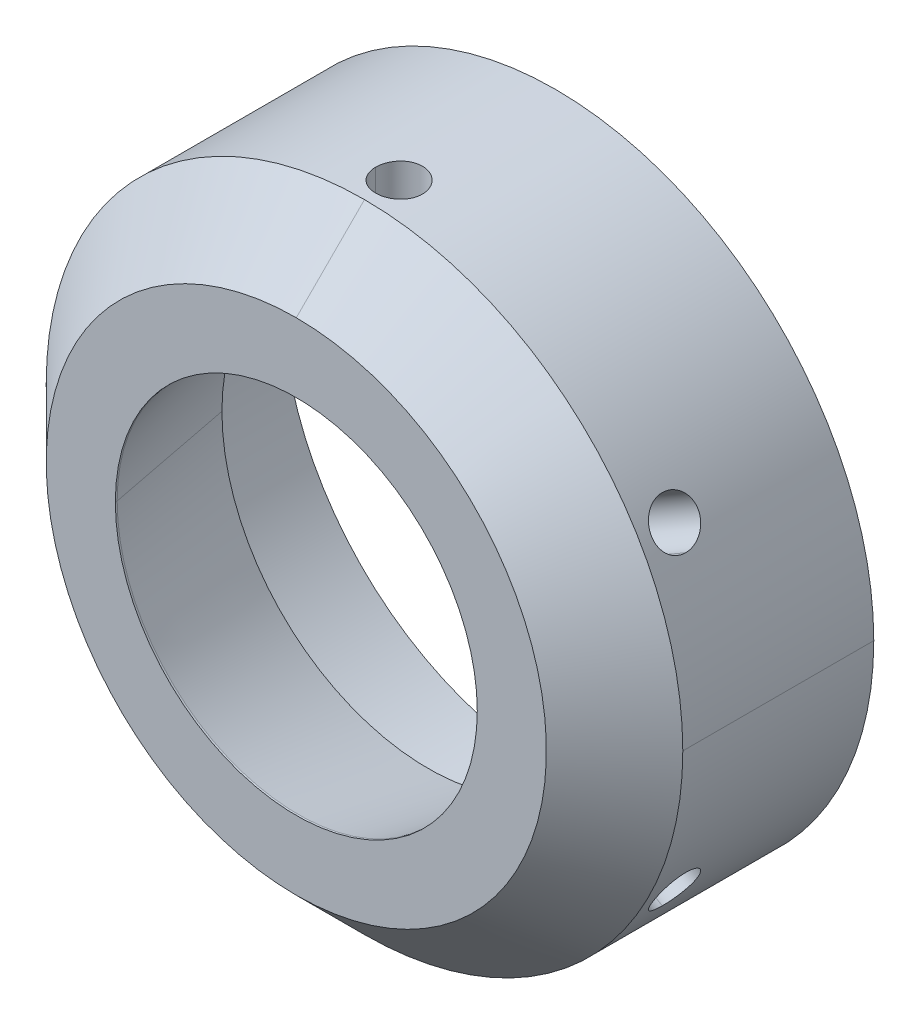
ISO-10303-21;
HEADER;
FILE_DESCRIPTION(('STEP AP214'),'2;1');
FILE_NAME('part.step','',(''),(''),'','','');
FILE_SCHEMA(('AUTOMOTIVE_DESIGN { 1 0 10303 214 1 1 1 1 }'));
ENDSEC;
DATA;
#1=APPLICATION_CONTEXT('core data for automotive mechanical design processes');
#2=APPLICATION_PROTOCOL_DEFINITION('international standard','automotive_design',2000,#1);
#3=PRODUCT_CONTEXT('',#1,'mechanical');
#4=PRODUCT('Part','Part','',(#3));
#5=PRODUCT_RELATED_PRODUCT_CATEGORY('part','',(#4));
#6=PRODUCT_DEFINITION_FORMATION('','',#4);
#7=PRODUCT_DEFINITION_CONTEXT('part definition',#1,'design');
#8=PRODUCT_DEFINITION('design','',#6,#7);
#9=PRODUCT_DEFINITION_SHAPE('','',#8);
#10=(LENGTH_UNIT() NAMED_UNIT(*) SI_UNIT(.MILLI.,.METRE.));
#11=(NAMED_UNIT(*) PLANE_ANGLE_UNIT() SI_UNIT($,.RADIAN.));
#12=(NAMED_UNIT(*) SI_UNIT($,.STERADIAN.) SOLID_ANGLE_UNIT());
#13=UNCERTAINTY_MEASURE_WITH_UNIT(LENGTH_MEASURE(1.E-05),#10,'distance_accuracy_value','');
#14=(GEOMETRIC_REPRESENTATION_CONTEXT(3) GLOBAL_UNCERTAINTY_ASSIGNED_CONTEXT((#13)) GLOBAL_UNIT_ASSIGNED_CONTEXT((#10,
#11,#12)) REPRESENTATION_CONTEXT('',''));
#15=CARTESIAN_POINT('',(0.,0.,0.));
#16=DIRECTION('',(0.,0.,1.));
#17=DIRECTION('',(1.,0.,0.));
#18=AXIS2_PLACEMENT_3D('',#15,#16,#17);
#19=CARTESIAN_POINT('',(0.,0.,36.195));
#20=DIRECTION('',(0.,0.,1.));
#21=DIRECTION('',(-1.,0.,0.));
#22=AXIS2_PLACEMENT_3D('',#19,#20,#21);
#23=CYLINDRICAL_SURFACE('',#22,44.45);
#24=CARTESIAN_POINT('',(0.,0.,0.));
#25=DIRECTION('',(0.,0.,1.));
#26=DIRECTION('',(-1.,0.,0.));
#27=AXIS2_PLACEMENT_3D('',#24,#25,#26);
#28=CIRCLE('',#27,44.45);
#29=CARTESIAN_POINT('',(-44.45,0.,0.));
#30=VERTEX_POINT('',#29);
#31=CARTESIAN_POINT('',(44.45,0.,0.));
#32=VERTEX_POINT('',#31);
#33=EDGE_CURVE('E9',#30,#32,#28,.T.);
#34=ORIENTED_EDGE('',*,*,#33,.T.);
#35=DIRECTION('',(0.,0.,1.));
#36=VECTOR('',#35,1.);
#37=CARTESIAN_POINT('',(44.45,0.,36.195));
#38=LINE('',#37,#36);
#39=CARTESIAN_POINT('',(44.45,0.,26.67));
#40=VERTEX_POINT('',#39);
#41=EDGE_CURVE('E27',#32,#40,#38,.T.);
#42=ORIENTED_EDGE('',*,*,#41,.T.);
#43=CARTESIAN_POINT('',(0.,0.,26.67));
#44=DIRECTION('',(0.,0.,-1.));
#45=DIRECTION('',(-1.,0.,0.));
#46=AXIS2_PLACEMENT_3D('',#43,#44,#45);
#47=CIRCLE('',#46,44.45);
#48=CARTESIAN_POINT('',(0.,-44.45,26.67));
#49=VERTEX_POINT('',#48);
#50=EDGE_CURVE('E702',#40,#49,#47,.T.);
#51=ORIENTED_EDGE('',*,*,#50,.T.);
#52=CARTESIAN_POINT('',(0.,0.,26.67));
#53=DIRECTION('',(0.,0.,-1.));
#54=DIRECTION('',(-1.,0.,0.));
#55=AXIS2_PLACEMENT_3D('',#52,#53,#54);
#56=CIRCLE('',#55,44.45);
#57=CARTESIAN_POINT('',(-44.45,0.,26.67));
#58=VERTEX_POINT('',#57);
#59=EDGE_CURVE('E455',#49,#58,#56,.T.);
#60=ORIENTED_EDGE('',*,*,#59,.T.);
#61=DIRECTION('',(0.,0.,1.));
#62=VECTOR('',#61,1.);
#63=CARTESIAN_POINT('',(-44.45,0.,36.195));
#64=LINE('',#63,#62);
#65=EDGE_CURVE('E400',#30,#58,#64,.T.);
#66=ORIENTED_EDGE('',*,*,#65,.F.);
#67=EDGE_LOOP('',(#34,#42,#51,#60,#66));
#68=FACE_BOUND('',#67,.T.);
#69=CARTESIAN_POINT('',(3.26390000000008,-44.3300062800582,21.844));
#70=CARTESIAN_POINT('',(3.26390446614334,-44.3300056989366,21.7905755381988));
#71=CARTESIAN_POINT('',(3.26260037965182,-44.3301019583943,21.7371503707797));
#72=CARTESIAN_POINT('',(3.25737658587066,-44.3304862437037,21.6305498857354));
#73=CARTESIAN_POINT('',(3.25346279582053,-44.3307738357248,21.5773742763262));
#74=CARTESIAN_POINT('',(3.24302026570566,-44.3315389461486,21.4712727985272));
#75=CARTESIAN_POINT('',(3.23649109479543,-44.3320164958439,21.4183469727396));
#76=CARTESIAN_POINT('',(3.22082630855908,-44.3331573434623,21.3127447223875));
#77=CARTESIAN_POINT('',(3.21168397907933,-44.3338211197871,21.2600693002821));
#78=CARTESIAN_POINT('',(3.19082489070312,-44.3353272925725,21.1551176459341));
#79=CARTESIAN_POINT('',(3.17910274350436,-44.3361700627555,21.1028424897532));
#80=CARTESIAN_POINT('',(3.15312180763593,-44.3380253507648,20.9990466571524));
#81=CARTESIAN_POINT('',(3.13886844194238,-44.3390375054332,20.9475246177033));
#82=CARTESIAN_POINT('',(3.10783154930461,-44.3412237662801,20.8452339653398));
#83=CARTESIAN_POINT('',(3.09104721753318,-44.342397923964,20.7944655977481));
#84=CARTESIAN_POINT('',(3.05495468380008,-44.344899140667,20.6936803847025));
#85=CARTESIAN_POINT('',(3.03563965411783,-44.3462266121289,20.6436659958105));
#86=CARTESIAN_POINT('',(2.99471740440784,-44.3490088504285,20.544940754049));
#87=CARTESIAN_POINT('',(2.97312469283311,-44.3504628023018,20.4962238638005));
#88=CARTESIAN_POINT('',(2.92762531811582,-44.3534894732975,20.4000142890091));
#89=CARTESIAN_POINT('',(2.90372372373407,-44.3550619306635,20.3525192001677));
#90=CARTESIAN_POINT('',(2.85361248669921,-44.3583140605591,20.2587508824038));
#91=CARTESIAN_POINT('',(2.8274022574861,-44.3599937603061,20.2124779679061));
#92=CARTESIAN_POINT('',(2.77267896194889,-44.3634478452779,20.1211511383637));
#93=CARTESIAN_POINT('',(2.74415995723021,-44.365222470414,20.0761007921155));
#94=CARTESIAN_POINT('',(2.68481847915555,-44.3688532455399,19.9872107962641));
#95=CARTESIAN_POINT('',(2.65398490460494,-44.3707097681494,19.9433785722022));
#96=CARTESIAN_POINT('',(2.59026618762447,-44.3744750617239,19.8573869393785));
#97=CARTESIAN_POINT('',(2.55738583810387,-44.3763837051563,19.8152239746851));
#98=CARTESIAN_POINT('',(2.48957867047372,-44.3802394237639,19.7325674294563));
#99=CARTESIAN_POINT('',(2.45465152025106,-44.3821865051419,19.6920741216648));
#100=CARTESIAN_POINT('',(2.38275557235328,-44.3861045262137,19.6127527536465));
#101=CARTESIAN_POINT('',(2.34578172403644,-44.3880755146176,19.5739292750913));
#102=CARTESIAN_POINT('',(2.27018796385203,-44.3920057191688,19.4983371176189));
#103=CARTESIAN_POINT('',(2.23157800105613,-44.393964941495,19.4615584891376));
#104=CARTESIAN_POINT('',(2.15268996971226,-44.3978601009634,19.3900228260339));
#105=CARTESIAN_POINT('',(2.11241597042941,-44.3997960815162,19.3552613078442));
#106=CARTESIAN_POINT('',(2.03020442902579,-44.40363119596,19.2877554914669));
#107=CARTESIAN_POINT('',(1.98826675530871,-44.4055303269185,19.2550113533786));
#108=CARTESIAN_POINT('',(1.90273199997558,-44.4092777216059,19.1915353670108));
#109=CARTESIAN_POINT('',(1.85913106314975,-44.4111258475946,19.1608087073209));
#110=CARTESIAN_POINT('',(1.77034252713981,-44.4147539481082,19.1014107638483));
#111=CARTESIAN_POINT('',(1.72515023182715,-44.4165336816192,19.0727464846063));
#112=CARTESIAN_POINT('',(1.63351562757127,-44.4199980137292,19.0177433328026));
#113=CARTESIAN_POINT('',(1.58707657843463,-44.4216828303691,18.9913990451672));
#114=CARTESIAN_POINT('',(1.49295246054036,-44.4249458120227,18.941030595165));
#115=CARTESIAN_POINT('',(1.44526737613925,-44.4265239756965,18.9170064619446));
#116=CARTESIAN_POINT('',(1.34865475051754,-44.4295619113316,18.8712725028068));
#117=CARTESIAN_POINT('',(1.2997244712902,-44.4310213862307,18.8495684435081));
#118=CARTESIAN_POINT('',(1.20087120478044,-44.4338030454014,18.8085730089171));
#119=CARTESIAN_POINT('',(1.15094842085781,-44.435125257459,18.7892811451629));
#120=CARTESIAN_POINT('',(1.05033094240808,-44.4376172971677,18.753222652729));
#121=CARTESIAN_POINT('',(0.9996384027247,-44.4387874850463,18.7364500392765));
#122=CARTESIAN_POINT('',(0.897484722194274,-44.4409679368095,18.7054240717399));
#123=CARTESIAN_POINT('',(0.846023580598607,-44.4419782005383,18.6911707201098));
#124=CARTESIAN_POINT('',(0.742335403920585,-44.4438312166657,18.665176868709));
#125=CARTESIAN_POINT('',(0.690106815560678,-44.4446735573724,18.653442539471));
#126=CARTESIAN_POINT('',(0.585302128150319,-44.4461771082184,18.6325652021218));
#127=CARTESIAN_POINT('',(0.532727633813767,-44.4468388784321,18.6234141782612));
#128=CARTESIAN_POINT('',(0.427314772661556,-44.4479771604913,18.6077239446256));
#129=CARTESIAN_POINT('',(0.374477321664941,-44.4484541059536,18.6011786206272));
#130=CARTESIAN_POINT('',(0.268540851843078,-44.4492203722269,18.5906933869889));
#131=CARTESIAN_POINT('',(0.215441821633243,-44.4495096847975,18.5867535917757));
#132=CARTESIAN_POINT('',(0.108983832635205,-44.4498983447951,18.5814728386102));
#133=CARTESIAN_POINT('',(0.0556245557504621,-44.4499972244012,18.5801382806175));
#134=CARTESIAN_POINT('',(-0.0513446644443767,-44.4500026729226,18.5800631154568));
#135=CARTESIAN_POINT('',(-0.104954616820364,-44.4499083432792,18.5813346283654));
#136=CARTESIAN_POINT('',(-0.211922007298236,-44.4495269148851,18.5865161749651));
#137=CARTESIAN_POINT('',(-0.265279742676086,-44.4492402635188,18.5904200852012));
#138=CARTESIAN_POINT('',(-0.371741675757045,-44.4484773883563,18.6008597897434));
#139=CARTESIAN_POINT('',(-0.424845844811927,-44.4480011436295,18.6073958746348));
#140=CARTESIAN_POINT('',(-0.530800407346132,-44.4468622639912,18.6230930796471));
#141=CARTESIAN_POINT('',(-0.583649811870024,-44.4461991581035,18.6322608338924));
#142=CARTESIAN_POINT('',(-0.68851262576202,-44.4446980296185,18.6531009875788));
#143=CARTESIAN_POINT('',(-0.740529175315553,-44.4438611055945,18.6647576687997));
#144=CARTESIAN_POINT('',(-0.843809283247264,-44.4420200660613,18.69057954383));
#145=CARTESIAN_POINT('',(-0.895074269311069,-44.4410163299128,18.7047390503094));
#146=CARTESIAN_POINT('',(-0.99685171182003,-44.4388498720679,18.7355600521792));
#147=CARTESIAN_POINT('',(-1.04736405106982,-44.4376871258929,18.7522219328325));
#148=CARTESIAN_POINT('',(-1.14763742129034,-44.4352107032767,18.7880412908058));
#149=CARTESIAN_POINT('',(-1.19739620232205,-44.4338966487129,18.8072050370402));
#150=CARTESIAN_POINT('',(-1.29616347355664,-44.4311254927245,18.848023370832));
#151=CARTESIAN_POINT('',(-1.34516708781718,-44.4296677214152,18.8696897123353));
#152=CARTESIAN_POINT('',(-1.44193312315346,-44.4266324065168,18.9153592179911));
#153=CARTESIAN_POINT('',(-1.48969811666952,-44.4250551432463,18.9393569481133));
#154=CARTESIAN_POINT('',(-1.58398902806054,-44.4217931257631,18.9896830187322));
#155=CARTESIAN_POINT('',(-1.63051476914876,-44.4201083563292,19.0160116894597));
#156=CARTESIAN_POINT('',(-1.72233011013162,-44.4166432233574,19.0709935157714));
#157=CARTESIAN_POINT('',(-1.76761623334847,-44.4148626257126,19.0996524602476));
#158=CARTESIAN_POINT('',(-1.85658116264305,-44.4112326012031,19.1590413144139));
#159=CARTESIAN_POINT('',(-1.90026496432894,-44.4093834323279,19.1897637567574));
#160=CARTESIAN_POINT('',(-1.98596857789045,-44.4056332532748,19.2532440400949));
#161=CARTESIAN_POINT('',(-2.02799202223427,-44.4037323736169,19.2859969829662));
#162=CARTESIAN_POINT('',(-2.11037856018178,-44.3998930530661,19.3535325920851));
#163=CARTESIAN_POINT('',(-2.15074152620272,-44.3979546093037,19.3883154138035));
#164=CARTESIAN_POINT('',(-2.2298114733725,-44.3940537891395,19.4599054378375));
#165=CARTESIAN_POINT('',(-2.26851409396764,-44.3920913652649,19.4967174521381));
#166=CARTESIAN_POINT('',(-2.34409499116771,-44.3881645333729,19.5721906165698));
#167=CARTESIAN_POINT('',(-2.38097272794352,-44.3862001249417,19.6108523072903));
#168=CARTESIAN_POINT('',(-2.45269628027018,-44.3822945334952,19.6898479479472));
#169=CARTESIAN_POINT('',(-2.48754678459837,-44.3803533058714,19.7301776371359));
#170=CARTESIAN_POINT('',(-2.55522084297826,-44.3765083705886,19.8125043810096));
#171=CARTESIAN_POINT('',(-2.58804441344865,-44.3746046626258,19.8545014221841));
#172=CARTESIAN_POINT('',(-2.65167024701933,-44.3708481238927,19.9401583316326));
#173=CARTESIAN_POINT('',(-2.68246746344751,-44.3689954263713,19.9838219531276));
#174=CARTESIAN_POINT('',(-2.74197847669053,-44.3653574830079,20.0727101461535));
#175=CARTESIAN_POINT('',(-2.77068679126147,-44.3635724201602,20.1179383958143));
#176=CARTESIAN_POINT('',(-2.82577240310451,-44.3600977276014,20.2096462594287));
#177=CARTESIAN_POINT('',(-2.85215522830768,-44.3584078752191,20.2561225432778));
#178=CARTESIAN_POINT('',(-2.90259582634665,-44.355135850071,20.3503224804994));
#179=CARTESIAN_POINT('',(-2.92665364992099,-44.3535536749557,20.3980461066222));
#180=CARTESIAN_POINT('',(-2.97245118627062,-44.3505080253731,20.494737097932));
#181=CARTESIAN_POINT('',(-2.9941851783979,-44.3490448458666,20.5437071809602));
#182=CARTESIAN_POINT('',(-3.03513466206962,-44.3462611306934,20.6423985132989));
#183=CARTESIAN_POINT('',(-3.05436250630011,-44.3449399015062,20.6921146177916));
#184=CARTESIAN_POINT('',(-3.0903137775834,-44.3424490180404,20.7923170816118));
#185=CARTESIAN_POINT('',(-3.10704295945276,-44.3412790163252,20.8428013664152));
#186=CARTESIAN_POINT('',(-3.13800368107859,-44.3390987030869,20.9445371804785));
#187=CARTESIAN_POINT('',(-3.15223505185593,-44.3380884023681,20.9957887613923));
#188=CARTESIAN_POINT('',(-3.17820731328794,-44.3362342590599,21.0990568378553));
#189=CARTESIAN_POINT('',(-3.18994194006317,-44.3353908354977,21.1510749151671));
#190=CARTESIAN_POINT('',(-3.21096819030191,-44.3338730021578,21.2560961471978));
#191=CARTESIAN_POINT('',(-3.22023668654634,-44.3332001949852,21.3091039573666));
#192=CARTESIAN_POINT('',(-3.23611693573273,-44.3320438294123,21.4153886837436));
#193=CARTESIAN_POINT('',(-3.24273500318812,-44.3315598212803,21.4686646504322));
#194=CARTESIAN_POINT('',(-3.25332036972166,-44.3307842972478,21.5754838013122));
#195=CARTESIAN_POINT('',(-3.25728750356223,-44.3304927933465,21.6290270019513));
#196=CARTESIAN_POINT('',(-3.26258301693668,-44.3301032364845,21.7363801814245));
#197=CARTESIAN_POINT('',(-3.26390470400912,-44.3300056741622,21.7901904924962));
#198=CARTESIAN_POINT('',(-3.2639,-44.3300062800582,21.844));
#199=B_SPLINE_CURVE_WITH_KNOTS('',3,(#69,#70,#71,#72,#73,#74,#75,#76,#77,#78,#79,#80,#81,#82,
#83,#84,#85,#86,#87,#88,#89,#90,#91,#92,#93,#94,#95,#96,#97,#98,#99,#100,#101,#102,#103,#104,
#105,#106,#107,#108,#109,#110,#111,#112,#113,#114,#115,#116,#117,#118,#119,#120,#121,#122,#123,
#124,#125,#126,#127,#128,#129,#130,#131,#132,#133,#134,#135,#136,#137,#138,#139,#140,#141,#142,
#143,#144,#145,#146,#147,#148,#149,#150,#151,#152,#153,#154,#155,#156,#157,#158,#159,#160,#161,
#162,#163,#164,#165,#166,#167,#168,#169,#170,#171,#172,#173,#174,#175,#176,#177,#178,#179,#180,
#181,#182,#183,#184,#185,#186,#187,#188,#189,#190,#191,#192,#193,#194,#195,#196,#197,#198),
.UNSPECIFIED.,.F.,.F.,(4,2,2,2,2,2,2,2,2,2,2,2,2,2,2,2,2,2,2,2,2,2,2,2,2,2,2,2,2,2,2,2,2,2,2,2,
2,2,2,2,2,2,2,2,2,2,2,2,2,2,2,2,2,2,2,2,2,2,2,2,2,2,2,2,4),(0.,0.160258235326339,
0.320154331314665,0.480076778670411,0.640413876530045,0.801089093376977,0.961424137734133,
1.12181027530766,1.28263839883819,1.44249773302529,1.60201377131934,1.7615704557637,
1.92155143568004,2.08235589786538,2.24279702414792,2.40326425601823,2.56414684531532,
2.72416207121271,2.88380680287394,3.04346418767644,3.20351728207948,3.36409055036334,
3.52427850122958,3.684468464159,3.84504775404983,4.00559447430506,4.16575355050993,
4.32591278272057,4.48645996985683,4.64650337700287,4.80616900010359,4.96584163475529,
5.12590602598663,5.28671651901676,5.44715422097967,5.60760963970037,5.76847315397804,
5.92834933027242,6.08786677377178,6.24740880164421,6.40735855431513,6.56809268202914,
6.72846076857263,6.88885161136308,7.0496538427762,7.2099026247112,7.36977884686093,
7.52966733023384,7.68995280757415,7.85028541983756,8.01023110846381,8.17017550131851,
8.33050423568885,8.49123960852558,8.65158196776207,8.81192082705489,8.97264572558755,
9.13254577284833,9.2920716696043,9.45160835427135,9.61154068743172,9.77292383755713,
9.93392017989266,10.094926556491,10.2563397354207),.UNSPECIFIED.);
#200=CARTESIAN_POINT('',(3.2639,-44.3300062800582,21.844));
#201=VERTEX_POINT('',#200);
#202=CARTESIAN_POINT('',(-3.2639,-44.3300062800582,21.844));
#203=VERTEX_POINT('',#202);
#204=EDGE_CURVE('E449',#201,#203,#199,.T.);
#205=ORIENTED_EDGE('',*,*,#204,.T.);
#206=CARTESIAN_POINT('',(-3.2639,-44.3300062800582,21.844));
#207=CARTESIAN_POINT('',(-3.26390446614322,-44.3300056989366,21.8974244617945));
#208=CARTESIAN_POINT('',(-3.26260037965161,-44.3301019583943,21.9508496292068));
#209=CARTESIAN_POINT('',(-3.2573765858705,-44.3304862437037,22.0574501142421));
#210=CARTESIAN_POINT('',(-3.25346279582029,-44.3307738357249,22.110625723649));
#211=CARTESIAN_POINT('',(-3.24302026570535,-44.3315389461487,22.2167272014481));
#212=CARTESIAN_POINT('',(-3.23649109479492,-44.332016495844,22.2696530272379));
#213=CARTESIAN_POINT('',(-3.22082630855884,-44.3331573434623,22.375255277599));
#214=CARTESIAN_POINT('',(-3.21168397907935,-44.3338211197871,22.4279306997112));
#215=CARTESIAN_POINT('',(-3.19082489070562,-44.3353272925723,22.5328823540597));
#216=CARTESIAN_POINT('',(-3.17910274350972,-44.3361700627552,22.5851575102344));
#217=CARTESIAN_POINT('',(-3.15312180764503,-44.3380253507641,22.688953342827));
#218=CARTESIAN_POINT('',(-3.13886844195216,-44.3390375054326,22.7404753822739));
#219=CARTESIAN_POINT('',(-3.10783154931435,-44.3412237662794,22.8427660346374));
#220=CARTESIAN_POINT('',(-3.09104721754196,-44.3423979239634,22.8935344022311));
#221=CARTESIAN_POINT('',(-3.05495468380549,-44.3448991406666,22.9943196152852));
#222=CARTESIAN_POINT('',(-3.03563965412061,-44.3462266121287,23.0443340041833));
#223=CARTESIAN_POINT('',(-2.99471740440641,-44.3490088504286,23.1430592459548));
#224=CARTESIAN_POINT('',(-2.97312469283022,-44.3504628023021,23.1917761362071));
#225=CARTESIAN_POINT('',(-2.92762531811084,-44.3534894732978,23.2879857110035));
#226=CARTESIAN_POINT('',(-2.90372372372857,-44.3550619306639,23.3354807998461));
#227=CARTESIAN_POINT('',(-2.85361248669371,-44.3583140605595,23.4292491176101));
#228=CARTESIAN_POINT('',(-2.82740225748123,-44.3599937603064,23.4755220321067));
#229=CARTESIAN_POINT('',(-2.77267896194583,-44.3634478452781,23.566848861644));
#230=CARTESIAN_POINT('',(-2.74415995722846,-44.3652224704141,23.6118992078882));
#231=CARTESIAN_POINT('',(-2.68481847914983,-44.3688532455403,23.7007892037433));
#232=CARTESIAN_POINT('',(-2.65398490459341,-44.3707097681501,23.7446214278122));
#233=CARTESIAN_POINT('',(-2.59026618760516,-44.374475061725,23.8306130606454));
#234=CARTESIAN_POINT('',(-2.55738583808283,-44.3763837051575,23.8727760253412));
#235=CARTESIAN_POINT('',(-2.48957867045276,-44.3802394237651,23.9554325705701));
#236=CARTESIAN_POINT('',(-2.45465152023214,-44.3821865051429,23.9959258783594));
#237=CARTESIAN_POINT('',(-2.38275557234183,-44.3861045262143,24.075247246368));
#238=CARTESIAN_POINT('',(-2.34578172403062,-44.3880755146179,24.1140707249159));
#239=CARTESIAN_POINT('',(-2.27018796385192,-44.3920057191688,24.1896628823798));
#240=CARTESIAN_POINT('',(-2.23157800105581,-44.393964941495,24.2264415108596));
#241=CARTESIAN_POINT('',(-2.1526899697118,-44.3978601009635,24.2979771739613));
#242=CARTESIAN_POINT('',(-2.11241597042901,-44.3997960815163,24.3327386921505));
#243=CARTESIAN_POINT('',(-2.03020442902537,-44.40363119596,24.4002445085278));
#244=CARTESIAN_POINT('',(-1.98826675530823,-44.4055303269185,24.4329886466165));
#245=CARTESIAN_POINT('',(-1.90273199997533,-44.4092777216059,24.4964646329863));
#246=CARTESIAN_POINT('',(-1.85913106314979,-44.4111258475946,24.527191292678));
#247=CARTESIAN_POINT('',(-1.77034252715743,-44.4147539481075,24.5865892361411));
#248=CARTESIAN_POINT('',(-1.72515023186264,-44.4165336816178,24.6152535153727));
#249=CARTESIAN_POINT('',(-1.63351562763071,-44.419998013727,24.6702566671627));
#250=CARTESIAN_POINT('',(-1.58707657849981,-44.4216828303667,24.6966009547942));
#251=CARTESIAN_POINT('',(-1.49295246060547,-44.4249458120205,24.7469694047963));
#252=CARTESIAN_POINT('',(-1.44526737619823,-44.4265239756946,24.7709935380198));
#253=CARTESIAN_POINT('',(-1.34865475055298,-44.4295619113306,24.8167274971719));
#254=CARTESIAN_POINT('',(-1.29972447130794,-44.4310213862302,24.8384315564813));
#255=CARTESIAN_POINT('',(-1.20087120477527,-44.4338030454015,24.8794269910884));
#256=CARTESIAN_POINT('',(-1.1509484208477,-44.4351252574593,24.8987188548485));
#257=CARTESIAN_POINT('',(-1.05033094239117,-44.4376172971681,24.9347773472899));
#258=CARTESIAN_POINT('',(-0.999638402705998,-44.4387874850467,24.951549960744));
#259=CARTESIAN_POINT('',(-0.897484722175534,-44.4409679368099,24.9825759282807));
#260=CARTESIAN_POINT('',(-0.846023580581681,-44.4419782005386,24.9968292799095));
#261=CARTESIAN_POINT('',(-0.742335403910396,-44.4438312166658,25.0228231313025));
#262=CARTESIAN_POINT('',(-0.690106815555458,-44.4446735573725,25.0345574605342));
#263=CARTESIAN_POINT('',(-0.585302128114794,-44.4461771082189,25.0554347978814));
#264=CARTESIAN_POINT('',(-0.532727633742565,-44.446838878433,25.0645858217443));
#265=CARTESIAN_POINT('',(-0.427314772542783,-44.4479771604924,25.0802760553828));
#266=CARTESIAN_POINT('',(-0.374477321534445,-44.4484541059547,25.086821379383));
#267=CARTESIAN_POINT('',(-0.268540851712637,-44.4492203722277,25.0973066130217));
#268=CARTESIAN_POINT('',(-0.215441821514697,-44.4495096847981,25.1012464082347));
#269=CARTESIAN_POINT('',(-0.108983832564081,-44.4498983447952,25.1065271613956));
#270=CARTESIAN_POINT('',(-0.0556245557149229,-44.4499972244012,25.1078617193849));
#271=CARTESIAN_POINT('',(0.051344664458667,-44.4500026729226,25.107936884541));
#272=CARTESIAN_POINT('',(0.104954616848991,-44.4499083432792,25.1066653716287));
#273=CARTESIAN_POINT('',(0.211922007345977,-44.4495269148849,25.1014838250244));
#274=CARTESIAN_POINT('',(0.265279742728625,-44.4492402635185,25.0975799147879));
#275=CARTESIAN_POINT('',(0.371741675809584,-44.4484773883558,25.0871402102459));
#276=CARTESIAN_POINT('',(0.424845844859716,-44.448001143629,25.0806041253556));
#277=CARTESIAN_POINT('',(0.530800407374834,-44.4468622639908,25.0649069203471));
#278=CARTESIAN_POINT('',(0.583649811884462,-44.4461991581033,25.0557391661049));
#279=CARTESIAN_POINT('',(0.6885126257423,-44.4446980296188,25.0348990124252));
#280=CARTESIAN_POINT('',(0.740529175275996,-44.4438611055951,25.0232423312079));
#281=CARTESIAN_POINT('',(0.84380928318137,-44.4420200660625,24.997420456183));
#282=CARTESIAN_POINT('',(0.895074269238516,-44.4410163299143,24.9832609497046));
#283=CARTESIAN_POINT('',(0.996851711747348,-44.4388498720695,24.9524399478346));
#284=CARTESIAN_POINT('',(1.04736405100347,-44.4376871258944,24.9357780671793));
#285=CARTESIAN_POINT('',(1.14763742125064,-44.4352107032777,24.8999587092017));
#286=CARTESIAN_POINT('',(1.19739620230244,-44.4338966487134,24.8807949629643));
#287=CARTESIAN_POINT('',(1.29616347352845,-44.4311254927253,24.8399766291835));
#288=CARTESIAN_POINT('',(1.34516708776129,-44.4296677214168,24.8183102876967));
#289=CARTESIAN_POINT('',(1.44193312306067,-44.4266324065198,24.772640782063));
#290=CARTESIAN_POINT('',(1.48969811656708,-44.4250551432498,24.7486430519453));
#291=CARTESIAN_POINT('',(1.58398902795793,-44.4217931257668,24.698316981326));
#292=CARTESIAN_POINT('',(1.63051476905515,-44.4201083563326,24.6719883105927));
#293=CARTESIAN_POINT('',(1.72233011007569,-44.4166432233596,24.6170064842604));
#294=CARTESIAN_POINT('',(1.76761623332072,-44.4148626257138,24.5883475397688));
#295=CARTESIAN_POINT('',(1.8565811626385,-44.4112326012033,24.5289586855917));
#296=CARTESIAN_POINT('',(1.90026496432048,-44.4093834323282,24.4982362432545));
#297=CARTESIAN_POINT('',(1.98596857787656,-44.4056332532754,24.4347559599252));
#298=CARTESIAN_POINT('',(2.02799202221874,-44.4037323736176,24.4020030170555));
#299=CARTESIAN_POINT('',(2.11037856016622,-44.3998930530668,24.3344674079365));
#300=CARTESIAN_POINT('',(2.15074152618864,-44.3979546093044,24.2996845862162));
#301=CARTESIAN_POINT('',(2.22981147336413,-44.3940537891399,24.2280945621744));
#302=CARTESIAN_POINT('',(2.26851409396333,-44.3920913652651,24.1912825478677));
#303=CARTESIAN_POINT('',(2.34409499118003,-44.3881645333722,24.1158093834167));
#304=CARTESIAN_POINT('',(2.38097272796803,-44.3862001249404,24.0771476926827));
#305=CARTESIAN_POINT('',(2.45269628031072,-44.382294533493,23.9981520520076));
#306=CARTESIAN_POINT('',(2.48754678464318,-44.3803533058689,23.9578223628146));
#307=CARTESIAN_POINT('',(2.55522084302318,-44.376508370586,23.875495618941));
#308=CARTESIAN_POINT('',(2.58804441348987,-44.3746046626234,23.8334985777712));
#309=CARTESIAN_POINT('',(2.65167024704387,-44.3708481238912,23.7478416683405));
#310=CARTESIAN_POINT('',(2.68246746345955,-44.3689954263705,23.7041780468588));
#311=CARTESIAN_POINT('',(2.74197847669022,-44.365357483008,23.6152898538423));
#312=CARTESIAN_POINT('',(2.77068679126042,-44.3635724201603,23.5700616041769));
#313=CARTESIAN_POINT('',(2.82577240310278,-44.3600977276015,23.4783537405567));
#314=CARTESIAN_POINT('',(2.85215522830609,-44.3584078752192,23.4318774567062));
#315=CARTESIAN_POINT('',(2.90259582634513,-44.3551358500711,23.3376775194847));
#316=CARTESIAN_POINT('',(2.92665364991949,-44.3535536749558,23.2899538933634));
#317=CARTESIAN_POINT('',(2.97245118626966,-44.3505080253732,23.1932629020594));
#318=CARTESIAN_POINT('',(2.99418517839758,-44.3490448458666,23.1442928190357));
#319=CARTESIAN_POINT('',(3.03513466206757,-44.3462611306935,23.0456014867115));
#320=CARTESIAN_POINT('',(3.05436250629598,-44.3449399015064,22.995885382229));
#321=CARTESIAN_POINT('',(3.09031377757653,-44.3424490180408,22.8956829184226));
#322=CARTESIAN_POINT('',(3.10704295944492,-44.3412790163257,22.8451986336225));
#323=CARTESIAN_POINT('',(3.13800368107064,-44.3390987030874,22.7434628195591));
#324=CARTESIAN_POINT('',(3.15223505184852,-44.3380884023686,22.6922112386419));
#325=CARTESIAN_POINT('',(3.17820731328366,-44.3362342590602,22.5889431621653));
#326=CARTESIAN_POINT('',(3.18994194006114,-44.3353908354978,22.5369250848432));
#327=CARTESIAN_POINT('',(3.21096819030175,-44.3338730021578,22.4319038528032));
#328=CARTESIAN_POINT('',(3.22023668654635,-44.3332001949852,22.3788960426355));
#329=CARTESIAN_POINT('',(3.23611693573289,-44.3320438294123,22.2726113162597));
#330=CARTESIAN_POINT('',(3.24273500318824,-44.3315598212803,22.2193353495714));
#331=CARTESIAN_POINT('',(3.25332036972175,-44.3307842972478,22.1125161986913));
#332=CARTESIAN_POINT('',(3.25728750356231,-44.3304927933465,22.0589729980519));
#333=CARTESIAN_POINT('',(3.26258301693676,-44.3301032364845,21.9516198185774));
#334=CARTESIAN_POINT('',(3.2639047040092,-44.3300056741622,21.8978095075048));
#335=CARTESIAN_POINT('',(3.26390000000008,-44.3300062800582,21.844));
#336=B_SPLINE_CURVE_WITH_KNOTS('',3,(#206,#207,#208,#209,#210,#211,#212,#213,#214,#215,#216,
#217,#218,#219,#220,#221,#222,#223,#224,#225,#226,#227,#228,#229,#230,#231,#232,#233,#234,#235,
#236,#237,#238,#239,#240,#241,#242,#243,#244,#245,#246,#247,#248,#249,#250,#251,#252,#253,#254,
#255,#256,#257,#258,#259,#260,#261,#262,#263,#264,#265,#266,#267,#268,#269,#270,#271,#272,#273,
#274,#275,#276,#277,#278,#279,#280,#281,#282,#283,#284,#285,#286,#287,#288,#289,#290,#291,#292,
#293,#294,#295,#296,#297,#298,#299,#300,#301,#302,#303,#304,#305,#306,#307,#308,#309,#310,#311,
#312,#313,#314,#315,#316,#317,#318,#319,#320,#321,#322,#323,#324,#325,#326,#327,#328,#329,#330,
#331,#332,#333,#334,#335),.UNSPECIFIED.,.F.,.F.,(4,2,2,2,2,2,2,2,2,2,2,2,2,2,2,2,2,2,2,2,2,2,2,
2,2,2,2,2,2,2,2,2,2,2,2,2,2,2,2,2,2,2,2,2,2,2,2,2,2,2,2,2,2,2,2,2,2,2,2,2,2,2,2,2,4),(0.,
0.160258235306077,0.320154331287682,0.480076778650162,0.640413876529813,0.801089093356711,
0.961424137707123,1.12181027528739,1.28263839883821,1.44249773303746,1.60201377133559,
1.76157045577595,1.92155143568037,2.08235589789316,2.24279702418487,2.40326425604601,
2.56414684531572,2.7241620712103,2.88380680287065,3.04346418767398,3.20351728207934,
3.36409055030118,3.52427850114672,3.6844684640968,3.8450477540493,4.00559447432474,
4.16575355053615,4.32591278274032,4.4864599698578,4.64650337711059,4.806169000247,
4.96584163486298,5.12590602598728,5.28671651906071,5.44715422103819,5.60760963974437,
5.76847315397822,5.92834933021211,6.08786677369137,6.24740880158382,6.40735855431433,
6.56809268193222,6.72846076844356,6.8888516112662,7.04965384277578,7.20990262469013,
7.36977884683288,7.52966733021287,7.68995280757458,7.85028541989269,8.01023110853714,
8.1701755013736,8.33050423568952,8.4912396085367,8.65158196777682,8.81192082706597,
8.97264572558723,9.132545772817,9.29207166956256,9.45160835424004,9.61154068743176,
9.77292383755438,9.933920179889,10.0949265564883,10.256339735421),.UNSPECIFIED.);
#337=EDGE_CURVE('E365',#203,#201,#336,.T.);
#338=ORIENTED_EDGE('',*,*,#337,.T.);
#339=EDGE_LOOP('',(#205,#338));
#340=FACE_BOUND('',#339,.T.);
#341=CARTESIAN_POINT('',(40.0228615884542,-19.3383828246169,21.844));
#342=CARTESIAN_POINT('',(40.0228633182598,-19.3383786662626,21.7905755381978));
#343=CARTESIAN_POINT('',(40.0222946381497,-19.3395561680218,21.7371503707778));
#344=CARTESIAN_POINT('',(40.0200155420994,-19.3442722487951,21.6305498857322));
#345=CARTESIAN_POINT('',(40.0183077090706,-19.3478054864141,21.5773742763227));
#346=CARTESIAN_POINT('',(40.0137490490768,-19.3572315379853,21.4712727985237));
#347=CARTESIAN_POINT('',(40.0108980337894,-19.3631247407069,21.4183469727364));
#348=CARTESIAN_POINT('',(40.0040536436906,-19.3772612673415,21.3127447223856));
#349=CARTESIAN_POINT('',(40.0000573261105,-19.385510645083,21.2600693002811));
#350=CARTESIAN_POINT('',(39.9909321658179,-19.4043282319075,21.1551176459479));
#351=CARTESIAN_POINT('',(39.9858009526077,-19.4149012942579,21.1028424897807));
#352=CARTESIAN_POINT('',(39.9744172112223,-19.4383290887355,20.9990466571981));
#353=CARTESIAN_POINT('',(39.9681670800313,-19.4511789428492,20.9475246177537));
#354=CARTESIAN_POINT('',(39.954541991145,-19.4791508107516,20.8452339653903));
#355=CARTESIAN_POINT('',(39.9471666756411,-19.4942735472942,20.7944655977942));
#356=CARTESIAN_POINT('',(39.9312865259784,-19.5267812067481,20.6936803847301));
#357=CARTESIAN_POINT('',(39.9227786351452,-19.5441722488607,20.6436659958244));
#358=CARTESIAN_POINT('',(39.9047269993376,-19.5810030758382,20.5449407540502));
#359=CARTESIAN_POINT('',(39.8951898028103,-19.6004298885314,20.4962238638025));
#360=CARTESIAN_POINT('',(39.8750612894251,-19.641346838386,20.4000142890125));
#361=CARTESIAN_POINT('',(39.86447228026,-19.6628324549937,20.3525192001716));
#362=CARTESIAN_POINT('',(39.8422330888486,-19.7078561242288,20.2587508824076));
#363=CARTESIAN_POINT('',(39.8305826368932,-19.7313946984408,20.2124779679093));
#364=CARTESIAN_POINT('',(39.8062123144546,-19.7805135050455,20.1211511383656));
#365=CARTESIAN_POINT('',(39.7934896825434,-19.8060990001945,20.0761007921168));
#366=CARTESIAN_POINT('',(39.7669632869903,-19.8593056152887,19.9872107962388));
#367=CARTESIAN_POINT('',(39.7531542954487,-19.8869365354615,19.943378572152));
#368=CARTESIAN_POINT('',(39.7245557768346,-19.9440012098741,19.8573869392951));
#369=CARTESIAN_POINT('',(39.7097685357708,-19.9734307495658,19.8152239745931));
#370=CARTESIAN_POINT('',(39.6792041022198,-20.0340813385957,19.732567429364));
#371=CARTESIAN_POINT('',(39.6634267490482,-20.065302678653,19.6920741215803));
#372=CARTESIAN_POINT('',(39.6308718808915,-20.1295254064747,19.612752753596));
#373=CARTESIAN_POINT('',(39.61409188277,-20.1625311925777,19.5739292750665));
#374=CARTESIAN_POINT('',(39.5796986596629,-20.2299624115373,19.4983371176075));
#375=CARTESIAN_POINT('',(39.5620904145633,-20.2643792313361,19.4615584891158));
#376=CARTESIAN_POINT('',(39.5260197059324,-20.3346458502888,19.3900228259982));
#377=CARTESIAN_POINT('',(39.5075593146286,-20.3704921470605,19.3552613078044));
#378=CARTESIAN_POINT('',(39.4697748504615,-20.443606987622,19.2877554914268));
#379=CARTESIAN_POINT('',(39.4504507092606,-20.4808756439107,19.255011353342));
#380=CARTESIAN_POINT('',(39.4109286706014,-20.55682461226,19.1915353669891));
#381=CARTESIAN_POINT('',(39.3907287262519,-20.5955081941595,19.1608087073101));
#382=CARTESIAN_POINT('',(39.34947648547,-20.674215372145,19.1014107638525));
#383=CARTESIAN_POINT('',(39.3284216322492,-20.7142429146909,19.0727464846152));
#384=CARTESIAN_POINT('',(39.2856045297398,-20.7953329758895,19.0177433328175));
#385=CARTESIAN_POINT('',(39.2638440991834,-20.8363927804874,18.9913990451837));
#386=CARTESIAN_POINT('',(39.2196078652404,-20.9195381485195,18.9410305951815));
#387=CARTESIAN_POINT('',(39.1971320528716,-20.9616237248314,18.9170064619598));
#388=CARTESIAN_POINT('',(39.1514566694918,-21.0468116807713,18.8712725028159));
#389=CARTESIAN_POINT('',(39.1282554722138,-21.0899162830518,18.8495684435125));
#390=CARTESIAN_POINT('',(39.081237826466,-21.1769165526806,18.8085730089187));
#391=CARTESIAN_POINT('',(39.0574215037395,-21.2208120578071,18.7892811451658));
#392=CARTESIAN_POINT('',(39.0092709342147,-21.3091953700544,18.7532226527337));
#393=CARTESIAN_POINT('',(38.9849380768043,-21.3536814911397,18.7364500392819));
#394=CARTESIAN_POINT('',(38.9357495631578,-21.4432393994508,18.7054240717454));
#395=CARTESIAN_POINT('',(38.9108939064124,-21.4883111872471,18.6911707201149));
#396=CARTESIAN_POINT('',(38.8606545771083,-21.5790342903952,18.665176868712));
#397=CARTESIAN_POINT('',(38.8352697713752,-21.6246867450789,18.6534425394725));
#398=CARTESIAN_POINT('',(38.7841695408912,-21.7162020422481,18.6325652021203));
#399=CARTESIAN_POINT('',(38.758455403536,-21.7620637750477,18.6234141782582));
#400=CARTESIAN_POINT('',(38.7067347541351,-21.8539231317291,18.6077239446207));
#401=CARTESIAN_POINT('',(38.6807290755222,-21.8999201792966,18.6011786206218));
#402=CARTESIAN_POINT('',(38.6284244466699,-21.9920469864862,18.5906933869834));
#403=CARTESIAN_POINT('',(38.6021254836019,-22.0381767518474,18.5867535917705));
#404=CARTESIAN_POINT('',(38.5492330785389,-22.130566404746,18.5814728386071));
#405=CARTESIAN_POINT('',(38.5226390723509,-22.1768263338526,18.580138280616));
#406=CARTESIAN_POINT('',(38.469159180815,-22.2694671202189,18.5800631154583));
#407=CARTESIAN_POINT('',(38.4422725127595,-22.3158475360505,18.5813346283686));
#408=CARTESIAN_POINT('',(38.3884584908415,-22.4082932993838,18.5865161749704));
#409=CARTESIAN_POINT('',(38.3615313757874,-22.4543591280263,18.5904200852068));
#410=CARTESIAN_POINT('',(38.3076397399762,-22.5461764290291,18.6008597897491));
#411=CARTESIAN_POINT('',(38.280675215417,-22.591927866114,18.6073958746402));
#412=CARTESIAN_POINT('',(38.2267116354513,-22.6831177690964,18.6230930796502));
#413=CARTESIAN_POINT('',(38.1997126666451,-22.7285551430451,18.6322608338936));
#414=CARTESIAN_POINT('',(38.1459812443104,-22.8186184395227,18.6531009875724));
#415=CARTESIAN_POINT('',(38.1192481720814,-22.8632476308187,18.6647576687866));
#416=CARTESIAN_POINT('',(38.0660137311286,-22.9517703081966,18.6905795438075));
#417=CARTESIAN_POINT('',(38.0395119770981,-22.9956652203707,18.7047390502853));
#418=CARTESIAN_POINT('',(37.986747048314,-23.0827238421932,18.7355600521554));
#419=CARTESIAN_POINT('',(37.960483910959,-23.1258874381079,18.7522219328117));
#420=CARTESIAN_POINT('',(37.9082025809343,-23.2114885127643,18.7880412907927));
#421=CARTESIAN_POINT('',(37.8821851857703,-23.25392385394,18.8072050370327));
#422=CARTESIAN_POINT('',(37.830401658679,-23.3380732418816,18.8480233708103));
#423=CARTESIAN_POINT('',(37.8046373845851,-23.3797827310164,18.8696897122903));
#424=CARTESIAN_POINT('',(37.7536257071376,-23.4620669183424,18.9153592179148));
#425=CARTESIAN_POINT('',(37.728377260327,-23.5026439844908,18.9393569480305));
#426=CARTESIAN_POINT('',(37.678406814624,-23.5826713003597,18.9896830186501));
#427=CARTESIAN_POINT('',(37.6536848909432,-23.6221213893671,19.016011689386));
#428=CARTESIAN_POINT('',(37.6047763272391,-23.6999032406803,19.0709935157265));
#429=CARTESIAN_POINT('',(37.5805912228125,-23.7382318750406,19.0996524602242));
#430=CARTESIAN_POINT('',(37.5329650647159,-23.8134627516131,19.1590413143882));
#431=CARTESIAN_POINT('',(37.5095217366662,-23.8503694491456,19.1897637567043));
#432=CARTESIAN_POINT('',(37.4634221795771,-23.9227158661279,19.2532440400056));
#433=CARTESIAN_POINT('',(37.4407642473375,-23.9581587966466,19.2859969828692));
#434=CARTESIAN_POINT('',(37.3962460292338,-24.0275879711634,19.3535325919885));
#435=CARTESIAN_POINT('',(37.3743858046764,-24.0615741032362,19.3883154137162));
#436=CARTESIAN_POINT('',(37.3314726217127,-24.1281002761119,19.4599054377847));
#437=CARTESIAN_POINT('',(37.3104218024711,-24.1606365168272,19.4967174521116));
#438=CARTESIAN_POINT('',(37.2692306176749,-24.2241280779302,19.5721906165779));
#439=CARTESIAN_POINT('',(37.249090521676,-24.2550829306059,19.6108523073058));
#440=CARTESIAN_POINT('',(37.2098464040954,-24.3152445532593,19.689847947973));
#441=CARTESIAN_POINT('',(37.1907399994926,-24.3444553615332,19.7301776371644));
#442=CARTESIAN_POINT('',(37.1535731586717,-24.401140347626,19.8125043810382));
#443=CARTESIAN_POINT('',(37.135512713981,-24.4286145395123,19.8545014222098));
#444=CARTESIAN_POINT('',(37.1004465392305,-24.4818378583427,19.9401583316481));
#445=CARTESIAN_POINT('',(37.0834434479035,-24.5075826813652,19.9838219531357));
#446=CARTESIAN_POINT('',(37.0505373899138,-24.5573017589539,20.0727101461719));
#447=CARTESIAN_POINT('',(37.0346373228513,-24.5812713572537,20.1179383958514));
#448=CARTESIAN_POINT('',(37.0040853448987,-24.6272395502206,20.2096462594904));
#449=CARTESIAN_POINT('',(36.9894304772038,-24.6492428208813,20.2561225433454));
#450=CARTESIAN_POINT('',(36.9613765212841,-24.6912896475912,20.3503224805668));
#451=CARTESIAN_POINT('',(36.947977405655,-24.711333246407,20.3980461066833));
#452=CARTESIAN_POINT('',(36.922441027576,-24.7494722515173,20.4947370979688));
#453=CARTESIAN_POINT('',(36.9103068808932,-24.7675628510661,20.5437071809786));
#454=CARTESIAN_POINT('',(36.887421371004,-24.8016342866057,20.6423985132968));
#455=CARTESIAN_POINT('',(36.8766632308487,-24.8176254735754,20.6921146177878));
#456=CARTESIAN_POINT('',(36.856530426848,-24.8475147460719,20.7923170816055));
#457=CARTESIAN_POINT('',(36.8471525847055,-24.8614176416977,20.8428013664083));
#458=CARTESIAN_POINT('',(36.82978401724,-24.887140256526,20.9445371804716));
#459=CARTESIAN_POINT('',(36.8217933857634,-24.8989598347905,20.9957887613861));
#460=CARTESIAN_POINT('',(36.8072015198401,-24.9205254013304,21.0990568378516));
#461=CARTESIAN_POINT('',(36.8006037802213,-24.9302661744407,21.1510749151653));
#462=CARTESIAN_POINT('',(36.7887761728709,-24.9477165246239,21.2560961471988));
#463=CARTESIAN_POINT('',(36.7835592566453,-24.9554068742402,21.3091039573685));
#464=CARTESIAN_POINT('',(36.77461769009,-24.9685813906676,21.4153886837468));
#465=CARTESIAN_POINT('',(36.7708894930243,-24.974070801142,21.4686646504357));
#466=CARTESIAN_POINT('',(36.7649251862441,-24.9828502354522,21.5754838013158));
#467=CARTESIAN_POINT('',(36.76268916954,-24.9861401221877,21.6290270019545));
#468=CARTESIAN_POINT('',(36.7597040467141,-24.990531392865,21.7363801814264));
#469=CARTESIAN_POINT('',(36.7589587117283,-24.9916272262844,21.7901904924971));
#470=CARTESIAN_POINT('',(36.7589615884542,-24.9916234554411,21.844));
#471=B_SPLINE_CURVE_WITH_KNOTS('',3,(#341,#342,#343,#344,#345,#346,#347,#348,#349,#350,#351,
#352,#353,#354,#355,#356,#357,#358,#359,#360,#361,#362,#363,#364,#365,#366,#367,#368,#369,#370,
#371,#372,#373,#374,#375,#376,#377,#378,#379,#380,#381,#382,#383,#384,#385,#386,#387,#388,#389,
#390,#391,#392,#393,#394,#395,#396,#397,#398,#399,#400,#401,#402,#403,#404,#405,#406,#407,#408,
#409,#410,#411,#412,#413,#414,#415,#416,#417,#418,#419,#420,#421,#422,#423,#424,#425,#426,#427,
#428,#429,#430,#431,#432,#433,#434,#435,#436,#437,#438,#439,#440,#441,#442,#443,#444,#445,#446,
#447,#448,#449,#450,#451,#452,#453,#454,#455,#456,#457,#458,#459,#460,#461,#462,#463,#464,#465,
#466,#467,#468,#469,#470),.UNSPECIFIED.,.F.,.F.,(4,2,2,2,2,2,2,2,2,2,2,2,2,2,2,2,2,2,2,2,2,2,2,
2,2,2,2,2,2,2,2,2,2,2,2,2,2,2,2,2,2,2,2,2,2,2,2,2,2,2,2,2,2,2,2,2,2,2,2,2,2,2,2,2,4),(0.,
0.160258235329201,0.320154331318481,0.480076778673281,0.640413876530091,0.801089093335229,
0.961424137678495,1.12181027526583,1.28263839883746,1.44249773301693,1.60201377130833,
1.76157045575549,1.92155143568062,2.08235589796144,2.24279702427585,2.40326425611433,
2.56414684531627,2.72416207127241,2.88380680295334,3.04346418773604,3.20351728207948,
3.36409055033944,3.5242785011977,3.68446846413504,3.84504775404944,4.00559447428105,
4.16575355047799,4.32591278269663,4.48645996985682,4.64650337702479,4.8061690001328,
4.96584163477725,5.12590602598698,5.2867165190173,5.44715422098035,5.60760963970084,
5.76847315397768,5.92834933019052,6.08786677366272,6.24740880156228,6.40735855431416,
6.5680926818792,6.72846076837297,6.88885161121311,7.04965384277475,7.20990262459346,
7.36977884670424,7.52966733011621,7.6899528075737,7.85028541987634,8.01023110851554,
8.17017550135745,8.33050423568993,8.49123960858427,8.65158196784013,8.81192082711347,
8.97264572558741,9.13254577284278,9.29207166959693,9.45160835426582,9.61154068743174,
9.77292383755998,9.93392017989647,10.0949265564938,10.2563397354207),.UNSPECIFIED.);
#472=CARTESIAN_POINT('',(40.0228615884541,-19.338382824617,21.844));
#473=VERTEX_POINT('',#472);
#474=CARTESIAN_POINT('',(36.7589615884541,-24.9916234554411,21.844));
#475=VERTEX_POINT('',#474);
#476=EDGE_CURVE('E358',#473,#475,#471,.T.);
#477=ORIENTED_EDGE('',*,*,#476,.T.);
#478=CARTESIAN_POINT('',(36.7589615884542,-24.9916234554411,21.844));
#479=CARTESIAN_POINT('',(36.7589588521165,-24.9916270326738,21.8974244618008));
#480=CARTESIAN_POINT('',(36.7596942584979,-24.9905457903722,21.9508496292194));
#481=CARTESIAN_POINT('',(36.7626389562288,-24.9862139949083,22.0574501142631));
#482=CARTESIAN_POINT('',(36.7648449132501,-24.9829683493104,22.1106257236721));
#483=CARTESIAN_POINT('',(36.7707287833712,-24.974307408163,22.2167272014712));
#484=CARTESIAN_POINT('',(36.774406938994,-24.9688917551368,22.2696530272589));
#485=CARTESIAN_POINT('',(36.7832273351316,-24.9558960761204,22.3752552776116));
#486=CARTESIAN_POINT('',(36.7883733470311,-24.9483104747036,22.4279306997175));
#487=CARTESIAN_POINT('',(36.8001072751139,-24.9309990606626,22.5328823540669));
#488=CARTESIAN_POINT('',(36.8066982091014,-24.9212687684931,22.5851575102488));
#489=CARTESIAN_POINT('',(36.821295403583,-24.8996962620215,22.6889533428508));
#490=CARTESIAN_POINT('',(36.8292986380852,-24.8878585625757,22.7404753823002));
#491=CARTESIAN_POINT('',(36.8467104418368,-24.8620729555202,22.8427660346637));
#492=CARTESIAN_POINT('',(36.8561194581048,-24.8481243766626,22.893534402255));
#493=CARTESIAN_POINT('',(36.8763318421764,-24.8181179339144,22.9943196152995));
#494=CARTESIAN_POINT('',(36.8871389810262,-24.8020543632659,23.0443340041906));
#495=CARTESIAN_POINT('',(36.9100095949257,-24.7680057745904,23.1430592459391));
#496=CARTESIAN_POINT('',(36.9220651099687,-24.7500329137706,23.1917761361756));
#497=CARTESIAN_POINT('',(36.9474359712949,-24.7121426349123,23.2879857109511));
#498=CARTESIAN_POINT('',(36.9607485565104,-24.6922294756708,23.3354807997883));
#499=CARTESIAN_POINT('',(36.9886206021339,-24.6504579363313,23.4292491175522));
#500=CARTESIAN_POINT('',(37.0031803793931,-24.6285990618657,23.4755220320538));
#501=CARTESIAN_POINT('',(37.0335333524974,-24.5829343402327,23.5668488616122));
#502=CARTESIAN_POINT('',(37.0493297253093,-24.5591234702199,23.6118992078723));
#503=CARTESIAN_POINT('',(37.0821448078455,-24.5095476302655,23.7007892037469));
#504=CARTESIAN_POINT('',(37.0991693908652,-24.4837732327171,23.7446214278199));
#505=CARTESIAN_POINT('',(37.1342895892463,-24.4304738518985,23.8306130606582));
#506=CARTESIAN_POINT('',(37.1523826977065,-24.4029529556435,23.8727760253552));
#507=CARTESIAN_POINT('',(37.1896254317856,-24.3461580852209,23.9554325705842));
#508=CARTESIAN_POINT('',(37.2087752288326,-24.3168838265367,23.9959258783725));
#509=CARTESIAN_POINT('',(37.2481163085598,-24.2565791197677,24.0752472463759));
#510=CARTESIAN_POINT('',(37.2683101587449,-24.2255443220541,24.1140707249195));
#511=CARTESIAN_POINT('',(37.309510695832,-24.1620433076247,24.1896628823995));
#512=CARTESIAN_POINT('',(37.3305124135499,-24.1295857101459,24.2264415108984));
#513=CARTESIAN_POINT('',(37.3733297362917,-24.0632142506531,24.2979771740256));
#514=CARTESIAN_POINT('',(37.3951433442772,-24.029303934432,24.3327386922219));
#515=CARTESIAN_POINT('',(37.4395704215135,-23.9600242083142,24.4002445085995));
#516=CARTESIAN_POINT('',(37.4621839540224,-23.9246546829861,24.4329886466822));
#517=CARTESIAN_POINT('',(37.5081966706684,-23.8524531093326,24.4964646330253));
#518=CARTESIAN_POINT('',(37.5315976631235,-23.8156176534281,24.5271912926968));
#519=CARTESIAN_POINT('',(37.5791339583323,-23.7405385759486,24.5865892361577));
#520=CARTESIAN_POINT('',(37.6032714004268,-23.7022907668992,24.6152535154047));
#521=CARTESIAN_POINT('',(37.6520889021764,-23.6246650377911,24.6702566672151));
#522=CARTESIAN_POINT('',(37.6767675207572,-23.5852900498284,24.6966009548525));
#523=CARTESIAN_POINT('',(37.7266554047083,-23.50540766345,24.7469694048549));
#524=CARTESIAN_POINT('',(37.7518646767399,-23.4649002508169,24.7709935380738));
#525=CARTESIAN_POINT('',(37.8028019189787,-23.3827502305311,24.8167274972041));
#526=CARTESIAN_POINT('',(37.8285310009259,-23.341105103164,24.8384315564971));
#527=CARTESIAN_POINT('',(37.880366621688,-23.2568864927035,24.8794269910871));
#528=CARTESIAN_POINT('',(37.9064730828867,-23.2143131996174,24.8987188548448));
#529=CARTESIAN_POINT('',(37.9589399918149,-23.1284219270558,24.9347773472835));
#530=CARTESIAN_POINT('',(37.9852996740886,-23.0851059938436,24.9515499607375));
#531=CARTESIAN_POINT('',(38.0382648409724,-22.9977285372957,24.9825759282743));
#532=CARTESIAN_POINT('',(38.0648703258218,-22.953667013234,24.9968292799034));
#533=CARTESIAN_POINT('',(38.1183191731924,-22.8647969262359,25.0228231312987));
#534=CARTESIAN_POINT('',(38.1451629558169,-22.819986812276,25.0345574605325));
#535=CARTESIAN_POINT('',(38.1988674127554,-22.729975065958,25.0554347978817));
#536=CARTESIAN_POINT('',(38.2257277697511,-22.6847751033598,25.0645858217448));
#537=CARTESIAN_POINT('',(38.2794199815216,-22.5940540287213,25.0802760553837));
#538=CARTESIAN_POINT('',(38.30625175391,-22.548533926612,25.0868213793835));
#539=CARTESIAN_POINT('',(38.3598835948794,-22.4571733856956,25.097306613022));
#540=CARTESIAN_POINT('',(38.3866836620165,-22.4113329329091,25.1012464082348));
#541=CARTESIAN_POINT('',(38.4402492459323,-22.3193319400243,25.1065271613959));
#542=CARTESIAN_POINT('',(38.4670145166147,-22.2731708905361,25.1078617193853));
#543=CARTESIAN_POINT('',(38.520503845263,-22.1805355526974,25.1079368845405));
#544=CARTESIAN_POINT('',(38.5472271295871,-22.1340608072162,25.1066653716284));
#545=CARTESIAN_POINT('',(38.6003804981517,-22.0412336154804,25.1014838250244));
#546=CARTESIAN_POINT('',(38.6268111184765,-21.9948811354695,25.0975799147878));
#547=CARTESIAN_POINT('',(38.6793814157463,-21.9023009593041,25.0871402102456));
#548=CARTESIAN_POINT('',(38.7055210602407,-21.8560732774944,25.0806041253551));
#549=CARTESIAN_POINT('',(38.7575120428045,-21.7637444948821,25.0649069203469));
#550=CARTESIAN_POINT('',(38.7833624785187,-21.7176440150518,25.055739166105));
#551=CARTESIAN_POINT('',(38.834493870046,-21.6260795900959,25.0348990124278));
#552=CARTESIAN_POINT('',(38.8597773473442,-21.5806134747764,25.0232423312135));
#553=CARTESIAN_POINT('',(38.9098230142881,-21.4902497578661,24.9974204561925));
#554=CARTESIAN_POINT('',(38.9345862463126,-21.4453511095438,24.9832609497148));
#555=CARTESIAN_POINT('',(38.9835987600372,-21.3561260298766,24.9524399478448));
#556=CARTESIAN_POINT('',(39.0078479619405,-21.3117996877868,24.9357780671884));
#557=CARTESIAN_POINT('',(39.0558400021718,-21.2237221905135,24.8999587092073));
#558=CARTESIAN_POINT('',(39.0795813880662,-21.1799727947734,24.8807949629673));
#559=CARTESIAN_POINT('',(39.1265651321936,-21.0930522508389,24.8399766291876));
#560=CARTESIAN_POINT('',(39.149804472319,-21.0498849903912,24.8183102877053));
#561=CARTESIAN_POINT('',(39.1955588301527,-20.9645654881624,24.7726407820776));
#562=CARTESIAN_POINT('',(39.2180753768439,-20.9224111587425,24.7486430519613));
#563=CARTESIAN_POINT('',(39.2623958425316,-20.8391218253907,24.6983169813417));
#564=CARTESIAN_POINT('',(39.2841996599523,-20.7979869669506,24.6719883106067));
#565=CARTESIAN_POINT('',(39.3271064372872,-20.7167399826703,24.6170064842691));
#566=CARTESIAN_POINT('',(39.3482074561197,-20.6766307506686,24.5883475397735));
#567=CARTESIAN_POINT('',(39.3895462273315,-20.5977698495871,24.5289586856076));
#568=CARTESIAN_POINT('',(39.4097867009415,-20.5590139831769,24.498236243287));
#569=CARTESIAN_POINT('',(39.4493907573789,-20.4829173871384,24.4347559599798));
#570=CARTESIAN_POINT('',(39.4687562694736,-20.445573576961,24.402003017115));
#571=CARTESIAN_POINT('',(39.5066245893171,-20.3723050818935,24.3344674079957));
#572=CARTESIAN_POINT('',(39.5251273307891,-20.3363805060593,24.2996845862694));
#573=CARTESIAN_POINT('',(39.5612840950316,-20.2659535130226,24.2280945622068));
#574=CARTESIAN_POINT('',(39.5789358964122,-20.2314548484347,24.1912825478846));
#575=CARTESIAN_POINT('',(39.6133256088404,-20.1640364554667,24.115809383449));
#576=CARTESIAN_POINT('',(39.6300632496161,-20.1311171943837,24.0771476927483));
#577=CARTESIAN_POINT('',(39.6625426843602,-20.0670499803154,23.9981520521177));
#578=CARTESIAN_POINT('',(39.6782867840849,-20.035897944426,23.957822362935));
#579=CARTESIAN_POINT('',(39.7087940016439,-19.9753680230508,23.875495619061));
#580=CARTESIAN_POINT('',(39.7235571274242,-19.9459901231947,23.8334985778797));
#581=CARTESIAN_POINT('',(39.7521167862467,-19.8890102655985,23.747841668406));
#582=CARTESIAN_POINT('',(39.7659109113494,-19.8614127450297,23.704178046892));
#583=CARTESIAN_POINT('',(39.7925158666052,-19.8080557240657,23.6152898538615));
#584=CARTESIAN_POINT('',(39.8053241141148,-19.7823010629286,23.5700616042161));
#585=CARTESIAN_POINT('',(39.8298577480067,-19.732858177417,23.4783537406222));
#586=CARTESIAN_POINT('',(39.8415857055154,-19.7091650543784,23.4318774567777));
#587=CARTESIAN_POINT('',(39.8639723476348,-19.6638462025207,23.3376775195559));
#588=CARTESIAN_POINT('',(39.8746310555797,-19.6422204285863,23.2899538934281));
#589=CARTESIAN_POINT('',(39.8948922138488,-19.6010357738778,23.1932629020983));
#590=CARTESIAN_POINT('',(39.9044920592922,-19.581481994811,23.1442928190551));
#591=CARTESIAN_POINT('',(39.9225560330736,-19.544626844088,23.0456014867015));
#592=CARTESIAN_POINT('',(39.9310257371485,-19.5273144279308,22.9958853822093));
#593=CARTESIAN_POINT('',(39.9468442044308,-19.4949342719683,22.8956829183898));
#594=CARTESIAN_POINT('',(39.9541955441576,-19.4798613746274,22.8451986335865));
#595=CARTESIAN_POINT('',(39.9677876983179,-19.4519584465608,22.7434628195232));
#596=CARTESIAN_POINT('',(39.9740284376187,-19.4391285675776,22.6922112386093));
#597=CARTESIAN_POINT('',(39.9854088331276,-19.4157088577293,22.5889431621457));
#598=CARTESIAN_POINT('',(39.9905457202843,-19.4051246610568,22.5369250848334));
#599=CARTESIAN_POINT('',(39.9997443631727,-19.3861564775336,22.4319038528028));
#600=CARTESIAN_POINT('',(40.0037959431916,-19.3777933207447,22.3788960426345));
#601=CARTESIAN_POINT('',(40.0107346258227,-19.3634624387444,22.2726113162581));
#602=CARTESIAN_POINT('',(40.0136244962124,-19.3574890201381,22.2193353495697));
#603=CARTESIAN_POINT('',(40.0182455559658,-19.3479340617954,22.1125161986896));
#604=CARTESIAN_POINT('',(40.0199766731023,-19.3443526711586,22.0589729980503));
#605=CARTESIAN_POINT('',(40.0222870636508,-19.3395718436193,21.9516198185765));
#606=CARTESIAN_POINT('',(40.0228634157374,-19.3383784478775,21.8978095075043));
#607=CARTESIAN_POINT('',(40.0228615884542,-19.3383828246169,21.844));
#608=B_SPLINE_CURVE_WITH_KNOTS('',3,(#478,#479,#480,#481,#482,#483,#484,#485,#486,#487,#488,
#489,#490,#491,#492,#493,#494,#495,#496,#497,#498,#499,#500,#501,#502,#503,#504,#505,#506,#507,
#508,#509,#510,#511,#512,#513,#514,#515,#516,#517,#518,#519,#520,#521,#522,#523,#524,#525,#526,
#527,#528,#529,#530,#531,#532,#533,#534,#535,#536,#537,#538,#539,#540,#541,#542,#543,#544,#545,
#546,#547,#548,#549,#550,#551,#552,#553,#554,#555,#556,#557,#558,#559,#560,#561,#562,#563,#564,
#565,#566,#567,#568,#569,#570,#571,#572,#573,#574,#575,#576,#577,#578,#579,#580,#581,#582,#583,
#584,#585,#586,#587,#588,#589,#590,#591,#592,#593,#594,#595,#596,#597,#598,#599,#600,#601,#602,
#603,#604,#605,#606,#607),.UNSPECIFIED.,.F.,.F.,(4,2,2,2,2,2,2,2,2,2,2,2,2,2,2,2,2,2,2,2,2,2,2,
2,2,2,2,2,2,2,2,2,2,2,2,2,2,2,2,2,2,2,2,2,2,2,2,2,2,2,2,2,2,2,2,2,2,2,2,2,2,2,2,2,4),(0.,
0.16025823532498,0.320154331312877,0.480076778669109,0.640413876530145,0.801089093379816,
0.961424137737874,1.12181027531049,1.28263839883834,1.44249773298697,1.60201377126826,
1.76157045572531,1.92155143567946,2.08235589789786,2.24279702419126,2.4032642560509,
2.56414684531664,2.72416207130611,2.88380680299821,3.04346418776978,3.2035172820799,
3.36409055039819,3.5242785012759,3.68446846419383,3.84504775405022,4.00559447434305,
4.1657535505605,4.32591278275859,4.4864599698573,4.6465033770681,4.80616900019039,
4.96584163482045,5.12590602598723,5.28671651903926,5.44715422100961,5.60760963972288,
5.76847315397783,5.92834933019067,6.08786677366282,6.24740880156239,6.4073585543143,
6.56809268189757,6.72846076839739,6.88885161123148,7.04965384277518,7.20990262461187,
7.36977884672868,7.52966733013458,7.68995280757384,7.85028541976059,8.01023110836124,
8.17017550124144,8.33050423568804,8.4912396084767,8.65158196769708,8.81192082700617,
8.97264572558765,9.13254577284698,9.29207166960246,9.45160835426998,9.61154068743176,
9.77292383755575,9.93392017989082,10.0949265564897,10.2563397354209),.UNSPECIFIED.);
#609=EDGE_CURVE('E217',#475,#473,#608,.T.);
#610=ORIENTED_EDGE('',*,*,#609,.T.);
#611=EDGE_LOOP('',(#477,#610));
#612=FACE_BOUND('',#611,.T.);
#613=CARTESIAN_POINT('',(-36.7589615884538,-24.9916234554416,21.844));
#614=CARTESIAN_POINT('',(-36.7589588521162,-24.9916270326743,21.7905755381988));
#615=CARTESIAN_POINT('',(-36.7596942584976,-24.9905457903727,21.7371503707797));
#616=CARTESIAN_POINT('',(-36.7626389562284,-24.9862139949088,21.6305498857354));
#617=CARTESIAN_POINT('',(-36.7648449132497,-24.9829683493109,21.5773742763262));
#618=CARTESIAN_POINT('',(-36.7707287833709,-24.9743074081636,21.4712727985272));
#619=CARTESIAN_POINT('',(-36.7744069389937,-24.9688917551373,21.4183469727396));
#620=CARTESIAN_POINT('',(-36.7832273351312,-24.955896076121,21.3127447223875));
#621=CARTESIAN_POINT('',(-36.7883733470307,-24.9483104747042,21.2600693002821));
#622=CARTESIAN_POINT('',(-36.8001072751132,-24.9309990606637,21.1551176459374));
#623=CARTESIAN_POINT('',(-36.8066982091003,-24.9212687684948,21.1028424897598));
#624=CARTESIAN_POINT('',(-36.8212954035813,-24.899696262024,20.9990466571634));
#625=CARTESIAN_POINT('',(-36.8292986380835,-24.8878585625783,20.9475246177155));
#626=CARTESIAN_POINT('',(-36.846710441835,-24.8620729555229,20.845233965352));
#627=CARTESIAN_POINT('',(-36.8561194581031,-24.848124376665,20.7944655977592));
#628=CARTESIAN_POINT('',(-36.8763318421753,-24.818117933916,20.6936803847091));
#629=CARTESIAN_POINT('',(-36.8871389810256,-24.8020543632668,20.6436659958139));
#630=CARTESIAN_POINT('',(-36.9100095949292,-24.7680057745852,20.5449407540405));
#631=CARTESIAN_POINT('',(-36.9220651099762,-24.7500329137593,20.4962238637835));
#632=CARTESIAN_POINT('',(-36.9474359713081,-24.7121426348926,20.4000142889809));
#633=CARTESIAN_POINT('',(-36.9607485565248,-24.6922294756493,20.3525192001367));
#634=CARTESIAN_POINT('',(-36.9886206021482,-24.6504579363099,20.2587508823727));
#635=CARTESIAN_POINT('',(-37.0031803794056,-24.6285990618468,20.2124779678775));
#636=CARTESIAN_POINT('',(-37.0335333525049,-24.5829343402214,20.1211511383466));
#637=CARTESIAN_POINT('',(-37.049329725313,-24.5591234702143,20.0761007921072));
#638=CARTESIAN_POINT('',(-37.0821448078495,-24.5095476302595,19.987210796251));
#639=CARTESIAN_POINT('',(-37.0991693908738,-24.4837732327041,19.9433785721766));
#640=CARTESIAN_POINT('',(-37.1342895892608,-24.4304738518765,19.8573869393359));
#641=CARTESIAN_POINT('',(-37.1523826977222,-24.4029529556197,19.815223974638));
#642=CARTESIAN_POINT('',(-37.1896254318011,-24.3461580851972,19.7325674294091));
#643=CARTESIAN_POINT('',(-37.2087752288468,-24.316883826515,19.6920741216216));
#644=CARTESIAN_POINT('',(-37.2481163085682,-24.2565791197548,19.6127527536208));
#645=CARTESIAN_POINT('',(-37.2683101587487,-24.2255443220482,19.5739292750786));
#646=CARTESIAN_POINT('',(-37.3095106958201,-24.162043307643,19.498337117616));
#647=CARTESIAN_POINT('',(-37.3305124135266,-24.129585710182,19.4615584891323));
#648=CARTESIAN_POINT('',(-37.3733297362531,-24.0632142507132,19.3900228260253));
#649=CARTESIAN_POINT('',(-37.3951433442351,-24.0293039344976,19.3552613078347));
#650=CARTESIAN_POINT('',(-37.4395704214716,-23.9600242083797,19.2877554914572));
#651=CARTESIAN_POINT('',(-37.4621839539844,-23.9246546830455,19.2550113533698));
#652=CARTESIAN_POINT('',(-37.5081966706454,-23.8524531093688,19.1915353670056));
#653=CARTESIAN_POINT('',(-37.5315976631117,-23.8156176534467,19.1608087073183));
#654=CARTESIAN_POINT('',(-37.579133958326,-23.7405385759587,19.101410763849));
#655=CARTESIAN_POINT('',(-37.6032714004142,-23.7022907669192,19.0727464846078));
#656=CARTESIAN_POINT('',(-37.6520889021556,-23.6246650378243,19.0177433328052));
#657=CARTESIAN_POINT('',(-37.6767675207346,-23.5852900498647,18.9913990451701));
#658=CARTESIAN_POINT('',(-37.7266554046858,-23.5054076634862,18.9410305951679));
#659=CARTESIAN_POINT('',(-37.7518646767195,-23.4649002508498,18.9170064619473));
#660=CARTESIAN_POINT('',(-37.8028019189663,-23.3827502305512,18.8712725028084));
#661=CARTESIAN_POINT('',(-37.8285310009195,-23.3411051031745,18.8495684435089));
#662=CARTESIAN_POINT('',(-37.8803666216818,-23.2568864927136,18.8085730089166));
#663=CARTESIAN_POINT('',(-37.9064730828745,-23.2143131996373,18.7892811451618));
#664=CARTESIAN_POINT('',(-37.9589399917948,-23.1284219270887,18.7532226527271));
#665=CARTESIAN_POINT('',(-37.9852996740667,-23.0851059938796,18.7364500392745));
#666=CARTESIAN_POINT('',(-38.0382648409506,-22.9977285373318,18.7054240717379));
#667=CARTESIAN_POINT('',(-38.064870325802,-22.9536670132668,18.6911707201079));
#668=CARTESIAN_POINT('',(-38.1183191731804,-22.864796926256,18.6651768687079));
#669=CARTESIAN_POINT('',(-38.1451629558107,-22.8199868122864,18.6534425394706));
#670=CARTESIAN_POINT('',(-38.1988674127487,-22.7299750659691,18.6325652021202));
#671=CARTESIAN_POINT('',(-38.2257277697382,-22.6847751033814,18.6234141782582));
#672=CARTESIAN_POINT('',(-38.2794199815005,-22.594054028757,18.6077239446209));
#673=CARTESIAN_POINT('',(-38.3062517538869,-22.5485339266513,18.6011786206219));
#674=CARTESIAN_POINT('',(-38.3598835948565,-22.4571733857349,18.5906933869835));
#675=CARTESIAN_POINT('',(-38.3866836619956,-22.4113329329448,18.5867535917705));
#676=CARTESIAN_POINT('',(-38.4402492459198,-22.319331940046,18.5814728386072));
#677=CARTESIAN_POINT('',(-38.4670145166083,-22.2731708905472,18.5801382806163));
#678=CARTESIAN_POINT('',(-38.5205038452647,-22.1805355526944,18.5800631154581));
#679=CARTESIAN_POINT('',(-38.5472271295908,-22.1340608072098,18.5813346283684));
#680=CARTESIAN_POINT('',(-38.600380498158,-22.0412336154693,18.5865161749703));
#681=CARTESIAN_POINT('',(-38.6268111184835,-21.9948811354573,18.5904200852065));
#682=CARTESIAN_POINT('',(-38.6793814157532,-21.9023009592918,18.6008597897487));
#683=CARTESIAN_POINT('',(-38.705521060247,-21.8560732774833,18.6073958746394));
#684=CARTESIAN_POINT('',(-38.7575120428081,-21.7637444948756,18.6230930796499));
#685=CARTESIAN_POINT('',(-38.7833624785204,-21.7176440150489,18.6322608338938));
#686=CARTESIAN_POINT('',(-38.8344938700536,-21.6260795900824,18.6531009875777));
#687=CARTESIAN_POINT('',(-38.8597773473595,-21.5806134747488,18.6647576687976));
#688=CARTESIAN_POINT('',(-38.9098230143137,-21.4902497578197,18.6905795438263));
#689=CARTESIAN_POINT('',(-38.9345862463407,-21.4453511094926,18.7047390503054));
#690=CARTESIAN_POINT('',(-38.9835987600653,-21.3561260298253,18.7355600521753));
#691=CARTESIAN_POINT('',(-39.0078479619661,-21.3117996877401,18.7522219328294));
#692=CARTESIAN_POINT('',(-39.0558400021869,-21.2237221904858,18.7880412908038));
#693=CARTESIAN_POINT('',(-39.0795813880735,-21.1799727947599,18.8072050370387));
#694=CARTESIAN_POINT('',(-39.1265651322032,-21.0930522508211,18.8480233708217));
#695=CARTESIAN_POINT('',(-39.1498044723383,-21.0498849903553,18.8696897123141));
#696=CARTESIAN_POINT('',(-39.1955588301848,-20.9645654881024,18.9153592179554));
#697=CARTESIAN_POINT('',(-39.2180753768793,-20.9224111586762,18.9393569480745));
#698=CARTESIAN_POINT('',(-39.2623958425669,-20.8391218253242,18.9896830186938));
#699=CARTESIAN_POINT('',(-39.2841996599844,-20.7979869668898,19.0160116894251));
#700=CARTESIAN_POINT('',(-39.3271064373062,-20.7167399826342,19.0709935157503));
#701=CARTESIAN_POINT('',(-39.3482074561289,-20.676630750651,19.0996524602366));
#702=CARTESIAN_POINT('',(-39.3895462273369,-20.5977698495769,19.1590413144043));
#703=CARTESIAN_POINT('',(-39.4097867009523,-20.5590139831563,19.1897637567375));
#704=CARTESIAN_POINT('',(-39.4493907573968,-20.482917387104,19.2532440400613));
#705=CARTESIAN_POINT('',(-39.4687562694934,-20.4455735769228,19.2859969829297));
#706=CARTESIAN_POINT('',(-39.5066245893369,-20.3723050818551,19.3535325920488));
#707=CARTESIAN_POINT('',(-39.5251273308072,-20.3363805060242,19.3883154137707));
#708=CARTESIAN_POINT('',(-39.5612840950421,-20.2659535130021,19.4599054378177));
#709=CARTESIAN_POINT('',(-39.578935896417,-20.2314548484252,19.4967174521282));
#710=CARTESIAN_POINT('',(-39.6133256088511,-20.1640364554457,19.5721906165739));
#711=CARTESIAN_POINT('',(-39.6300632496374,-20.1311171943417,19.6108523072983));
#712=CARTESIAN_POINT('',(-39.6625426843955,-20.0670499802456,19.6898479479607));
#713=CARTESIAN_POINT('',(-39.6782867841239,-20.0358979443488,19.7301776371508));
#714=CARTESIAN_POINT('',(-39.708794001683,-19.9753680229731,19.8125043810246));
#715=CARTESIAN_POINT('',(-39.7235571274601,-19.9459901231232,19.8545014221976));
#716=CARTESIAN_POINT('',(-39.752116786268,-19.8890102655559,19.9401583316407));
#717=CARTESIAN_POINT('',(-39.7659109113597,-19.8614127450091,19.9838219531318));
#718=CARTESIAN_POINT('',(-39.7925158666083,-19.8080557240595,20.0727101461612));
#719=CARTESIAN_POINT('',(-39.8053241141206,-19.782301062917,20.1179383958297));
#720=CARTESIAN_POINT('',(-39.8298577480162,-19.7328581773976,20.2096462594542));
#721=CARTESIAN_POINT('',(-39.8415857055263,-19.7091650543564,20.2561225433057));
#722=CARTESIAN_POINT('',(-39.8639723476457,-19.6638462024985,20.3503224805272));
#723=CARTESIAN_POINT('',(-39.8746310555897,-19.642220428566,20.3980461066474));
#724=CARTESIAN_POINT('',(-39.8948922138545,-19.6010357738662,20.4947370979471));
#725=CARTESIAN_POINT('',(-39.9044920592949,-19.5814819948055,20.5437071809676));
#726=CARTESIAN_POINT('',(-39.9225560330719,-19.5446268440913,20.6423985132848));
#727=CARTESIAN_POINT('',(-39.9310257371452,-19.5273144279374,20.6921146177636));
#728=CARTESIAN_POINT('',(-39.9468442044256,-19.494934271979,20.792317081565));
#729=CARTESIAN_POINT('',(-39.9541955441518,-19.4798613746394,20.8428013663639));
#730=CARTESIAN_POINT('',(-39.967787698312,-19.4519584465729,20.9445371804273));
#731=CARTESIAN_POINT('',(-39.9740284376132,-19.4391285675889,20.9957887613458));
#732=CARTESIAN_POINT('',(-39.9854088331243,-19.4157088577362,21.0990568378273));
#733=CARTESIAN_POINT('',(-39.9905457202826,-19.4051246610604,21.1510749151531));
#734=CARTESIAN_POINT('',(-39.9997443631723,-19.3861564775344,21.2560961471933));
#735=CARTESIAN_POINT('',(-40.0037959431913,-19.3777933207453,21.3091039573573));
#736=CARTESIAN_POINT('',(-40.0107346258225,-19.3634624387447,21.4153886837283));
#737=CARTESIAN_POINT('',(-40.0136244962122,-19.3574890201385,21.4686646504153));
#738=CARTESIAN_POINT('',(-40.0182455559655,-19.3479340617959,21.5754838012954));
#739=CARTESIAN_POINT('',(-40.019976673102,-19.3443526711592,21.629027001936));
#740=CARTESIAN_POINT('',(-40.0222870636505,-19.3395718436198,21.7363801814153));
#741=CARTESIAN_POINT('',(-40.0228634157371,-19.3383784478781,21.7901904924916));
#742=CARTESIAN_POINT('',(-40.0228615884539,-19.3383828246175,21.844));
#743=B_SPLINE_CURVE_WITH_KNOTS('',3,(#613,#614,#615,#616,#617,#618,#619,#620,#621,#622,#623,
#624,#625,#626,#627,#628,#629,#630,#631,#632,#633,#634,#635,#636,#637,#638,#639,#640,#641,#642,
#643,#644,#645,#646,#647,#648,#649,#650,#651,#652,#653,#654,#655,#656,#657,#658,#659,#660,#661,
#662,#663,#664,#665,#666,#667,#668,#669,#670,#671,#672,#673,#674,#675,#676,#677,#678,#679,#680,
#681,#682,#683,#684,#685,#686,#687,#688,#689,#690,#691,#692,#693,#694,#695,#696,#697,#698,#699,
#700,#701,#702,#703,#704,#705,#706,#707,#708,#709,#710,#711,#712,#713,#714,#715,#716,#717,#718,
#719,#720,#721,#722,#723,#724,#725,#726,#727,#728,#729,#730,#731,#732,#733,#734,#735,#736,#737,
#738,#739,#740,#741,#742),.UNSPECIFIED.,.F.,.F.,(4,2,2,2,2,2,2,2,2,2,2,2,2,2,2,2,2,2,2,2,2,2,2,
2,2,2,2,2,2,2,2,2,2,2,2,2,2,2,2,2,2,2,2,2,2,2,2,2,2,2,2,2,2,2,2,2,2,2,2,2,2,2,2,2,4),(0.,
0.160258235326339,0.320154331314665,0.480076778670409,0.640413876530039,0.801089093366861,
0.96142413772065,1.12181027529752,1.28263839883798,1.44249773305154,1.60201377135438,
1.76157045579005,1.92155143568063,2.0823558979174,2.24279702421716,2.40326425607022,
2.56414684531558,2.72416207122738,2.88380680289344,3.04346418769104,3.2035172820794,
3.36409055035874,3.52427850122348,3.68446846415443,3.84504775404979,4.00559447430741,
4.16575355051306,4.3259127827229,4.48645996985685,4.64650337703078,4.80616900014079,
4.96584163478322,5.1259060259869,5.28671651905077,5.44715422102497,5.60760963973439,
5.76847315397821,5.92834933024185,6.08786677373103,6.24740880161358,6.40735855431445,
6.56809268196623,6.7284607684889,6.88885161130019,7.04965384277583,7.20990262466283,
7.36977884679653,7.52966733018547,7.68995280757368,7.85028541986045,8.01023110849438,
8.17017550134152,8.33050423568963,8.49123960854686,8.65158196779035,8.81192082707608,
8.97264572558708,9.13254577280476,9.29207166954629,9.45160835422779,9.61154068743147,
9.7729238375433,9.93392017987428,10.0949265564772,10.2563397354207),.UNSPECIFIED.);
#744=CARTESIAN_POINT('',(-36.7589615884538,-24.9916234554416,21.844));
#745=VERTEX_POINT('',#744);
#746=CARTESIAN_POINT('',(-40.0228615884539,-19.3383828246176,21.844));
#747=VERTEX_POINT('',#746);
#748=EDGE_CURVE('E209',#745,#747,#743,.T.);
#749=ORIENTED_EDGE('',*,*,#748,.T.);
#750=CARTESIAN_POINT('',(-40.0228615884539,-19.3383828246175,21.844));
#751=CARTESIAN_POINT('',(-40.0228633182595,-19.3383786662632,21.8974244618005));
#752=CARTESIAN_POINT('',(-40.0222946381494,-19.3395561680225,21.9508496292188));
#753=CARTESIAN_POINT('',(-40.0200155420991,-19.3442722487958,22.0574501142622));
#754=CARTESIAN_POINT('',(-40.0183077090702,-19.3478054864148,22.1106257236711));
#755=CARTESIAN_POINT('',(-40.0137490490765,-19.357231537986,22.2167272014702));
#756=CARTESIAN_POINT('',(-40.0108980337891,-19.3631247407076,22.269653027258));
#757=CARTESIAN_POINT('',(-40.0040536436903,-19.3772612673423,22.3752552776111));
#758=CARTESIAN_POINT('',(-40.0000573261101,-19.3855106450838,22.4279306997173));
#759=CARTESIAN_POINT('',(-39.9909321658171,-19.4043282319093,22.5328823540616));
#760=CARTESIAN_POINT('',(-39.9858009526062,-19.4149012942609,22.5851575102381));
#761=CARTESIAN_POINT('',(-39.9744172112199,-19.4383290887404,22.6889533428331));
#762=CARTESIAN_POINT('',(-39.9681670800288,-19.4511789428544,22.7404753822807));
#763=CARTESIAN_POINT('',(-39.9545419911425,-19.4791508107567,22.8427660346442));
#764=CARTESIAN_POINT('',(-39.9471666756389,-19.4942735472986,22.8935344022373));
#765=CARTESIAN_POINT('',(-39.931286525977,-19.5267812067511,22.9943196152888));
#766=CARTESIAN_POINT('',(-39.9227786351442,-19.5441722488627,23.0443340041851));
#767=CARTESIAN_POINT('',(-39.9047269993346,-19.5810030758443,23.1430592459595));
#768=CARTESIAN_POINT('',(-39.8951898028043,-19.6004298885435,23.1917761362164));
#769=CARTESIAN_POINT('',(-39.8750612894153,-19.641346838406,23.2879857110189));
#770=CARTESIAN_POINT('',(-39.8644722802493,-19.6628324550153,23.3354807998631));
#771=CARTESIAN_POINT('',(-39.842233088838,-19.7078561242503,23.4292491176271));
#772=CARTESIAN_POINT('',(-39.8305826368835,-19.7313946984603,23.4755220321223));
#773=CARTESIAN_POINT('',(-39.8062123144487,-19.7805135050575,23.5668488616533));
#774=CARTESIAN_POINT('',(-39.7934896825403,-19.8060990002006,23.6118992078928));
#775=CARTESIAN_POINT('',(-39.7669632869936,-19.8593056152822,23.7007892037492));
#776=CARTESIAN_POINT('',(-39.7531542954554,-19.886936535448,23.7446214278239));
#777=CARTESIAN_POINT('',(-39.7245557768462,-19.9440012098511,23.8306130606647));
#778=CARTESIAN_POINT('',(-39.7097685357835,-19.9734307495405,23.8727760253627));
#779=CARTESIAN_POINT('',(-39.6792041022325,-20.0340813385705,23.9554325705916));
#780=CARTESIAN_POINT('',(-39.6634267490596,-20.0653026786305,23.995925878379));
#781=CARTESIAN_POINT('',(-39.6308718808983,-20.1295254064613,24.0752472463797));
#782=CARTESIAN_POINT('',(-39.6140918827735,-20.1625311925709,24.1140707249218));
#783=CARTESIAN_POINT('',(-39.5796986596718,-20.2299624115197,24.1896628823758));
#784=CARTESIAN_POINT('',(-39.5620904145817,-20.2643792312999,24.2264415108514));
#785=CARTESIAN_POINT('',(-39.5260197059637,-20.3346458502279,24.2979771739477));
#786=CARTESIAN_POINT('',(-39.5075593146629,-20.370492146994,24.3327386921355));
#787=CARTESIAN_POINT('',(-39.4697748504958,-20.4436069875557,24.4002445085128));
#788=CARTESIAN_POINT('',(-39.4504507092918,-20.4808756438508,24.4329886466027));
#789=CARTESIAN_POINT('',(-39.4109286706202,-20.5568246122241,24.496464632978));
#790=CARTESIAN_POINT('',(-39.3907287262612,-20.5955081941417,24.5271912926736));
#791=CARTESIAN_POINT('',(-39.3494764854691,-20.6742153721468,24.5865892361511));
#792=CARTESIAN_POINT('',(-39.3284216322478,-20.7142429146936,24.6152535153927));
#793=CARTESIAN_POINT('',(-39.2856045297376,-20.7953329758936,24.6702566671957));
#794=CARTESIAN_POINT('',(-39.2638440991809,-20.8363927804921,24.6966009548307));
#795=CARTESIAN_POINT('',(-39.2196078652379,-20.9195381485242,24.7469694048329));
#796=CARTESIAN_POINT('',(-39.1971320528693,-20.9616237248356,24.7709935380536));
#797=CARTESIAN_POINT('',(-39.1514566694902,-21.0468116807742,24.8167274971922));
#798=CARTESIAN_POINT('',(-39.1282554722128,-21.0899162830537,24.8384315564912));
#799=CARTESIAN_POINT('',(-39.0812378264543,-21.1769165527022,24.8794269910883));
#800=CARTESIAN_POINT('',(-39.0574215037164,-21.2208120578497,24.8987188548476));
#801=CARTESIAN_POINT('',(-39.0092709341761,-21.309195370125,24.9347773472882));
#802=CARTESIAN_POINT('',(-38.9849380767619,-21.353681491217,24.9515499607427));
#803=CARTESIAN_POINT('',(-38.9357495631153,-21.4432393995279,24.9825759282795));
#804=CARTESIAN_POINT('',(-38.9108939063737,-21.4883111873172,24.9968292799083));
#805=CARTESIAN_POINT('',(-38.8606545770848,-21.5790342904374,25.0228231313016));
#806=CARTESIAN_POINT('',(-38.8352697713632,-21.6246867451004,25.034557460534));
#807=CARTESIAN_POINT('',(-38.784169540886,-21.7162020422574,25.0554347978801));
#808=CARTESIAN_POINT('',(-38.7584554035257,-21.762063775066,25.0645858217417));
#809=CARTESIAN_POINT('',(-38.7067347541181,-21.8539231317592,25.0802760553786));
#810=CARTESIAN_POINT('',(-38.6807290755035,-21.8999201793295,25.0868213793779));
#811=CARTESIAN_POINT('',(-38.6284244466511,-21.992046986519,25.0973066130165));
#812=CARTESIAN_POINT('',(-38.6021254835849,-22.0381767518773,25.1012464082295));
#813=CARTESIAN_POINT('',(-38.5492330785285,-22.1305664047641,25.1065271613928));
#814=CARTESIAN_POINT('',(-38.5226390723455,-22.1768263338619,25.1078617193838));
#815=CARTESIAN_POINT('',(-38.4691591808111,-22.2694671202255,25.1079368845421));
#816=CARTESIAN_POINT('',(-38.4422725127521,-22.3158475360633,25.1066653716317));
#817=CARTESIAN_POINT('',(-38.3884584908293,-22.4082932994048,25.1014838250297));
#818=CARTESIAN_POINT('',(-38.3615313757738,-22.4543591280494,25.0975799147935));
#819=CARTESIAN_POINT('',(-38.3076397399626,-22.5461764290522,25.0871402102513));
#820=CARTESIAN_POINT('',(-38.2806752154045,-22.5919278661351,25.0806041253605));
#821=CARTESIAN_POINT('',(-38.2267116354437,-22.6831177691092,25.0649069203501));
#822=CARTESIAN_POINT('',(-38.1997126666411,-22.7285551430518,25.0557391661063));
#823=CARTESIAN_POINT('',(-38.1459812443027,-22.8186184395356,25.0348990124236));
#824=CARTESIAN_POINT('',(-38.1192481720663,-22.8632476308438,25.0232423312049));
#825=CARTESIAN_POINT('',(-38.0660137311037,-22.9517703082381,24.997420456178));
#826=CARTESIAN_POINT('',(-38.0395119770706,-22.9956652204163,24.9832609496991));
#827=CARTESIAN_POINT('',(-37.9867470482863,-23.0827238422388,24.9524399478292));
#828=CARTESIAN_POINT('',(-37.9604839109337,-23.1258874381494,24.9357780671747));
#829=CARTESIAN_POINT('',(-37.9082025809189,-23.2114885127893,24.8999587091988));
#830=CARTESIAN_POINT('',(-37.8821851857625,-23.2539238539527,24.8807949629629));
#831=CARTESIAN_POINT('',(-37.8304016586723,-23.3380732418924,24.8399766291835));
#832=CARTESIAN_POINT('',(-37.8046373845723,-23.3797827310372,24.8183102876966));
#833=CARTESIAN_POINT('',(-37.7536257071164,-23.4620669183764,24.7726407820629));
#834=CARTESIAN_POINT('',(-37.7283772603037,-23.5026439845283,24.7486430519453));
#835=CARTESIAN_POINT('',(-37.6784068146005,-23.5826713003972,24.6983169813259));
#836=CARTESIAN_POINT('',(-37.6536848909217,-23.6221213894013,24.6719883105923));
#837=CARTESIAN_POINT('',(-37.604776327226,-23.6999032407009,24.6170064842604));
#838=CARTESIAN_POINT('',(-37.5805912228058,-23.7382318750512,24.5883475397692));
#839=CARTESIAN_POINT('',(-37.5329650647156,-23.8134627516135,24.5289586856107));
#840=CARTESIAN_POINT('',(-37.5095217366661,-23.8503694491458,24.498236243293));
#841=CARTESIAN_POINT('',(-37.4634221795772,-23.9227158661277,24.4347559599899));
#842=CARTESIAN_POINT('',(-37.4407642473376,-23.9581587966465,24.4020030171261));
#843=CARTESIAN_POINT('',(-37.3962460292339,-24.0275879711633,24.3344674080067));
#844=CARTESIAN_POINT('',(-37.3743858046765,-24.061574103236,24.2996845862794));
#845=CARTESIAN_POINT('',(-37.3314726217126,-24.1281002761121,24.2280945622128));
#846=CARTESIAN_POINT('',(-37.3104218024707,-24.1606365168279,24.1912825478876));
#847=CARTESIAN_POINT('',(-37.269230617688,-24.2241280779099,24.1158093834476));
#848=CARTESIAN_POINT('',(-37.2490905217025,-24.2550829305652,24.0771476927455));
#849=CARTESIAN_POINT('',(-37.2098464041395,-24.3152445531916,23.998152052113));
#850=CARTESIAN_POINT('',(-37.1907399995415,-24.3444553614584,23.9578223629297));
#851=CARTESIAN_POINT('',(-37.153573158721,-24.401140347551,23.8754956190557));
#852=CARTESIAN_POINT('',(-37.1355127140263,-24.4286145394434,23.833498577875));
#853=CARTESIAN_POINT('',(-37.1004465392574,-24.4818378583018,23.7478416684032));
#854=CARTESIAN_POINT('',(-37.0834434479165,-24.5075826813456,23.7041780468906));
#855=CARTESIAN_POINT('',(-37.0505373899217,-24.557301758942,23.6152898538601));
#856=CARTESIAN_POINT('',(-37.0346373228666,-24.5812713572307,23.5700616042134));
#857=CARTESIAN_POINT('',(-37.0040853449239,-24.6272395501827,23.4783537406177));
#858=CARTESIAN_POINT('',(-36.9894304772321,-24.6492428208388,23.4318774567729));
#859=CARTESIAN_POINT('',(-36.9613765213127,-24.6912896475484,23.3376775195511));
#860=CARTESIAN_POINT('',(-36.9479774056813,-24.7113332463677,23.2899538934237));
#861=CARTESIAN_POINT('',(-36.9224410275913,-24.7494722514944,23.1932629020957));
#862=CARTESIAN_POINT('',(-36.9103068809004,-24.7675628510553,23.1442928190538));
#863=CARTESIAN_POINT('',(-36.8874213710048,-24.8016342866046,23.045601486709));
#864=CARTESIAN_POINT('',(-36.8766632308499,-24.8176254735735,22.9958853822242));
#865=CARTESIAN_POINT('',(-36.8565304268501,-24.8475147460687,22.8956829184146));
#866=CARTESIAN_POINT('',(-36.8471525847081,-24.8614176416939,22.8451986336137));
#867=CARTESIAN_POINT('',(-36.8297840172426,-24.8871402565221,22.7434628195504));
#868=CARTESIAN_POINT('',(-36.8217933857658,-24.8989598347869,22.692211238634));
#869=CARTESIAN_POINT('',(-36.8072015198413,-24.9205254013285,22.5889431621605));
#870=CARTESIAN_POINT('',(-36.8006037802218,-24.9302661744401,22.5369250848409));
#871=CARTESIAN_POINT('',(-36.7887761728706,-24.9477165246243,22.4319038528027));
#872=CARTESIAN_POINT('',(-36.783559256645,-24.9554068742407,22.3788960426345));
#873=CARTESIAN_POINT('',(-36.7746176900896,-24.9685813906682,22.2726113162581));
#874=CARTESIAN_POINT('',(-36.7708894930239,-24.9740708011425,22.2193353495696));
#875=CARTESIAN_POINT('',(-36.7649251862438,-24.9828502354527,22.1125161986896));
#876=CARTESIAN_POINT('',(-36.7626891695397,-24.9861401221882,22.0589729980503));
#877=CARTESIAN_POINT('',(-36.7597040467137,-24.9905313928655,21.9516198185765));
#878=CARTESIAN_POINT('',(-36.7589587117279,-24.9916272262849,21.8978095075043));
#879=CARTESIAN_POINT('',(-36.7589615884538,-24.9916234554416,21.844));
#880=B_SPLINE_CURVE_WITH_KNOTS('',3,(#750,#751,#752,#753,#754,#755,#756,#757,#758,#759,#760,
#761,#762,#763,#764,#765,#766,#767,#768,#769,#770,#771,#772,#773,#774,#775,#776,#777,#778,#779,
#780,#781,#782,#783,#784,#785,#786,#787,#788,#789,#790,#791,#792,#793,#794,#795,#796,#797,#798,
#799,#800,#801,#802,#803,#804,#805,#806,#807,#808,#809,#810,#811,#812,#813,#814,#815,#816,#817,
#818,#819,#820,#821,#822,#823,#824,#825,#826,#827,#828,#829,#830,#831,#832,#833,#834,#835,#836,
#837,#838,#839,#840,#841,#842,#843,#844,#845,#846,#847,#848,#849,#850,#851,#852,#853,#854,#855,
#856,#857,#858,#859,#860,#861,#862,#863,#864,#865,#866,#867,#868,#869,#870,#871,#872,#873,#874,
#875,#876,#877,#878,#879),.UNSPECIFIED.,.F.,.F.,(4,2,2,2,2,2,2,2,2,2,2,2,2,2,2,2,2,2,2,2,2,2,2,
2,2,2,2,2,2,2,2,2,2,2,2,2,2,2,2,2,2,2,2,2,2,2,2,2,2,2,2,2,2,2,2,2,2,2,2,2,2,2,2,2,4),(0.,
0.160258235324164,0.320154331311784,0.48007677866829,0.640413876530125,0.801089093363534,
0.961424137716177,1.12181027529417,1.28263839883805,1.4424977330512,1.6020137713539,
1.76157045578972,1.92155143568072,2.08235589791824,2.24279702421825,2.40326425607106,
2.56414684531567,2.72416207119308,2.8838068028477,3.04346418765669,3.20351728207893,
3.36409055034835,3.52427850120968,3.68446846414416,3.84504775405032,4.00559447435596,
4.16575355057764,4.32591278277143,4.48645996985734,4.64650337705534,4.80616900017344,
4.96584163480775,5.125906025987,5.28671651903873,5.44715422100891,5.60760963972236,
5.76847315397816,5.92834933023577,6.08786677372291,6.24740880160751,6.40735855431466,
6.56809268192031,6.72846076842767,6.88885161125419,7.04965384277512,7.2099026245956,
7.36977884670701,7.5296673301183,7.68995280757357,7.85028541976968,8.0102311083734,
8.17017550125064,8.33050423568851,8.49123960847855,8.65158196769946,8.81192082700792,
8.97264572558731,9.13254577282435,9.29207166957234,9.45160835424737,9.61154068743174,
9.77292383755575,9.93392017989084,10.0949265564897,10.2563397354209),.UNSPECIFIED.);
#881=EDGE_CURVE('E196',#747,#745,#880,.T.);
#882=ORIENTED_EDGE('',*,*,#881,.T.);
#883=EDGE_LOOP('',(#749,#882));
#884=FACE_BOUND('',#883,.T.);
#885=ADVANCED_FACE('F14',(#68,#340,#612,#884),#23,.T.);
#886=CARTESIAN_POINT('',(0.,0.,26.67));
#887=DIRECTION('',(0.,0.,-1.));
#888=DIRECTION('',(0.,-1.,0.));
#889=AXIS2_PLACEMENT_3D('',#886,#887,#888);
#890=CONICAL_SURFACE('',#889,44.45,0.78539816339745);
#891=CARTESIAN_POINT('',(0.,0.,36.195));
#892=DIRECTION('',(0.,0.,-1.));
#893=DIRECTION('',(0.,-1.,0.));
#894=AXIS2_PLACEMENT_3D('',#891,#892,#893);
#895=CIRCLE('',#894,34.925);
#896=CARTESIAN_POINT('',(0.,-34.925,36.195));
#897=VERTEX_POINT('',#896);
#898=CARTESIAN_POINT('',(0.,34.925,36.195));
#899=VERTEX_POINT('',#898);
#900=EDGE_CURVE('E210',#897,#899,#895,.T.);
#901=ORIENTED_EDGE('',*,*,#900,.T.);
#902=DIRECTION('',(0.,0.707106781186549,-0.707106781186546));
#903=VECTOR('',#902,1.);
#904=CARTESIAN_POINT('',(0.,44.45,26.67));
#905=LINE('',#904,#903);
#906=CARTESIAN_POINT('',(0.,44.45,26.67));
#907=VERTEX_POINT('',#906);
#908=EDGE_CURVE('E114',#899,#907,#905,.T.);
#909=ORIENTED_EDGE('',*,*,#908,.T.);
#910=CARTESIAN_POINT('',(0.,0.,26.67));
#911=DIRECTION('',(0.,0.,-1.));
#912=DIRECTION('',(-1.,0.,0.));
#913=AXIS2_PLACEMENT_3D('',#910,#911,#912);
#914=CIRCLE('',#913,44.45);
#915=EDGE_CURVE('E126',#58,#907,#914,.T.);
#916=ORIENTED_EDGE('',*,*,#915,.F.);
#917=ORIENTED_EDGE('',*,*,#59,.F.);
#918=DIRECTION('',(0.,-0.707106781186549,-0.707106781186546));
#919=VECTOR('',#918,1.);
#920=CARTESIAN_POINT('',(0.,-44.45,26.67));
#921=LINE('',#920,#919);
#922=EDGE_CURVE('E420',#897,#49,#921,.T.);
#923=ORIENTED_EDGE('',*,*,#922,.F.);
#924=EDGE_LOOP('',(#901,#909,#916,#917,#923));
#925=FACE_BOUND('',#924,.T.);
#926=ADVANCED_FACE('F253',(#925),#890,.T.);
#927=CARTESIAN_POINT('',(-38.4948291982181,-22.2250000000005,21.844));
#928=DIRECTION('',(-0.866025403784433,-0.50000000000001,0.));
#929=DIRECTION('',(0.50000000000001,-0.866025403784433,0.));
#930=AXIS2_PLACEMENT_3D('',#927,#928,#929);
#931=CYLINDRICAL_SURFACE('',#930,3.2639);
#932=CARTESIAN_POINT('',(-30.2459372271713,-17.4625000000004,21.844));
#933=DIRECTION('',(-0.866025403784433,-0.50000000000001,0.));
#934=DIRECTION('',(0.50000000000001,-0.866025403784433,0.));
#935=AXIS2_PLACEMENT_3D('',#932,#933,#934);
#936=CIRCLE('',#935,3.2639);
#937=CARTESIAN_POINT('',(-31.877887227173,-14.6358796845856,21.844));
#938=VERTEX_POINT('',#937);
#939=CARTESIAN_POINT('',(-28.6139872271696,-20.2891203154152,21.844));
#940=VERTEX_POINT('',#939);
#941=EDGE_CURVE('E222',#938,#940,#936,.T.);
#942=ORIENTED_EDGE('',*,*,#941,.F.);
#943=DIRECTION('',(-0.866025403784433,-0.50000000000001,0.));
#944=VECTOR('',#943,1.);
#945=CARTESIAN_POINT('',(-40.1267791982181,-19.3983796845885,21.844));
#946=LINE('',#945,#944);
#947=EDGE_CURVE('E202',#938,#747,#946,.T.);
#948=ORIENTED_EDGE('',*,*,#947,.T.);
#949=ORIENTED_EDGE('',*,*,#748,.F.);
#950=DIRECTION('',(-0.866025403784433,-0.50000000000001,0.));
#951=VECTOR('',#950,1.);
#952=CARTESIAN_POINT('',(-36.862879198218,-25.0516203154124,21.844));
#953=LINE('',#952,#951);
#954=EDGE_CURVE('E204',#940,#745,#953,.T.);
#955=ORIENTED_EDGE('',*,*,#954,.F.);
#956=EDGE_LOOP('',(#942,#948,#949,#955));
#957=FACE_BOUND('',#956,.T.);
#958=ADVANCED_FACE('F220',(#957),#931,.F.);
#959=CARTESIAN_POINT('',(38.4948291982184,-22.225,21.844));
#960=DIRECTION('',(0.866025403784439,-0.5,0.));
#961=DIRECTION('',(0.5,0.866025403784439,0.));
#962=AXIS2_PLACEMENT_3D('',#959,#960,#961);
#963=CYLINDRICAL_SURFACE('',#962,3.2639);
#964=CARTESIAN_POINT('',(30.2459372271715,-17.4625,21.844));
#965=DIRECTION('',(0.86602540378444,-0.5,0.));
#966=DIRECTION('',(0.5,0.86602540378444,0.));
#967=AXIS2_PLACEMENT_3D('',#964,#965,#966);
#968=CIRCLE('',#967,3.2639);
#969=CARTESIAN_POINT('',(28.6139872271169,-20.2891203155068,21.844));
#970=VERTEX_POINT('',#969);
#971=CARTESIAN_POINT('',(31.8778872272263,-14.6358796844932,21.844));
#972=VERTEX_POINT('',#971);
#973=EDGE_CURVE('E376',#970,#972,#968,.T.);
#974=ORIENTED_EDGE('',*,*,#973,.F.);
#975=DIRECTION('',(0.86602540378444,-0.5,0.));
#976=VECTOR('',#975,1.);
#977=CARTESIAN_POINT('',(36.8628791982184,-25.0516203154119,21.844));
#978=LINE('',#977,#976);
#979=EDGE_CURVE('E225',#970,#475,#978,.T.);
#980=ORIENTED_EDGE('',*,*,#979,.T.);
#981=ORIENTED_EDGE('',*,*,#476,.F.);
#982=DIRECTION('',(0.86602540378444,-0.5,0.));
#983=VECTOR('',#982,1.);
#984=CARTESIAN_POINT('',(40.1267791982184,-19.3983796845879,21.844));
#985=LINE('',#984,#983);
#986=EDGE_CURVE('E343',#972,#473,#985,.T.);
#987=ORIENTED_EDGE('',*,*,#986,.F.);
#988=EDGE_LOOP('',(#974,#980,#981,#987));
#989=FACE_BOUND('',#988,.T.);
#990=ADVANCED_FACE('F305',(#989),#963,.F.);
#991=CARTESIAN_POINT('',(0.,-44.45,21.844));
#992=DIRECTION('',(0.,-1.,0.));
#993=DIRECTION('',(1.,0.,0.));
#994=AXIS2_PLACEMENT_3D('',#991,#992,#993);
#995=CYLINDRICAL_SURFACE('',#994,3.2639);
#996=CARTESIAN_POINT('',(0.,-34.925,21.844));
#997=DIRECTION('',(0.,-1.,0.));
#998=DIRECTION('',(1.,0.,0.));
#999=AXIS2_PLACEMENT_3D('',#996,#997,#998);
#1000=CIRCLE('',#999,3.2639);
#1001=CARTESIAN_POINT('',(-3.26390000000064,-34.925,21.844));
#1002=VERTEX_POINT('',#1001);
#1003=CARTESIAN_POINT('',(3.26390000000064,-34.925,21.844));
#1004=VERTEX_POINT('',#1003);
#1005=EDGE_CURVE('E379',#1002,#1004,#1000,.T.);
#1006=ORIENTED_EDGE('',*,*,#1005,.F.);
#1007=DIRECTION('',(0.,-1.,0.));
#1008=VECTOR('',#1007,1.);
#1009=CARTESIAN_POINT('',(-3.2639,-44.45,21.844));
#1010=LINE('',#1009,#1008);
#1011=EDGE_CURVE('E234',#1002,#203,#1010,.T.);
#1012=ORIENTED_EDGE('',*,*,#1011,.T.);
#1013=ORIENTED_EDGE('',*,*,#204,.F.);
#1014=DIRECTION('',(0.,-1.,0.));
#1015=VECTOR('',#1014,1.);
#1016=CARTESIAN_POINT('',(3.2639,-44.45,21.844));
#1017=LINE('',#1016,#1015);
#1018=EDGE_CURVE('E352',#1004,#201,#1017,.T.);
#1019=ORIENTED_EDGE('',*,*,#1018,.F.);
#1020=EDGE_LOOP('',(#1006,#1012,#1013,#1019));
#1021=FACE_BOUND('',#1020,.T.);
#1022=ADVANCED_FACE('F334',(#1021),#995,.F.);
#1023=CARTESIAN_POINT('',(38.4948291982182,22.225,21.844));
#1024=DIRECTION('',(0.866025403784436,0.5,0.));
#1025=DIRECTION('',(-0.5,0.866025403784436,0.));
#1026=AXIS2_PLACEMENT_3D('',#1023,#1024,#1025);
#1027=CYLINDRICAL_SURFACE('',#1026,3.2639);
#1028=CARTESIAN_POINT('',(30.2459372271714,17.4625,21.844));
#1029=DIRECTION('',(0.866025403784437,0.5,0.));
#1030=DIRECTION('',(-0.5,0.866025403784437,0.));
#1031=AXIS2_PLACEMENT_3D('',#1028,#1029,#1030);
#1032=CIRCLE('',#1031,3.2639);
#1033=CARTESIAN_POINT('',(31.8778872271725,14.6358796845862,21.844));
#1034=VERTEX_POINT('',#1033);
#1035=CARTESIAN_POINT('',(28.6139872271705,20.2891203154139,21.844));
#1036=VERTEX_POINT('',#1035);
#1037=EDGE_CURVE('E389',#1034,#1036,#1032,.T.);
#1038=ORIENTED_EDGE('',*,*,#1037,.F.);
#1039=DIRECTION('',(0.866025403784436,0.5,0.));
#1040=VECTOR('',#1039,1.);
#1041=CARTESIAN_POINT('',(40.1267791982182,19.3983796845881,21.844));
#1042=LINE('',#1041,#1040);
#1043=CARTESIAN_POINT('',(40.022861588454,19.3383828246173,21.844));
#1044=VERTEX_POINT('',#1043);
#1045=EDGE_CURVE('E463',#1034,#1044,#1042,.T.);
#1046=ORIENTED_EDGE('',*,*,#1045,.T.);
#1047=CARTESIAN_POINT('',(36.758961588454,24.9916234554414,21.844));
#1048=CARTESIAN_POINT('',(36.7589588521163,24.991627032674,21.7905755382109));
#1049=CARTESIAN_POINT('',(36.7596942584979,24.9905457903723,21.737150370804));
#1050=CARTESIAN_POINT('',(36.7626389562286,24.9862139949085,21.6305498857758));
#1051=CARTESIAN_POINT('',(36.76484491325,24.9829683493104,21.5773742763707));
#1052=CARTESIAN_POINT('',(36.7707287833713,24.974307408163,21.4712727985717));
#1053=CARTESIAN_POINT('',(36.7744069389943,24.9688917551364,21.4183469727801));
#1054=CARTESIAN_POINT('',(36.7832273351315,24.9558960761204,21.3127447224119));
#1055=CARTESIAN_POINT('',(36.7883733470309,24.9483104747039,21.2600693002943));
#1056=CARTESIAN_POINT('',(36.8001072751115,24.9309990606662,21.1551176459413));
#1057=CARTESIAN_POINT('',(36.8066982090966,24.9212687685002,21.1028424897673));
#1058=CARTESIAN_POINT('',(36.821295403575,24.8996962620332,20.9990466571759));
#1059=CARTESIAN_POINT('',(36.8292986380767,24.8878585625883,20.9475246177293));
#1060=CARTESIAN_POINT('',(36.8467104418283,24.8620729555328,20.8452339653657));
#1061=CARTESIAN_POINT('',(36.856119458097,24.8481243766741,20.7944655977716));
#1062=CARTESIAN_POINT('',(36.8763318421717,24.8181179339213,20.6936803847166));
#1063=CARTESIAN_POINT('',(36.8871389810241,24.802054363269,20.6436659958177));
#1064=CARTESIAN_POINT('',(36.9100095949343,24.7680057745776,20.5449407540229));
#1065=CARTESIAN_POINT('',(36.9220651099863,24.7500329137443,20.4962238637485));
#1066=CARTESIAN_POINT('',(36.9474359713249,24.7121426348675,20.4000142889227));
#1067=CARTESIAN_POINT('',(36.960748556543,24.692229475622,20.3525192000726));
#1068=CARTESIAN_POINT('',(36.9886206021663,24.6504579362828,20.2587508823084));
#1069=CARTESIAN_POINT('',(37.0031803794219,24.6285990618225,20.2124779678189));
#1070=CARTESIAN_POINT('',(37.0335333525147,24.5829343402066,20.1211511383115));
#1071=CARTESIAN_POINT('',(37.049329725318,24.5591234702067,20.0761007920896));
#1072=CARTESIAN_POINT('',(37.0821448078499,24.5095476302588,19.9872107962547));
#1073=CARTESIAN_POINT('',(37.0991693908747,24.4837732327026,19.9433785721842));
#1074=CARTESIAN_POINT('',(37.1342895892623,24.4304738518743,19.8573869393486));
#1075=CARTESIAN_POINT('',(37.1523826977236,24.4029529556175,19.8152239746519));
#1076=CARTESIAN_POINT('',(37.1896254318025,24.3461580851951,19.732567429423));
#1077=CARTESIAN_POINT('',(37.2087752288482,24.3168838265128,19.6920741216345));
#1078=CARTESIAN_POINT('',(37.2481163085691,24.2565791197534,19.6127527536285));
#1079=CARTESIAN_POINT('',(37.2683101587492,24.2255443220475,19.5739292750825));
#1080=CARTESIAN_POINT('',(37.3095106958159,24.1620433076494,19.4983371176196));
#1081=CARTESIAN_POINT('',(37.3305124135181,24.1295857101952,19.4615584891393));
#1082=CARTESIAN_POINT('',(37.3733297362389,24.0632142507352,19.3900228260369));
#1083=CARTESIAN_POINT('',(37.3951433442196,24.0293039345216,19.3552613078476));
#1084=CARTESIAN_POINT('',(37.4395704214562,23.9600242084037,19.2877554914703));
#1085=CARTESIAN_POINT('',(37.4621839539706,23.9246546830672,19.2550113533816));
#1086=CARTESIAN_POINT('',(37.5081966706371,23.8524531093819,19.1915353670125));
#1087=CARTESIAN_POINT('',(37.5315976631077,23.8156176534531,19.1608087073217));
#1088=CARTESIAN_POINT('',(37.5791339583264,23.7405385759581,19.1014107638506));
#1089=CARTESIAN_POINT('',(37.6032714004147,23.7022907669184,19.0727464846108));
#1090=CARTESIAN_POINT('',(37.6520889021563,23.6246650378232,19.0177433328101));
#1091=CARTESIAN_POINT('',(37.6767675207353,23.5852900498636,18.9913990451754));
#1092=CARTESIAN_POINT('',(37.7266554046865,23.5054076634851,18.9410305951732));
#1093=CARTESIAN_POINT('',(37.7518646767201,23.4649002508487,18.9170064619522));
#1094=CARTESIAN_POINT('',(37.8028019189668,23.3827502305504,18.8712725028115));
#1095=CARTESIAN_POINT('',(37.8285310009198,23.341105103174,18.8495684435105));
#1096=CARTESIAN_POINT('',(37.8803666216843,23.2568864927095,18.8085730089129));
#1097=CARTESIAN_POINT('',(37.9064730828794,23.2143131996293,18.7892811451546));
#1098=CARTESIAN_POINT('',(37.9589399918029,23.1284219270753,18.7532226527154));
#1099=CARTESIAN_POINT('',(37.9852996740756,23.085105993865,18.7364500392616));
#1100=CARTESIAN_POINT('',(38.0382648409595,22.9977285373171,18.705424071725));
#1101=CARTESIAN_POINT('',(38.06487032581,22.9536670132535,18.6911707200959));
#1102=CARTESIAN_POINT('',(38.1183191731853,22.8647969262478,18.6651768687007));
#1103=CARTESIAN_POINT('',(38.1451629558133,22.8199868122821,18.6534425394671));
#1104=CARTESIAN_POINT('',(38.1988674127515,22.7299750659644,18.6325652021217));
#1105=CARTESIAN_POINT('',(38.2257277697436,22.6847751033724,18.6234141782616));
#1106=CARTESIAN_POINT('',(38.2794199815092,22.5940540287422,18.6077239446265));
#1107=CARTESIAN_POINT('',(38.3062517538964,22.5485339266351,18.6011786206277));
#1108=CARTESIAN_POINT('',(38.3598835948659,22.4571733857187,18.5906933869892));
#1109=CARTESIAN_POINT('',(38.3866836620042,22.4113329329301,18.5867535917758));
#1110=CARTESIAN_POINT('',(38.440249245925,22.3193319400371,18.5814728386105));
#1111=CARTESIAN_POINT('',(38.467014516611,22.2731708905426,18.5801382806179));
#1112=CARTESIAN_POINT('',(38.5205038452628,22.1805355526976,18.5800631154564));
#1113=CARTESIAN_POINT('',(38.5472271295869,22.1340608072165,18.5813346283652));
#1114=CARTESIAN_POINT('',(38.6003804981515,22.0412336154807,18.5865161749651));
#1115=CARTESIAN_POINT('',(38.6268111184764,21.9948811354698,18.5904200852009));
#1116=CARTESIAN_POINT('',(38.6793814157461,21.9023009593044,18.6008597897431));
#1117=CARTESIAN_POINT('',(38.7055210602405,21.8560732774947,18.6073958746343));
#1118=CARTESIAN_POINT('',(38.7575120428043,21.7637444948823,18.6230930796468));
#1119=CARTESIAN_POINT('',(38.7833624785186,21.7176440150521,18.6322608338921));
#1120=CARTESIAN_POINT('',(38.8344938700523,21.6260795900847,18.6531009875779));
#1121=CARTESIAN_POINT('',(38.8597773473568,21.5806134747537,18.664757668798));
#1122=CARTESIAN_POINT('',(38.9098230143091,21.4902497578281,18.6905795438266));
#1123=CARTESIAN_POINT('',(38.9345862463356,21.4453511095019,18.7047390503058));
#1124=CARTESIAN_POINT('',(38.9835987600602,21.3561260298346,18.7355600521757));
#1125=CARTESIAN_POINT('',(39.0078479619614,21.3117996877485,18.7522219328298));
#1126=CARTESIAN_POINT('',(39.0558400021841,21.2237221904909,18.7880412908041));
#1127=CARTESIAN_POINT('',(39.0795813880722,21.1799727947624,18.807205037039));
#1128=CARTESIAN_POINT('',(39.1265651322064,21.0930522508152,18.8480233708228));
#1129=CARTESIAN_POINT('',(39.1498044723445,21.0498849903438,18.8696897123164));
#1130=CARTESIAN_POINT('',(39.195558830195,20.9645654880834,18.9153592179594));
#1131=CARTESIAN_POINT('',(39.2180753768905,20.9224111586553,18.939356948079));
#1132=CARTESIAN_POINT('',(39.262395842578,20.8391218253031,18.9896830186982));
#1133=CARTESIAN_POINT('',(39.2841996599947,20.7979869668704,19.0160116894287));
#1134=CARTESIAN_POINT('',(39.3271064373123,20.7167399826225,19.0709935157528));
#1135=CARTESIAN_POINT('',(39.3482074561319,20.6766307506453,19.0996524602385));
#1136=CARTESIAN_POINT('',(39.3895462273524,20.5977698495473,19.1590413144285));
#1137=CARTESIAN_POINT('',(39.4097867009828,20.5590139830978,19.1897637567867));
#1138=CARTESIAN_POINT('',(39.4493907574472,20.4829173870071,19.2532440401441));
#1139=CARTESIAN_POINT('',(39.4687562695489,20.4455735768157,19.28599698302));
#1140=CARTESIAN_POINT('',(39.5066245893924,20.3723050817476,19.3535325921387));
#1141=CARTESIAN_POINT('',(39.5251273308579,20.3363805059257,19.3883154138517));
#1142=CARTESIAN_POINT('',(39.5612840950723,20.2659535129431,19.4599054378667));
#1143=CARTESIAN_POINT('',(39.5789358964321,20.2314548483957,19.4967174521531));
#1144=CARTESIAN_POINT('',(39.6133256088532,20.1640364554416,19.572190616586));
#1145=CARTESIAN_POINT('',(39.6300632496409,20.1311171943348,19.6108523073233));
#1146=CARTESIAN_POINT('',(39.6625426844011,20.0670499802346,19.6898479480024));
#1147=CARTESIAN_POINT('',(39.6782867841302,20.0358979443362,19.7301776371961));
#1148=CARTESIAN_POINT('',(39.7087940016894,19.9753680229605,19.8125043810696));
#1149=CARTESIAN_POINT('',(39.7235571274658,19.9459901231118,19.8545014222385));
#1150=CARTESIAN_POINT('',(39.7521167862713,19.8890102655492,19.9401583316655));
#1151=CARTESIAN_POINT('',(39.7659109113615,19.8614127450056,19.9838219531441));
#1152=CARTESIAN_POINT('',(39.7925158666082,19.8080557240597,20.0727101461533));
#1153=CARTESIAN_POINT('',(39.8053241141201,19.7823010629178,20.1179383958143));
#1154=CARTESIAN_POINT('',(39.8298577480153,19.7328581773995,20.2096462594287));
#1155=CARTESIAN_POINT('',(39.8415857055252,19.7091650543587,20.2561225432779));
#1156=CARTESIAN_POINT('',(39.8639723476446,19.6638462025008,20.3503224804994));
#1157=CARTESIAN_POINT('',(39.8746310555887,19.642220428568,20.3980461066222));
#1158=CARTESIAN_POINT('',(39.894892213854,19.6010357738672,20.494737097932));
#1159=CARTESIAN_POINT('',(39.9044920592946,19.581481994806,20.5437071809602));
#1160=CARTESIAN_POINT('',(39.9225560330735,19.5446268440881,20.6423985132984));
#1161=CARTESIAN_POINT('',(39.9310257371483,19.527314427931,20.6921146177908));
#1162=CARTESIAN_POINT('',(39.9468442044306,19.4949342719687,20.7923170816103));
#1163=CARTESIAN_POINT('',(39.9541955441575,19.4798613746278,20.8428013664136));
#1164=CARTESIAN_POINT('',(39.9677876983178,19.4519584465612,20.9445371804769));
#1165=CARTESIAN_POINT('',(39.9740284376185,19.4391285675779,20.9957887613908));
#1166=CARTESIAN_POINT('',(39.9854088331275,19.4157088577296,21.0990568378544));
#1167=CARTESIAN_POINT('',(39.9905457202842,19.4051246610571,21.1510749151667));
#1168=CARTESIAN_POINT('',(39.9997443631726,19.3861564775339,21.2560961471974));
#1169=CARTESIAN_POINT('',(40.0037959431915,19.377793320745,21.3091039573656));
#1170=CARTESIAN_POINT('',(40.0107346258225,19.3634624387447,21.4153886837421));
#1171=CARTESIAN_POINT('',(40.0136244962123,19.3574890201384,21.4686646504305));
#1172=CARTESIAN_POINT('',(40.0182455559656,19.3479340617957,21.5754838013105));
#1173=CARTESIAN_POINT('',(40.0199766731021,19.344352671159,21.6290270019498));
#1174=CARTESIAN_POINT('',(40.0222870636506,19.3395718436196,21.7363801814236));
#1175=CARTESIAN_POINT('',(40.0228634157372,19.3383784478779,21.7901904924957));
#1176=CARTESIAN_POINT('',(40.022861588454,19.3383828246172,21.844));
#1177=B_SPLINE_CURVE_WITH_KNOTS('',3,(#1047,#1048,#1049,#1050,#1051,#1052,#1053,#1054,#1055,
#1056,#1057,#1058,#1059,#1060,#1061,#1062,#1063,#1064,#1065,#1066,#1067,#1068,#1069,#1070,#1071,
#1072,#1073,#1074,#1075,#1076,#1077,#1078,#1079,#1080,#1081,#1082,#1083,#1084,#1085,#1086,#1087,
#1088,#1089,#1090,#1091,#1092,#1093,#1094,#1095,#1096,#1097,#1098,#1099,#1100,#1101,#1102,#1103,
#1104,#1105,#1106,#1107,#1108,#1109,#1110,#1111,#1112,#1113,#1114,#1115,#1116,#1117,#1118,#1119,
#1120,#1121,#1122,#1123,#1124,#1125,#1126,#1127,#1128,#1129,#1130,#1131,#1132,#1133,#1134,#1135,
#1136,#1137,#1138,#1139,#1140,#1141,#1142,#1143,#1144,#1145,#1146,#1147,#1148,#1149,#1150,#1151,
#1152,#1153,#1154,#1155,#1156,#1157,#1158,#1159,#1160,#1161,#1162,#1163,#1164,#1165,#1166,#1167,
#1168,#1169,#1170,#1171,#1172,#1173,#1174,#1175,#1176),.UNSPECIFIED.,.F.,.F.,(4,2,2,2,2,2,2,2,2,
2,2,2,2,2,2,2,2,2,2,2,2,2,2,2,2,2,2,2,2,2,2,2,2,2,2,2,2,2,2,2,2,2,2,2,2,2,2,2,2,2,2,2,2,2,2,2,2,
2,2,2,2,2,2,2,4),(0.,0.160258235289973,0.320154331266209,0.48007677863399,0.640413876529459,
0.801089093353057,0.961424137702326,1.12181027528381,1.28263839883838,1.44249773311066,
1.6020137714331,1.76157045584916,1.92155143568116,2.08235589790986,2.24279702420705,
2.40326425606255,2.56414684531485,2.72416207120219,2.88380680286,3.043464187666,
3.20351728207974,3.36409055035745,3.52427850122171,3.68446846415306,3.84504775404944,
4.0055944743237,4.16575355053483,4.32591278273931,4.4864599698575,4.6465033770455,
4.80616900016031,4.96584163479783,5.1259060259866,5.28671651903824,5.44715422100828,
5.60760963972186,5.76847315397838,5.92834933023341,6.08786677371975,6.24740880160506,
6.40735855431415,6.56809268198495,6.72846076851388,6.88885161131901,7.04965384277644,
7.20990262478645,7.36977884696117,7.52966733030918,7.6899528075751,7.85028541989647,
8.01023110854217,8.17017550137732,8.33050423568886,8.49123960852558,8.65158196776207,
8.81192082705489,8.97264572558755,9.13254577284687,9.29207166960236,9.4516083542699,
9.61154068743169,9.77292383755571,9.93392017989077,10.0949265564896,10.2563397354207),.UNSPECIFIED.);
#1178=CARTESIAN_POINT('',(36.758961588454,24.9916234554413,21.844));
#1179=VERTEX_POINT('',#1178);
#1180=EDGE_CURVE('E437',#1179,#1044,#1177,.T.);
#1181=ORIENTED_EDGE('',*,*,#1180,.F.);
#1182=DIRECTION('',(0.866025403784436,0.5,0.));
#1183=VECTOR('',#1182,1.);
#1184=CARTESIAN_POINT('',(36.8628791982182,25.0516203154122,21.844));
#1185=LINE('',#1184,#1183);
#1186=EDGE_CURVE('E477',#1036,#1179,#1185,.T.);
#1187=ORIENTED_EDGE('',*,*,#1186,.F.);
#1188=EDGE_LOOP('',(#1038,#1046,#1181,#1187));
#1189=FACE_BOUND('',#1188,.T.);
#1190=ADVANCED_FACE('F490',(#1189),#1027,.F.);
#1191=CARTESIAN_POINT('',(0.,44.45,21.844));
#1192=DIRECTION('',(0.,1.,0.));
#1193=DIRECTION('',(-1.,0.,0.));
#1194=AXIS2_PLACEMENT_3D('',#1191,#1192,#1193);
#1195=CYLINDRICAL_SURFACE('',#1194,3.2639);
#1196=CARTESIAN_POINT('',(0.,34.925,21.844));
#1197=DIRECTION('',(0.,1.,0.));
#1198=DIRECTION('',(-1.,0.,0.));
#1199=AXIS2_PLACEMENT_3D('',#1196,#1197,#1198);
#1200=CIRCLE('',#1199,3.2639);
#1201=CARTESIAN_POINT('',(3.26390000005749,34.925,21.844));
#1202=VERTEX_POINT('',#1201);
#1203=CARTESIAN_POINT('',(-3.26390000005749,34.925,21.844));
#1204=VERTEX_POINT('',#1203);
#1205=EDGE_CURVE('E406',#1202,#1204,#1200,.T.);
#1206=ORIENTED_EDGE('',*,*,#1205,.F.);
#1207=DIRECTION('',(0.,1.,0.));
#1208=VECTOR('',#1207,1.);
#1209=CARTESIAN_POINT('',(3.2639,44.45,21.844));
#1210=LINE('',#1209,#1208);
#1211=CARTESIAN_POINT('',(3.2639,44.3300062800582,21.844));
#1212=VERTEX_POINT('',#1211);
#1213=EDGE_CURVE('E468',#1202,#1212,#1210,.T.);
#1214=ORIENTED_EDGE('',*,*,#1213,.T.);
#1215=CARTESIAN_POINT('',(-3.26390000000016,44.3300062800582,21.844));
#1216=CARTESIAN_POINT('',(-3.26390446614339,44.3300056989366,21.7905755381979));
#1217=CARTESIAN_POINT('',(-3.2626003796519,44.3301019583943,21.7371503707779));
#1218=CARTESIAN_POINT('',(-3.25737658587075,44.3304862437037,21.6305498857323));
#1219=CARTESIAN_POINT('',(-3.25346279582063,44.3307738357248,21.5773742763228));
#1220=CARTESIAN_POINT('',(-3.24302026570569,44.3315389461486,21.4712727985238));
#1221=CARTESIAN_POINT('',(-3.23649109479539,44.332016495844,21.4183469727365));
#1222=CARTESIAN_POINT('',(-3.2208263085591,44.3331573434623,21.3127447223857));
#1223=CARTESIAN_POINT('',(-3.2116839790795,44.3338211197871,21.2600693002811));
#1224=CARTESIAN_POINT('',(-3.19082489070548,44.3353272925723,21.1551176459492));
#1225=CARTESIAN_POINT('',(-3.17910274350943,44.3361700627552,21.1028424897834));
#1226=CARTESIAN_POINT('',(-3.15312180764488,44.3380253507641,20.9990466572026));
#1227=CARTESIAN_POINT('',(-3.138868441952,44.3390375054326,20.9475246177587));
#1228=CARTESIAN_POINT('',(-3.10783154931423,44.3412237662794,20.8452339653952));
#1229=CARTESIAN_POINT('',(-3.09104721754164,44.3423979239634,20.7944655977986));
#1230=CARTESIAN_POINT('',(-3.05495468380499,44.3448991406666,20.6936803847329));
#1231=CARTESIAN_POINT('',(-3.0356396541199,44.3462266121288,20.643665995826));
#1232=CARTESIAN_POINT('',(-2.99471740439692,44.3490088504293,20.5449407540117));
#1233=CARTESIAN_POINT('',(-2.97312469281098,44.3504628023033,20.4962238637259));
#1234=CARTESIAN_POINT('',(-2.92762531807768,44.3534894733,20.4000142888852));
#1235=CARTESIAN_POINT('',(-2.90372372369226,44.3550619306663,20.3525192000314));
#1236=CARTESIAN_POINT('',(-2.85361248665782,44.3583140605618,20.258750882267));
#1237=CARTESIAN_POINT('',(-2.8274022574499,44.3599937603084,20.2124779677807));
#1238=CARTESIAN_POINT('',(-2.7726789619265,44.3634478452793,20.1211511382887));
#1239=CARTESIAN_POINT('',(-2.74415995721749,44.3652224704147,20.0761007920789));
#1240=CARTESIAN_POINT('',(-2.68481847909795,44.3688532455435,19.9872107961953));
#1241=CARTESIAN_POINT('',(-2.65398490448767,44.3707097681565,19.9433785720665));
#1242=CARTESIAN_POINT('',(-2.59026618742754,44.3744750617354,19.8573869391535));
#1243=CARTESIAN_POINT('',(-2.55738583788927,44.3763837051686,19.8152239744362));
#1244=CARTESIAN_POINT('',(-2.48957867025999,44.3802394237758,19.7325674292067));
#1245=CARTESIAN_POINT('',(-2.45465152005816,44.3821865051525,19.6920741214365));
#1246=CARTESIAN_POINT('',(-2.38275557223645,44.3861045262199,19.6127527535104));
#1247=CARTESIAN_POINT('',(-2.34578172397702,44.3880755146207,19.5739292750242));
#1248=CARTESIAN_POINT('',(-2.27018796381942,44.3920057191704,19.4983371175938));
#1249=CARTESIAN_POINT('',(-2.23157800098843,44.3939649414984,19.4615584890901));
#1250=CARTESIAN_POINT('',(-2.1526899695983,44.397860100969,19.3900228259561));
#1251=CARTESIAN_POINT('',(-2.11241597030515,44.3997960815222,19.3552613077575));
#1252=CARTESIAN_POINT('',(-2.03020442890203,44.4036311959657,19.2877554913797));
#1253=CARTESIAN_POINT('',(-1.98826675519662,44.4055303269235,19.2550113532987));
#1254=CARTESIAN_POINT('',(-1.90273199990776,44.4092777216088,19.1915353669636));
#1255=CARTESIAN_POINT('',(-1.85913106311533,44.4111258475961,19.1608087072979));
#1256=CARTESIAN_POINT('',(-1.7703425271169,44.4147539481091,19.1014107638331));
#1257=CARTESIAN_POINT('',(-1.72515023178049,44.4165336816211,19.0727464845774));
#1258=CARTESIAN_POINT('',(-1.63351562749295,44.4199980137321,19.0177433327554));
#1259=CARTESIAN_POINT('',(-1.58707657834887,44.4216828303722,18.9913990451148));
#1260=CARTESIAN_POINT('',(-1.4929524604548,44.4249458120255,18.9410305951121));
#1261=CARTESIAN_POINT('',(-1.44526737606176,44.426523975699,18.9170064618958));
#1262=CARTESIAN_POINT('',(-1.34865475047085,44.429561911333,18.8712725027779));
#1263=CARTESIAN_POINT('',(-1.29972447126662,44.4310213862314,18.8495684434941));
#1264=CARTESIAN_POINT('',(-1.20087120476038,44.4338030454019,18.8085730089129));
#1265=CARTESIAN_POINT('',(-1.15094842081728,44.4351252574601,18.7892811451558));
#1266=CARTESIAN_POINT('',(-1.05033094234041,44.4376172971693,18.7532226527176));
#1267=CARTESIAN_POINT('',(-0.999638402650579,44.4387874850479,18.7364500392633));
#1268=CARTESIAN_POINT('',(-0.897484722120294,44.440967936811,18.7054240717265));
#1269=CARTESIAN_POINT('',(-0.846023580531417,44.4419782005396,18.6911707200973));
#1270=CARTESIAN_POINT('',(-0.742335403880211,44.4438312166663,18.6651768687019));
#1271=CARTESIAN_POINT('',(-0.690106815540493,44.4446735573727,18.6534425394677));
#1272=CARTESIAN_POINT('',(-0.585302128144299,44.4461771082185,18.6325652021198));
#1273=CARTESIAN_POINT('',(-0.532727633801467,44.4468388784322,18.623414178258));
#1274=CARTESIAN_POINT('',(-0.42731477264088,44.4479771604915,18.6077239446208));
#1275=CARTESIAN_POINT('',(-0.374477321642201,44.4484541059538,18.6011786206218));
#1276=CARTESIAN_POINT('',(-0.268540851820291,44.449220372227,18.5906933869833));
#1277=CARTESIAN_POINT('',(-0.215441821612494,44.4495096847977,18.5867535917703));
#1278=CARTESIAN_POINT('',(-0.108983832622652,44.4498983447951,18.5814728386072));
#1279=CARTESIAN_POINT('',(-0.055624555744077,44.4499972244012,18.5801382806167));
#1280=CARTESIAN_POINT('',(0.0513446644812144,44.4500026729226,18.5800631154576));
#1281=CARTESIAN_POINT('',(0.104954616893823,44.4499083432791,18.5813346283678));
#1282=CARTESIAN_POINT('',(0.211922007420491,44.4495269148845,18.58651617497));
#1283=CARTESIAN_POINT('',(0.265279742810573,44.449240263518,18.5904200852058));
#1284=CARTESIAN_POINT('',(0.371741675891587,44.4484773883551,18.6008597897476));
#1285=CARTESIAN_POINT('',(0.42484584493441,44.4480011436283,18.6073958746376));
#1286=CARTESIAN_POINT('',(0.530800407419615,44.4468622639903,18.6230930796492));
#1287=CARTESIAN_POINT('',(0.583649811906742,44.4461991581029,18.6322608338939));
#1288=CARTESIAN_POINT('',(0.688512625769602,44.4446980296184,18.6531009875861));
#1289=CARTESIAN_POINT('',(0.740529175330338,44.4438611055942,18.6647576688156));
#1290=CARTESIAN_POINT('',(0.843809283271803,44.4420200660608,18.6905795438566));
#1291=CARTESIAN_POINT('',(0.895074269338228,44.4410163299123,18.7047390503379));
#1292=CARTESIAN_POINT('',(0.996851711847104,44.4388498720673,18.7355600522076));
#1293=CARTESIAN_POINT('',(1.04736405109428,44.4376871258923,18.7522219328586));
#1294=CARTESIAN_POINT('',(1.14763742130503,44.4352107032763,18.7880412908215));
#1295=CARTESIAN_POINT('',(1.19739620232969,44.4338966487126,18.8072050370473));
#1296=CARTESIAN_POINT('',(1.29616347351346,44.4311254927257,18.8480233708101));
#1297=CARTESIAN_POINT('',(1.34516708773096,44.4296677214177,18.869689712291));
#1298=CARTESIAN_POINT('',(1.44193312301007,44.4266324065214,18.9153592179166));
#1299=CARTESIAN_POINT('',(1.48969811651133,44.4250551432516,18.9393569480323));
#1300=CARTESIAN_POINT('',(1.58398902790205,44.4217931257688,18.9896830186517));
#1301=CARTESIAN_POINT('',(1.63051476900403,44.4201083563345,19.0160116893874));
#1302=CARTESIAN_POINT('',(1.72233011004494,44.4166432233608,19.0709935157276));
#1303=CARTESIAN_POINT('',(1.76761623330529,44.4148626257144,19.0996524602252));
#1304=CARTESIAN_POINT('',(1.85658116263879,44.4112326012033,19.1590413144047));
#1305=CARTESIAN_POINT('',(1.90026496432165,44.4093834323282,19.1897637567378));
#1306=CARTESIAN_POINT('',(1.9859685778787,44.4056332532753,19.2532440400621));
#1307=CARTESIAN_POINT('',(2.02799202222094,44.4037323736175,19.2859969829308));
#1308=CARTESIAN_POINT('',(2.11037856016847,44.3998930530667,19.3535325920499));
#1309=CARTESIAN_POINT('',(2.15074152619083,44.3979546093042,19.3883154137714));
#1310=CARTESIAN_POINT('',(2.22981147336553,44.3940537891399,19.4599054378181));
#1311=CARTESIAN_POINT('',(2.26851409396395,44.3920913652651,19.4967174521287));
#1312=CARTESIAN_POINT('',(2.3440949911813,44.3881645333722,19.5721906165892));
#1313=CARTESIAN_POINT('',(2.38097272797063,44.3862001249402,19.6108523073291));
#1314=CARTESIAN_POINT('',(2.45269628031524,44.3822945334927,19.6898479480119));
#1315=CARTESIAN_POINT('',(2.48754678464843,44.3803533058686,19.7301776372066));
#1316=CARTESIAN_POINT('',(2.55522084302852,44.3765083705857,19.8125043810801));
#1317=CARTESIAN_POINT('',(2.58804441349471,44.3746046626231,19.854501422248));
#1318=CARTESIAN_POINT('',(2.65167024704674,44.3708481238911,19.9401583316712));
#1319=CARTESIAN_POINT('',(2.68246746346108,44.3689954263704,19.983821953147));
#1320=CARTESIAN_POINT('',(2.74197847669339,44.3653574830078,20.0727101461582));
#1321=CARTESIAN_POINT('',(2.77068679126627,44.3635724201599,20.1179383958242));
#1322=CARTESIAN_POINT('',(2.82577240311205,44.360097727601,20.2096462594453));
#1323=CARTESIAN_POINT('',(2.85215522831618,44.3584078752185,20.256122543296));
#1324=CARTESIAN_POINT('',(2.90259582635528,44.3551358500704,20.3503224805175));
#1325=CARTESIAN_POINT('',(2.92665364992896,44.3535536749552,20.3980461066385));
#1326=CARTESIAN_POINT('',(2.97245118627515,44.3505080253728,20.4947370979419));
#1327=CARTESIAN_POINT('',(2.99418517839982,44.3490448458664,20.5437071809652));
#1328=CARTESIAN_POINT('',(3.03513466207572,44.346261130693,20.6423985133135));
#1329=CARTESIAN_POINT('',(3.05436250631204,44.3449399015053,20.692114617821));
#1330=CARTESIAN_POINT('',(3.09031377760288,44.342449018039,20.7923170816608));
#1331=CARTESIAN_POINT('',(3.10704295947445,44.3412790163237,20.8428013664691));
#1332=CARTESIAN_POINT('',(3.13800368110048,44.3390987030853,20.9445371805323));
#1333=CARTESIAN_POINT('',(3.15223505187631,44.3380884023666,20.9957887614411));
#1334=CARTESIAN_POINT('',(3.17820731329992,44.336234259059,21.0990568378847));
#1335=CARTESIAN_POINT('',(3.18994194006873,44.3353908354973,21.151074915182));
#1336=CARTESIAN_POINT('',(3.21096819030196,44.3338730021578,21.2560961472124));
#1337=CARTESIAN_POINT('',(3.22023668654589,44.3332001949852,21.3091039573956));
#1338=CARTESIAN_POINT('',(3.23611693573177,44.3320438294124,21.4153886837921));
#1339=CARTESIAN_POINT('',(3.24273500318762,44.3315598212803,21.4686646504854));
#1340=CARTESIAN_POINT('',(3.25332036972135,44.3307842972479,21.5754838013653));
#1341=CARTESIAN_POINT('',(3.25728750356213,44.3304927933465,21.6290270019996));
#1342=CARTESIAN_POINT('',(3.26258301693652,44.3301032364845,21.7363801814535));
#1343=CARTESIAN_POINT('',(3.26390470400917,44.3300056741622,21.7901904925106));
#1344=CARTESIAN_POINT('',(3.26390000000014,44.3300062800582,21.844));
#1345=B_SPLINE_CURVE_WITH_KNOTS('',3,(#1215,#1216,#1217,#1218,#1219,#1220,#1221,#1222,#1223,
#1224,#1225,#1226,#1227,#1228,#1229,#1230,#1231,#1232,#1233,#1234,#1235,#1236,#1237,#1238,#1239,
#1240,#1241,#1242,#1243,#1244,#1245,#1246,#1247,#1248,#1249,#1250,#1251,#1252,#1253,#1254,#1255,
#1256,#1257,#1258,#1259,#1260,#1261,#1262,#1263,#1264,#1265,#1266,#1267,#1268,#1269,#1270,#1271,
#1272,#1273,#1274,#1275,#1276,#1277,#1278,#1279,#1280,#1281,#1282,#1283,#1284,#1285,#1286,#1287,
#1288,#1289,#1290,#1291,#1292,#1293,#1294,#1295,#1296,#1297,#1298,#1299,#1300,#1301,#1302,#1303,
#1304,#1305,#1306,#1307,#1308,#1309,#1310,#1311,#1312,#1313,#1314,#1315,#1316,#1317,#1318,#1319,
#1320,#1321,#1322,#1323,#1324,#1325,#1326,#1327,#1328,#1329,#1330,#1331,#1332,#1333,#1334,#1335,
#1336,#1337,#1338,#1339,#1340,#1341,#1342,#1343,#1344),.UNSPECIFIED.,.F.,.F.,(4,2,2,2,2,2,2,2,2,
2,2,2,2,2,2,2,2,2,2,2,2,2,2,2,2,2,2,2,2,2,2,2,2,2,2,2,2,2,2,2,2,2,2,2,2,2,2,2,2,2,2,2,2,2,2,2,2,
2,2,2,2,2,2,2,4),(0.,0.160258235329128,0.320154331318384,0.480076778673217,0.640413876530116,
0.801089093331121,0.961424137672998,1.12181027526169,1.28263839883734,1.44249773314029,
1.60201377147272,1.76157045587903,1.92155143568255,2.08235589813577,2.24279702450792,
2.40326425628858,2.56414684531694,2.72416207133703,2.88380680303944,3.04346418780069,
3.20351728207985,3.36409055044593,3.52427850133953,3.68446846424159,3.84504775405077,
4.00559447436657,4.16575355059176,4.325912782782,4.48645996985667,4.64650337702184,
4.80616900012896,4.96584163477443,5.12590602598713,5.28671651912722,5.44715422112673,
5.60760963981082,5.76847315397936,5.9283493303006,6.08786677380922,6.24740880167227,
6.4073585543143,6.56809268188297,6.72846076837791,6.88885161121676,7.04965384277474,
7.20990262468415,7.36977884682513,7.52966733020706,7.68995280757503,7.85028541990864,
8.01023110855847,8.17017550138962,8.33050423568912,8.49123960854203,8.65158196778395,
8.81192082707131,8.97264572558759,9.13254577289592,9.2920716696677,9.451608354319,
9.61154068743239,9.77292383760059,9.9339201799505,10.0949265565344,10.2563397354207),.UNSPECIFIED.);
#1346=CARTESIAN_POINT('',(-3.2639,44.3300062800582,21.844));
#1347=VERTEX_POINT('',#1346);
#1348=EDGE_CURVE('E615',#1347,#1212,#1345,.T.);
#1349=ORIENTED_EDGE('',*,*,#1348,.F.);
#1350=DIRECTION('',(0.,1.,0.));
#1351=VECTOR('',#1350,1.);
#1352=CARTESIAN_POINT('',(-3.2639,44.45,21.844));
#1353=LINE('',#1352,#1351);
#1354=EDGE_CURVE('E514',#1204,#1347,#1353,.T.);
#1355=ORIENTED_EDGE('',*,*,#1354,.F.);
#1356=EDGE_LOOP('',(#1206,#1214,#1349,#1355));
#1357=FACE_BOUND('',#1356,.T.);
#1358=ADVANCED_FACE('F495',(#1357),#1195,.F.);
#1359=CARTESIAN_POINT('',(-38.4948291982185,22.2249999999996,21.844));
#1360=DIRECTION('',(-0.866025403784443,0.499999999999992,0.));
#1361=DIRECTION('',(-0.499999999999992,-0.866025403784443,0.));
#1362=AXIS2_PLACEMENT_3D('',#1359,#1360,#1361);
#1363=CYLINDRICAL_SURFACE('',#1362,3.2639);
#1364=CARTESIAN_POINT('',(-30.2459372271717,17.4624999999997,21.844));
#1365=DIRECTION('',(-0.866025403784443,0.499999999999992,0.));
#1366=DIRECTION('',(-0.499999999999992,-0.866025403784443,0.));
#1367=AXIS2_PLACEMENT_3D('',#1364,#1365,#1366);
#1368=CIRCLE('',#1367,3.2639);
#1369=CARTESIAN_POINT('',(-28.6139872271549,20.2891203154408,21.844));
#1370=VERTEX_POINT('',#1369);
#1371=CARTESIAN_POINT('',(-31.8778872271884,14.6358796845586,21.844));
#1372=VERTEX_POINT('',#1371);
#1373=EDGE_CURVE('E398',#1370,#1372,#1368,.T.);
#1374=ORIENTED_EDGE('',*,*,#1373,.F.);
#1375=DIRECTION('',(-0.866025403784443,0.499999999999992,0.));
#1376=VECTOR('',#1375,1.);
#1377=CARTESIAN_POINT('',(-36.8628791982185,25.0516203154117,21.844));
#1378=LINE('',#1377,#1376);
#1379=CARTESIAN_POINT('',(-36.7589615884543,24.9916234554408,21.844));
#1380=VERTEX_POINT('',#1379);
#1381=EDGE_CURVE('E385',#1370,#1380,#1378,.T.);
#1382=ORIENTED_EDGE('',*,*,#1381,.T.);
#1383=CARTESIAN_POINT('',(-40.0228615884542,19.3383828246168,21.844));
#1384=CARTESIAN_POINT('',(-40.0228633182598,19.3383786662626,21.7905755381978));
#1385=CARTESIAN_POINT('',(-40.0222946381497,19.3395561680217,21.7371503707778));
#1386=CARTESIAN_POINT('',(-40.0200155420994,19.344272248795,21.6305498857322));
#1387=CARTESIAN_POINT('',(-40.0183077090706,19.347805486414,21.5773742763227));
#1388=CARTESIAN_POINT('',(-40.0137490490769,19.3572315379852,21.4712727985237));
#1389=CARTESIAN_POINT('',(-40.0108980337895,19.3631247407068,21.4183469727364));
#1390=CARTESIAN_POINT('',(-40.0040536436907,19.3772612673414,21.3127447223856));
#1391=CARTESIAN_POINT('',(-40.0000573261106,19.3855106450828,21.2600693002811));
#1392=CARTESIAN_POINT('',(-39.9909321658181,19.4043282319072,21.1551176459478));
#1393=CARTESIAN_POINT('',(-39.9858009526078,19.4149012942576,21.1028424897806));
#1394=CARTESIAN_POINT('',(-39.9744172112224,19.4383290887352,20.9990466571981));
#1395=CARTESIAN_POINT('',(-39.9681670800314,19.451178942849,20.9475246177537));
#1396=CARTESIAN_POINT('',(-39.9545419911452,19.4791508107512,20.8452339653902));
#1397=CARTESIAN_POINT('',(-39.9471666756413,19.4942735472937,20.7944655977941));
#1398=CARTESIAN_POINT('',(-39.9312865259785,19.5267812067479,20.6936803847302));
#1399=CARTESIAN_POINT('',(-39.9227786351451,19.5441722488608,20.6436659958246));
#1400=CARTESIAN_POINT('',(-39.9047269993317,19.5810030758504,20.5449407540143));
#1401=CARTESIAN_POINT('',(-39.8951898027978,19.6004298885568,20.4962238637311));
#1402=CARTESIAN_POINT('',(-39.8750612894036,19.6413468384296,20.4000142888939));
#1403=CARTESIAN_POINT('',(-39.8644722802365,19.6628324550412,20.3525192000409));
#1404=CARTESIAN_POINT('',(-39.8422330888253,19.707856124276,20.2587508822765));
#1405=CARTESIAN_POINT('',(-39.8305826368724,19.7313946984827,20.2124779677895));
#1406=CARTESIAN_POINT('',(-39.8062123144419,19.7805135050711,20.1211511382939));
#1407=CARTESIAN_POINT('',(-39.7934896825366,19.806099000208,20.0761007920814));
#1408=CARTESIAN_POINT('',(-39.7669632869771,19.8593056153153,19.9872107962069));
#1409=CARTESIAN_POINT('',(-39.7531542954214,19.886936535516,19.9433785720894));
#1410=CARTESIAN_POINT('',(-39.7245557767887,19.9440012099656,19.8573869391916));
#1411=CARTESIAN_POINT('',(-39.7097685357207,19.9734307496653,19.8152239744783));
#1412=CARTESIAN_POINT('',(-39.6792041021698,20.0340813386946,19.7325674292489));
#1413=CARTESIAN_POINT('',(-39.663426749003,20.0653026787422,19.692074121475));
#1414=CARTESIAN_POINT('',(-39.6308718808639,20.1295254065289,19.6127527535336));
#1415=CARTESIAN_POINT('',(-39.6140918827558,20.1625311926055,19.5739292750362));
#1416=CARTESIAN_POINT('',(-39.5796986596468,20.2299624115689,19.4983371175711));
#1417=CARTESIAN_POINT('',(-39.5620904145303,20.2643792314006,19.4615584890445));
#1418=CARTESIAN_POINT('',(-39.5260197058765,20.3346458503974,19.3900228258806));
#1419=CARTESIAN_POINT('',(-39.5075593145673,20.3704921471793,19.3552613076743));
#1420=CARTESIAN_POINT('',(-39.4697748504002,20.4436069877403,19.2877554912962));
#1421=CARTESIAN_POINT('',(-39.4504507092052,20.4808756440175,19.255011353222));
#1422=CARTESIAN_POINT('',(-39.4109286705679,20.5568246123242,19.1915353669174));
#1423=CARTESIAN_POINT('',(-39.3907287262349,20.595508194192,19.1608087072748));
#1424=CARTESIAN_POINT('',(-39.3494764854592,20.6742153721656,19.1014107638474));
#1425=CARTESIAN_POINT('',(-39.328421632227,20.7142429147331,19.0727464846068));
#1426=CARTESIAN_POINT('',(-39.2856045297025,20.7953329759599,19.0177433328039));
#1427=CARTESIAN_POINT('',(-39.2638440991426,20.8363927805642,18.9913990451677));
#1428=CARTESIAN_POINT('',(-39.2196078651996,20.9195381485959,18.9410305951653));
#1429=CARTESIAN_POINT('',(-39.1971320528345,20.9616237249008,18.9170064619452));
#1430=CARTESIAN_POINT('',(-39.1514566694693,21.0468116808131,18.8712725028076));
#1431=CARTESIAN_POINT('',(-39.1282554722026,21.0899162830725,18.8495684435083));
#1432=CARTESIAN_POINT('',(-39.0812378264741,21.1769165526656,18.8085730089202));
#1433=CARTESIAN_POINT('',(-39.0574215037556,21.2208120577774,18.7892811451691));
#1434=CARTESIAN_POINT('',(-39.0092709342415,21.3091953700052,18.7532226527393));
#1435=CARTESIAN_POINT('',(-38.9849380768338,21.3536814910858,18.7364500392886));
#1436=CARTESIAN_POINT('',(-38.9357495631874,21.443239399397,18.7054240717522));
#1437=CARTESIAN_POINT('',(-38.9108939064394,21.4883111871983,18.6911707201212));
#1438=CARTESIAN_POINT('',(-38.8606545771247,21.5790342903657,18.6651768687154));
#1439=CARTESIAN_POINT('',(-38.8352697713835,21.624686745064,18.6534425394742));
#1440=CARTESIAN_POINT('',(-38.7841695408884,21.7162020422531,18.6325652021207));
#1441=CARTESIAN_POINT('',(-38.7584554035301,21.7620637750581,18.6234141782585));
#1442=CARTESIAN_POINT('',(-38.7067347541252,21.8539231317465,18.607723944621));
#1443=CARTESIAN_POINT('',(-38.6807290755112,21.8999201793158,18.601178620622));
#1444=CARTESIAN_POINT('',(-38.6284244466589,21.9920469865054,18.5906933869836));
#1445=CARTESIAN_POINT('',(-38.602125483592,22.0381767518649,18.5867535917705));
#1446=CARTESIAN_POINT('',(-38.549233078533,22.1305664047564,18.5814728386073));
#1447=CARTESIAN_POINT('',(-38.522639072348,22.1768263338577,18.5801382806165));
#1448=CARTESIAN_POINT('',(-38.469159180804,22.269467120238,18.5800631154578));
#1449=CARTESIAN_POINT('',(-38.4422725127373,22.3158475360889,18.5813346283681));
#1450=CARTESIAN_POINT('',(-38.3884584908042,22.4082932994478,18.5865161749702));
#1451=CARTESIAN_POINT('',(-38.3615313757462,22.4543591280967,18.5904200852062));
#1452=CARTESIAN_POINT('',(-38.3076397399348,22.5461764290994,18.6008597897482));
#1453=CARTESIAN_POINT('',(-38.2806752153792,22.591927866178,18.6073958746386));
#1454=CARTESIAN_POINT('',(-38.2267116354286,22.6831177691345,18.6230930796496));
#1455=CARTESIAN_POINT('',(-38.1997126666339,22.7285551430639,18.6322608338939));
#1456=CARTESIAN_POINT('',(-38.1459812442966,22.8186184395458,18.653100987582));
#1457=CARTESIAN_POINT('',(-38.1192481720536,22.863247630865,18.6647576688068));
#1458=CARTESIAN_POINT('',(-38.0660137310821,22.9517703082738,18.6905795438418));
#1459=CARTESIAN_POINT('',(-38.0395119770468,22.9956652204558,18.704739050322));
#1460=CARTESIAN_POINT('',(-37.9867470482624,23.0827238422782,18.7355600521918));
#1461=CARTESIAN_POINT('',(-37.9604839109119,23.1258874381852,18.7522219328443));
#1462=CARTESIAN_POINT('',(-37.908202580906,23.2114885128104,18.7880412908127));
#1463=CARTESIAN_POINT('',(-37.8821851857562,23.2539238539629,18.8072050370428));
#1464=CARTESIAN_POINT('',(-37.8304016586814,23.3380732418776,18.8480233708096));
#1465=CARTESIAN_POINT('',(-37.80463738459,23.3797827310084,18.8696897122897));
#1466=CARTESIAN_POINT('',(-37.7536257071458,23.4620669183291,18.915359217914));
#1467=CARTESIAN_POINT('',(-37.7283772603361,23.5026439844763,18.9393569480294));
#1468=CARTESIAN_POINT('',(-37.6784068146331,23.5826713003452,18.9896830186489));
#1469=CARTESIAN_POINT('',(-37.6536848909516,23.6221213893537,19.0160116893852));
#1470=CARTESIAN_POINT('',(-37.6047763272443,23.699903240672,19.0709935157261));
#1471=CARTESIAN_POINT('',(-37.5805912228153,23.7382318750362,19.0996524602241));
#1472=CARTESIAN_POINT('',(-37.5329650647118,23.8134627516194,19.1590413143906));
#1473=CARTESIAN_POINT('',(-37.5095217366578,23.8503694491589,19.1897637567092));
#1474=CARTESIAN_POINT('',(-37.4634221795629,23.9227158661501,19.253244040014));
#1475=CARTESIAN_POINT('',(-37.4407642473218,23.9581587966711,19.2859969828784));
#1476=CARTESIAN_POINT('',(-37.3962460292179,24.0275879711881,19.3535325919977));
#1477=CARTESIAN_POINT('',(-37.3743858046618,24.0615741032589,19.3883154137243));
#1478=CARTESIAN_POINT('',(-37.3314726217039,24.1281002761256,19.4599054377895));
#1479=CARTESIAN_POINT('',(-37.3104218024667,24.1606365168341,19.4967174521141));
#1480=CARTESIAN_POINT('',(-37.269230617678,24.2241280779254,19.5721906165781));
#1481=CARTESIAN_POINT('',(-37.2490905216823,24.2550829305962,19.6108523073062));
#1482=CARTESIAN_POINT('',(-37.2098464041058,24.3152445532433,19.6898479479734));
#1483=CARTESIAN_POINT('',(-37.190739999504,24.3444553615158,19.7301776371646));
#1484=CARTESIAN_POINT('',(-37.1535731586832,24.4011403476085,19.8125043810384));
#1485=CARTESIAN_POINT('',(-37.1355127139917,24.428614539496,19.8545014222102));
#1486=CARTESIAN_POINT('',(-37.1004465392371,24.4818378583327,19.9401583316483));
#1487=CARTESIAN_POINT('',(-37.0834434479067,24.5075826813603,19.9838219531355));
#1488=CARTESIAN_POINT('',(-37.0505373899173,24.5573017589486,20.0727101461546));
#1489=CARTESIAN_POINT('',(-37.0346373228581,24.5812713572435,20.1179383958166));
#1490=CARTESIAN_POINT('',(-37.0040853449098,24.627239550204,20.2096462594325));
#1491=CARTESIAN_POINT('',(-36.9894304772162,24.6492428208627,20.2561225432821));
#1492=CARTESIAN_POINT('',(-36.9613765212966,24.6912896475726,20.3503224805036));
#1493=CARTESIAN_POINT('',(-36.9479774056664,24.7113332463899,20.398046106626));
#1494=CARTESIAN_POINT('',(-36.9224410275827,24.7494722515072,20.4947370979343));
#1495=CARTESIAN_POINT('',(-36.9103068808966,24.767562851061,20.5437071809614));
#1496=CARTESIAN_POINT('',(-36.8874213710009,24.8016342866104,20.642398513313));
#1497=CARTESIAN_POINT('',(-36.8766632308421,24.8176254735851,20.6921146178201));
#1498=CARTESIAN_POINT('',(-36.8565304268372,24.8475147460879,20.7923170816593));
#1499=CARTESIAN_POINT('',(-36.8471525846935,24.8614176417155,20.8428013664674));
#1500=CARTESIAN_POINT('',(-36.8297840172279,24.8871402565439,20.9445371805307));
#1501=CARTESIAN_POINT('',(-36.8217933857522,24.8989598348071,20.9957887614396));
#1502=CARTESIAN_POINT('',(-36.8072015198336,24.92052540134,21.0990568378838));
#1503=CARTESIAN_POINT('',(-36.8006037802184,24.930266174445,21.1510749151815));
#1504=CARTESIAN_POINT('',(-36.788776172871,24.9477165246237,21.2560961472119));
#1505=CARTESIAN_POINT('',(-36.7835592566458,24.9554068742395,21.3091039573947));
#1506=CARTESIAN_POINT('',(-36.7746176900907,24.9685813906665,21.4153886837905));
#1507=CARTESIAN_POINT('',(-36.7708894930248,24.9740708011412,21.4686646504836));
#1508=CARTESIAN_POINT('',(-36.7649251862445,24.9828502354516,21.5754838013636));
#1509=CARTESIAN_POINT('',(-36.7626891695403,24.9861401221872,21.629027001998));
#1510=CARTESIAN_POINT('',(-36.7597040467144,24.9905313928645,21.7363801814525));
#1511=CARTESIAN_POINT('',(-36.7589587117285,24.9916272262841,21.7901904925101));
#1512=CARTESIAN_POINT('',(-36.7589615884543,24.9916234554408,21.844));
#1513=B_SPLINE_CURVE_WITH_KNOTS('',3,(#1383,#1384,#1385,#1386,#1387,#1388,#1389,#1390,#1391,
#1392,#1393,#1394,#1395,#1396,#1397,#1398,#1399,#1400,#1401,#1402,#1403,#1404,#1405,#1406,#1407,
#1408,#1409,#1410,#1411,#1412,#1413,#1414,#1415,#1416,#1417,#1418,#1419,#1420,#1421,#1422,#1423,
#1424,#1425,#1426,#1427,#1428,#1429,#1430,#1431,#1432,#1433,#1434,#1435,#1436,#1437,#1438,#1439,
#1440,#1441,#1442,#1443,#1444,#1445,#1446,#1447,#1448,#1449,#1450,#1451,#1452,#1453,#1454,#1455,
#1456,#1457,#1458,#1459,#1460,#1461,#1462,#1463,#1464,#1465,#1466,#1467,#1468,#1469,#1470,#1471,
#1472,#1473,#1474,#1475,#1476,#1477,#1478,#1479,#1480,#1481,#1482,#1483,#1484,#1485,#1486,#1487,
#1488,#1489,#1490,#1491,#1492,#1493,#1494,#1495,#1496,#1497,#1498,#1499,#1500,#1501,#1502,#1503,
#1504,#1505,#1506,#1507,#1508,#1509,#1510,#1511,#1512),.UNSPECIFIED.,.F.,.F.,(4,2,2,2,2,2,2,2,2,
2,2,2,2,2,2,2,2,2,2,2,2,2,2,2,2,2,2,2,2,2,2,2,2,2,2,2,2,2,2,2,2,2,2,2,2,2,2,2,2,2,2,2,2,2,2,2,2,
2,2,2,2,2,2,2,4),(0.,0.1602582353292,0.320154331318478,0.480076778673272,0.640413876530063,
0.801089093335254,0.961424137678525,1.12181027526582,1.28263839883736,1.44249773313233,
1.60201377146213,1.76157045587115,1.92155143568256,2.0823558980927,2.24279702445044,
2.4032642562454,2.56414684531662,2.72416207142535,2.88380680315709,3.0434641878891,
3.2035172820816,3.36409055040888,3.52427850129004,3.68446846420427,3.84504775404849,
4.00559447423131,4.16575355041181,4.32591278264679,4.48645996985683,4.64650337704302,
4.80616900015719,4.96584163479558,5.12590602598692,5.28671651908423,5.44715422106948,
5.60760963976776,5.7684731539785,5.92834933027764,6.08786677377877,6.24740880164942,
6.40735855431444,6.56809268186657,6.72846076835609,6.88885161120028,7.04965384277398,
7.20990262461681,7.3697788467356,7.52966733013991,7.68995280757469,7.85028541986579,
8.01023110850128,8.17017550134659,8.3305042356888,8.49123960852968,8.65158196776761,
8.81192082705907,8.97264572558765,9.13254577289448,9.29207166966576,9.4516083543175,
9.6115406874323,9.7729238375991,9.93392017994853,10.0949265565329,10.2563397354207),.UNSPECIFIED.);
#1514=CARTESIAN_POINT('',(-40.0228615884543,19.3383828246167,21.844));
#1515=VERTEX_POINT('',#1514);
#1516=EDGE_CURVE('E574',#1515,#1380,#1513,.T.);
#1517=ORIENTED_EDGE('',*,*,#1516,.F.);
#1518=DIRECTION('',(-0.866025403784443,0.499999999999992,0.));
#1519=VECTOR('',#1518,1.);
#1520=CARTESIAN_POINT('',(-40.1267791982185,19.3983796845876,21.844));
#1521=LINE('',#1520,#1519);
#1522=EDGE_CURVE('E579',#1372,#1515,#1521,.T.);
#1523=ORIENTED_EDGE('',*,*,#1522,.F.);
#1524=EDGE_LOOP('',(#1374,#1382,#1517,#1523));
#1525=FACE_BOUND('',#1524,.T.);
#1526=ADVANCED_FACE('F312',(#1525),#1363,.F.);
#1527=CARTESIAN_POINT('',(0.,0.,36.195));
#1528=DIRECTION('',(0.,0.,1.));
#1529=DIRECTION('',(-1.,0.,0.));
#1530=AXIS2_PLACEMENT_3D('',#1527,#1528,#1529);
#1531=CYLINDRICAL_SURFACE('',#1530,25.273);
#1532=CARTESIAN_POINT('',(0.,0.,35.941));
#1533=DIRECTION('',(0.,0.,1.));
#1534=DIRECTION('',(-1.,0.,0.));
#1535=AXIS2_PLACEMENT_3D('',#1532,#1533,#1534);
#1536=CIRCLE('',#1535,25.273);
#1537=CARTESIAN_POINT('',(25.273,0.,35.941));
#1538=VERTEX_POINT('',#1537);
#1539=CARTESIAN_POINT('',(-25.273,0.,35.941));
#1540=VERTEX_POINT('',#1539);
#1541=EDGE_CURVE('E673',#1538,#1540,#1536,.T.);
#1542=ORIENTED_EDGE('',*,*,#1541,.F.);
#1543=DIRECTION('',(0.,0.,1.));
#1544=VECTOR('',#1543,1.);
#1545=CARTESIAN_POINT('',(25.273,0.,36.195));
#1546=LINE('',#1545,#1544);
#1547=CARTESIAN_POINT('',(25.273,0.,36.195));
#1548=VERTEX_POINT('',#1547);
#1549=EDGE_CURVE('E394',#1538,#1548,#1546,.T.);
#1550=ORIENTED_EDGE('',*,*,#1549,.T.);
#1551=CARTESIAN_POINT('',(0.,0.,36.195));
#1552=DIRECTION('',(0.,0.,1.));
#1553=DIRECTION('',(-1.,0.,0.));
#1554=AXIS2_PLACEMENT_3D('',#1551,#1552,#1553);
#1555=CIRCLE('',#1554,25.273);
#1556=CARTESIAN_POINT('',(-25.273,0.,36.195));
#1557=VERTEX_POINT('',#1556);
#1558=EDGE_CURVE('E399',#1548,#1557,#1555,.T.);
#1559=ORIENTED_EDGE('',*,*,#1558,.T.);
#1560=DIRECTION('',(0.,0.,1.));
#1561=VECTOR('',#1560,1.);
#1562=CARTESIAN_POINT('',(-25.273,0.,36.195));
#1563=LINE('',#1562,#1561);
#1564=EDGE_CURVE('E682',#1540,#1557,#1563,.T.);
#1565=ORIENTED_EDGE('',*,*,#1564,.F.);
#1566=EDGE_LOOP('',(#1542,#1550,#1559,#1565));
#1567=FACE_BOUND('',#1566,.T.);
#1568=ADVANCED_FACE('F308',(#1567),#1531,.F.);
#1569=CARTESIAN_POINT('',(0.,0.,17.78));
#1570=DIRECTION('',(0.,0.,-1.));
#1571=DIRECTION('',(1.,0.,0.));
#1572=AXIS2_PLACEMENT_3D('',#1569,#1570,#1571);
#1573=CONICAL_SURFACE('',#1572,28.8031407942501,0.191986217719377);
#1574=ORIENTED_EDGE('',*,*,#1541,.T.);
#1575=DIRECTION('',(-0.190808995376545,0.,-0.981627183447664));
#1576=VECTOR('',#1575,1.);
#1577=CARTESIAN_POINT('',(-28.8031407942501,0.,17.78));
#1578=LINE('',#1577,#1576);
#1579=CARTESIAN_POINT('',(-28.8031407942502,0.,17.78));
#1580=VERTEX_POINT('',#1579);
#1581=EDGE_CURVE('E393',#1540,#1580,#1578,.T.);
#1582=ORIENTED_EDGE('',*,*,#1581,.T.);
#1583=CARTESIAN_POINT('',(0.,0.,17.78));
#1584=DIRECTION('',(0.,0.,1.));
#1585=DIRECTION('',(1.,0.,0.));
#1586=AXIS2_PLACEMENT_3D('',#1583,#1584,#1585);
#1587=CIRCLE('',#1586,28.8031407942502);
#1588=CARTESIAN_POINT('',(28.8031407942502,0.,17.78));
#1589=VERTEX_POINT('',#1588);
#1590=EDGE_CURVE('E173',#1589,#1580,#1587,.T.);
#1591=ORIENTED_EDGE('',*,*,#1590,.F.);
#1592=DIRECTION('',(0.190808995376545,0.,-0.981627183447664));
#1593=VECTOR('',#1592,1.);
#1594=CARTESIAN_POINT('',(28.8031407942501,0.,17.78));
#1595=LINE('',#1594,#1593);
#1596=EDGE_CURVE('E415',#1538,#1589,#1595,.T.);
#1597=ORIENTED_EDGE('',*,*,#1596,.F.);
#1598=EDGE_LOOP('',(#1574,#1582,#1591,#1597));
#1599=FACE_BOUND('',#1598,.T.);
#1600=ADVANCED_FACE('F311',(#1599),#1573,.F.);
#1601=CARTESIAN_POINT('',(0.,0.,36.195));
#1602=DIRECTION('',(0.,0.,1.));
#1603=DIRECTION('',(-1.,0.,0.));
#1604=AXIS2_PLACEMENT_3D('',#1601,#1602,#1603);
#1605=CYLINDRICAL_SURFACE('',#1604,38.45306);
#1606=CARTESIAN_POINT('',(0.,0.,15.24));
#1607=DIRECTION('',(0.,0.,-1.));
#1608=DIRECTION('',(-1.,0.,0.));
#1609=AXIS2_PLACEMENT_3D('',#1606,#1607,#1608);
#1610=CIRCLE('',#1609,38.45306);
#1611=CARTESIAN_POINT('',(-38.45306,0.,15.24));
#1612=VERTEX_POINT('',#1611);
#1613=CARTESIAN_POINT('',(38.45306,0.,15.24));
#1614=VERTEX_POINT('',#1613);
#1615=EDGE_CURVE('E697',#1612,#1614,#1610,.T.);
#1616=ORIENTED_EDGE('',*,*,#1615,.T.);
#1617=DIRECTION('',(0.,0.,1.));
#1618=VECTOR('',#1617,1.);
#1619=CARTESIAN_POINT('',(38.45306,0.,36.195));
#1620=LINE('',#1619,#1618);
#1621=CARTESIAN_POINT('',(38.45306,0.,17.78));
#1622=VERTEX_POINT('',#1621);
#1623=EDGE_CURVE('E700',#1614,#1622,#1620,.T.);
#1624=ORIENTED_EDGE('',*,*,#1623,.T.);
#1625=CARTESIAN_POINT('',(0.,0.,17.78));
#1626=DIRECTION('',(0.,0.,-1.));
#1627=DIRECTION('',(-1.,0.,0.));
#1628=AXIS2_PLACEMENT_3D('',#1625,#1626,#1627);
#1629=CIRCLE('',#1628,38.45306);
#1630=CARTESIAN_POINT('',(-38.45306,0.,17.78));
#1631=VERTEX_POINT('',#1630);
#1632=EDGE_CURVE('E410',#1631,#1622,#1629,.T.);
#1633=ORIENTED_EDGE('',*,*,#1632,.F.);
#1634=DIRECTION('',(0.,0.,1.));
#1635=VECTOR('',#1634,1.);
#1636=CARTESIAN_POINT('',(-38.45306,0.,36.195));
#1637=LINE('',#1636,#1635);
#1638=EDGE_CURVE('E413',#1612,#1631,#1637,.T.);
#1639=ORIENTED_EDGE('',*,*,#1638,.F.);
#1640=EDGE_LOOP('',(#1616,#1624,#1633,#1639));
#1641=FACE_BOUND('',#1640,.T.);
#1642=ADVANCED_FACE('F537',(#1641),#1605,.F.);
#1643=CARTESIAN_POINT('',(0.,0.,36.195));
#1644=DIRECTION('',(0.,0.,1.));
#1645=DIRECTION('',(-1.,0.,0.));
#1646=AXIS2_PLACEMENT_3D('',#1643,#1644,#1645);
#1647=CYLINDRICAL_SURFACE('',#1646,44.45);
#1648=ORIENTED_EDGE('',*,*,#41,.F.);
#1649=CARTESIAN_POINT('',(0.,0.,0.));
#1650=DIRECTION('',(0.,0.,1.));
#1651=DIRECTION('',(-1.,0.,0.));
#1652=AXIS2_PLACEMENT_3D('',#1649,#1650,#1651);
#1653=CIRCLE('',#1652,44.45);
#1654=EDGE_CURVE('E403',#32,#30,#1653,.T.);
#1655=ORIENTED_EDGE('',*,*,#1654,.T.);
#1656=ORIENTED_EDGE('',*,*,#65,.T.);
#1657=ORIENTED_EDGE('',*,*,#915,.T.);
#1658=CARTESIAN_POINT('',(0.,0.,26.67));
#1659=DIRECTION('',(0.,0.,-1.));
#1660=DIRECTION('',(-1.,0.,0.));
#1661=AXIS2_PLACEMENT_3D('',#1658,#1659,#1660);
#1662=CIRCLE('',#1661,44.45);
#1663=EDGE_CURVE('E434',#907,#40,#1662,.T.);
#1664=ORIENTED_EDGE('',*,*,#1663,.T.);
#1665=EDGE_LOOP('',(#1648,#1655,#1656,#1657,#1664));
#1666=FACE_BOUND('',#1665,.T.);
#1667=ORIENTED_EDGE('',*,*,#1180,.T.);
#1668=CARTESIAN_POINT('',(40.022861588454,19.3383828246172,21.844));
#1669=CARTESIAN_POINT('',(40.0228633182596,19.338378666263,21.8974244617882));
#1670=CARTESIAN_POINT('',(40.0222946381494,19.3395561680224,21.9508496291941));
#1671=CARTESIAN_POINT('',(40.0200155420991,19.3442722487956,22.0574501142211));
#1672=CARTESIAN_POINT('',(40.0183077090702,19.3478054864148,22.1106257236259));
#1673=CARTESIAN_POINT('',(40.0137490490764,19.3572315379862,22.2167272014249));
#1674=CARTESIAN_POINT('',(40.0108980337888,19.3631247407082,22.2696530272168));
#1675=CARTESIAN_POINT('',(40.0040536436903,19.3772612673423,22.3752552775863));
#1676=CARTESIAN_POINT('',(40.0000573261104,19.3855106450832,22.427930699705));
#1677=CARTESIAN_POINT('',(39.9909321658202,19.4043282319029,22.5328823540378));
#1678=CARTESIAN_POINT('',(39.9858009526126,19.4149012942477,22.5851575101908));
#1679=CARTESIAN_POINT('',(39.9744172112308,19.438329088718,22.6889533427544));
#1680=CARTESIAN_POINT('',(39.9681670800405,19.4511789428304,22.740475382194));
#1681=CARTESIAN_POINT('',(39.9545419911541,19.4791508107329,22.8427660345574));
#1682=CARTESIAN_POINT('',(39.9471666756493,19.4942735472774,22.8935344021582));
#1683=CARTESIAN_POINT('',(39.9312865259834,19.526781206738,22.9943196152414));
#1684=CARTESIAN_POINT('',(39.9227786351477,19.5441722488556,23.0443340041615));
#1685=CARTESIAN_POINT('',(39.9047269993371,19.5810030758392,23.1430592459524));
#1686=CARTESIAN_POINT('',(39.8951898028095,19.6004298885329,23.1917761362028));
#1687=CARTESIAN_POINT('',(39.8750612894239,19.6413468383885,23.2879857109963));
#1688=CARTESIAN_POINT('',(39.8644722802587,19.6628324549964,23.3354807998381));
#1689=CARTESIAN_POINT('',(39.8422330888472,19.7078561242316,23.4292491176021));
#1690=CARTESIAN_POINT('',(39.8305826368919,19.7313946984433,23.4755220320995));
#1691=CARTESIAN_POINT('',(39.8062123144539,19.7805135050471,23.5668488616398));
#1692=CARTESIAN_POINT('',(39.793489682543,19.8060990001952,23.6118992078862));
#1693=CARTESIAN_POINT('',(39.7669632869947,19.85930561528,23.7007892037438));
#1694=CARTESIAN_POINT('',(39.7531542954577,19.8869365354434,23.7446214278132));
#1695=CARTESIAN_POINT('',(39.7245557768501,19.9440012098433,23.8306130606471));
#1696=CARTESIAN_POINT('',(39.7097685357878,19.9734307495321,23.8727760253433));
#1697=CARTESIAN_POINT('',(39.6792041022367,20.0340813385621,23.9554325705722));
#1698=CARTESIAN_POINT('',(39.6634267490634,20.0653026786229,23.9959258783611));
#1699=CARTESIAN_POINT('',(39.6308718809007,20.1295254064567,24.075247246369));
#1700=CARTESIAN_POINT('',(39.6140918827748,20.1625311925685,24.1140707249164));
#1701=CARTESIAN_POINT('',(39.5796986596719,20.2299624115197,24.189662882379));
#1702=CARTESIAN_POINT('',(39.5620904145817,20.2643792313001,24.2264415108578));
#1703=CARTESIAN_POINT('',(39.5260197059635,20.3346458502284,24.2979771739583));
#1704=CARTESIAN_POINT('',(39.5075593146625,20.3704921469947,24.3327386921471));
#1705=CARTESIAN_POINT('',(39.4697748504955,20.4436069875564,24.4002445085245));
#1706=CARTESIAN_POINT('',(39.4504507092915,20.4808756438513,24.4329886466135));
#1707=CARTESIAN_POINT('',(39.4109286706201,20.5568246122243,24.4964646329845));
#1708=CARTESIAN_POINT('',(39.3907287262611,20.5955081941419,24.5271912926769));
#1709=CARTESIAN_POINT('',(39.3494764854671,20.6742153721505,24.586589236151));
#1710=CARTESIAN_POINT('',(39.3284216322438,20.7142429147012,24.6152535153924));
#1711=CARTESIAN_POINT('',(39.2856045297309,20.7953329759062,24.6702566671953));
#1712=CARTESIAN_POINT('',(39.2638440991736,20.8363927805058,24.6966009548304));
#1713=CARTESIAN_POINT('',(39.2196078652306,20.9195381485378,24.7469694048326));
#1714=CARTESIAN_POINT('',(39.1971320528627,20.961623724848,24.7709935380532));
#1715=CARTESIAN_POINT('',(39.1514566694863,21.0468116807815,24.8167274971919));
#1716=CARTESIAN_POINT('',(39.128255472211,21.0899162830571,24.8384315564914));
#1717=CARTESIAN_POINT('',(39.081237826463,21.176916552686,24.8794269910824));
#1718=CARTESIAN_POINT('',(39.0574215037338,21.2208120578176,24.898718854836));
#1719=CARTESIAN_POINT('',(39.0092709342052,21.3091953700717,24.9347773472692));
#1720=CARTESIAN_POINT('',(38.984938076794,21.3536814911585,24.9515499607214));
#1721=CARTESIAN_POINT('',(38.9357495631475,21.4432393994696,24.982575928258));
#1722=CARTESIAN_POINT('',(38.910893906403,21.4883111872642,24.9968292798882));
#1723=CARTESIAN_POINT('',(38.8606545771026,21.5790342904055,25.0228231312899));
#1724=CARTESIAN_POINT('',(38.8352697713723,21.6246867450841,25.0345574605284));
#1725=CARTESIAN_POINT('',(38.7841695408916,21.7162020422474,25.0554347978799));
#1726=CARTESIAN_POINT('',(38.7584554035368,21.7620637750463,25.064585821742));
#1727=CARTESIAN_POINT('',(38.7067347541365,21.8539231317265,25.0802760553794));
#1728=CARTESIAN_POINT('',(38.6807290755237,21.8999201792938,25.0868213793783));
#1729=CARTESIAN_POINT('',(38.6284244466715,21.9920469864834,25.0973066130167));
#1730=CARTESIAN_POINT('',(38.6021254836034,22.0381767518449,25.1012464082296));
#1731=CARTESIAN_POINT('',(38.5492330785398,22.1305664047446,25.106527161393));
#1732=CARTESIAN_POINT('',(38.5226390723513,22.176826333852,25.107861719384));
#1733=CARTESIAN_POINT('',(38.4691591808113,22.2694671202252,25.1079368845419));
#1734=CARTESIAN_POINT('',(38.4422725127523,22.315847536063,25.1066653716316));
#1735=CARTESIAN_POINT('',(38.3884584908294,22.4082932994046,25.1014838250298));
#1736=CARTESIAN_POINT('',(38.361531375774,22.4543591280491,25.0975799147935));
#1737=CARTESIAN_POINT('',(38.3076397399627,22.546176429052,25.0871402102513));
#1738=CARTESIAN_POINT('',(38.2806752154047,22.5919278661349,25.0806041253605));
#1739=CARTESIAN_POINT('',(38.2267116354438,22.683117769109,25.0649069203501));
#1740=CARTESIAN_POINT('',(38.1997126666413,22.7285551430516,25.0557391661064));
#1741=CARTESIAN_POINT('',(38.1459812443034,22.8186184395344,25.0348990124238));
#1742=CARTESIAN_POINT('',(38.1192481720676,22.8632476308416,25.0232423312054));
#1743=CARTESIAN_POINT('',(38.0660137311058,22.9517703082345,24.9974204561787));
#1744=CARTESIAN_POINT('',(38.039511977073,22.9956652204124,24.9832609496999));
#1745=CARTESIAN_POINT('',(37.9867470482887,23.0827238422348,24.95243994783));
#1746=CARTESIAN_POINT('',(37.9604839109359,23.1258874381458,24.9357780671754));
#1747=CARTESIAN_POINT('',(37.9082025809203,23.211488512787,24.8999587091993));
#1748=CARTESIAN_POINT('',(37.8821851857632,23.2539238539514,24.880794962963));
#1749=CARTESIAN_POINT('',(37.8304016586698,23.3380732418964,24.8399766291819));
#1750=CARTESIAN_POINT('',(37.8046373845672,23.3797827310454,24.8183102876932));
#1751=CARTESIAN_POINT('',(37.7536257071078,23.4620669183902,24.772640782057));
#1752=CARTESIAN_POINT('',(37.7283772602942,23.5026439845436,24.748643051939));
#1753=CARTESIAN_POINT('',(37.678406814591,23.5826713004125,24.6983169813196));
#1754=CARTESIAN_POINT('',(37.653684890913,23.6221213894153,24.6719883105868));
#1755=CARTESIAN_POINT('',(37.6047763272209,23.6999032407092,24.617006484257));
#1756=CARTESIAN_POINT('',(37.5805912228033,23.7382318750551,24.5883475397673));
#1757=CARTESIAN_POINT('',(37.532965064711,23.8134627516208,24.5289586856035));
#1758=CARTESIAN_POINT('',(37.5095217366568,23.8503694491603,24.4982362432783));
#1759=CARTESIAN_POINT('',(37.4634221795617,23.9227158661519,24.4347559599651));
#1760=CARTESIAN_POINT('',(37.4407642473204,23.9581587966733,24.402003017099));
#1761=CARTESIAN_POINT('',(37.3962460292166,24.0275879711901,24.3344674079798));
#1762=CARTESIAN_POINT('',(37.3743858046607,24.0615741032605,24.2996845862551));
#1763=CARTESIAN_POINT('',(37.3314726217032,24.1281002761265,24.2280945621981));
#1764=CARTESIAN_POINT('',(37.3104218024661,24.1606365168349,24.19128254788));
#1765=CARTESIAN_POINT('',(37.2692306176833,24.2241280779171,24.1158093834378));
#1766=CARTESIAN_POINT('',(37.2490905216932,24.2550829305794,24.0771476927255));
#1767=CARTESIAN_POINT('',(37.2098464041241,24.3152445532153,23.9981520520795));
#1768=CARTESIAN_POINT('',(37.1907399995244,24.3444553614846,23.9578223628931));
#1769=CARTESIAN_POINT('',(37.1535731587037,24.4011403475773,23.8754956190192));
#1770=CARTESIAN_POINT('',(37.1355127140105,24.4286145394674,23.833498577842));
#1771=CARTESIAN_POINT('',(37.1004465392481,24.481837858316,23.7478416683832));
#1772=CARTESIAN_POINT('',(37.0834434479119,24.5075826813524,23.7041780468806));
#1773=CARTESIAN_POINT('',(37.0505373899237,24.557301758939,23.6152898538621));
#1774=CARTESIAN_POINT('',(37.0346373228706,24.5812713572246,23.5700616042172));
#1775=CARTESIAN_POINT('',(37.0040853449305,24.6272395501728,23.4783537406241));
#1776=CARTESIAN_POINT('',(36.9894304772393,24.649242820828,23.43187745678));
#1777=CARTESIAN_POINT('',(36.9613765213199,24.6912896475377,23.3376775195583));
#1778=CARTESIAN_POINT('',(36.9479774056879,24.7113332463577,23.2899538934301));
#1779=CARTESIAN_POINT('',(36.9224410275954,24.7494722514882,23.1932629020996));
#1780=CARTESIAN_POINT('',(36.9103068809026,24.767562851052,23.1442928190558));
#1781=CARTESIAN_POINT('',(36.8874213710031,24.8016342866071,23.0456014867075));
#1782=CARTESIAN_POINT('',(36.8766632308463,24.817625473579,22.9958853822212));
#1783=CARTESIAN_POINT('',(36.856530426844,24.8475147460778,22.8956829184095));
#1784=CARTESIAN_POINT('',(36.8471525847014,24.8614176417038,22.845198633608));
#1785=CARTESIAN_POINT('',(36.8297840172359,24.887140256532,22.7434628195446));
#1786=CARTESIAN_POINT('',(36.8217933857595,24.8989598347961,22.6922112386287));
#1787=CARTESIAN_POINT('',(36.8072015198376,24.920525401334,22.5889431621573));
#1788=CARTESIAN_POINT('',(36.8006037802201,24.9302661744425,22.5369250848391));
#1789=CARTESIAN_POINT('',(36.7887761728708,24.9477165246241,22.4319038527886));
#1790=CARTESIAN_POINT('',(36.7835592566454,24.9554068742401,22.3788960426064));
#1791=CARTESIAN_POINT('',(36.7746176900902,24.9685813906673,22.2726113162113));
#1792=CARTESIAN_POINT('',(36.7708894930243,24.9740708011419,22.2193353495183));
#1793=CARTESIAN_POINT('',(36.7649251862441,24.9828502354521,22.1125161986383));
#1794=CARTESIAN_POINT('',(36.7626891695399,24.9861401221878,22.0589729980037));
#1795=CARTESIAN_POINT('',(36.759704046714,24.9905313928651,21.9516198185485));
#1796=CARTESIAN_POINT('',(36.7589587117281,24.9916272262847,21.8978095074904));
#1797=CARTESIAN_POINT('',(36.758961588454,24.9916234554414,21.844));
#1798=B_SPLINE_CURVE_WITH_KNOTS('',3,(#1668,#1669,#1670,#1671,#1672,#1673,#1674,#1675,#1676,
#1677,#1678,#1679,#1680,#1681,#1682,#1683,#1684,#1685,#1686,#1687,#1688,#1689,#1690,#1691,#1692,
#1693,#1694,#1695,#1696,#1697,#1698,#1699,#1700,#1701,#1702,#1703,#1704,#1705,#1706,#1707,#1708,
#1709,#1710,#1711,#1712,#1713,#1714,#1715,#1716,#1717,#1718,#1719,#1720,#1721,#1722,#1723,#1724,
#1725,#1726,#1727,#1728,#1729,#1730,#1731,#1732,#1733,#1734,#1735,#1736,#1737,#1738,#1739,#1740,
#1741,#1742,#1743,#1744,#1745,#1746,#1747,#1748,#1749,#1750,#1751,#1752,#1753,#1754,#1755,#1756,
#1757,#1758,#1759,#1760,#1761,#1762,#1763,#1764,#1765,#1766,#1767,#1768,#1769,#1770,#1771,#1772,
#1773,#1774,#1775,#1776,#1777,#1778,#1779,#1780,#1781,#1782,#1783,#1784,#1785,#1786,#1787,#1788,
#1789,#1790,#1791,#1792,#1793,#1794,#1795,#1796,#1797),.UNSPECIFIED.,.F.,.F.,(4,2,2,2,2,2,2,2,2,
2,2,2,2,2,2,2,2,2,2,2,2,2,2,2,2,2,2,2,2,2,2,2,2,2,2,2,2,2,2,2,2,2,2,2,2,2,2,2,2,2,2,2,2,2,2,2,2,
2,2,2,2,2,2,2,4),(0.,0.160258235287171,0.320154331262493,0.48007677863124,0.640413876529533,
0.801089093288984,0.961424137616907,1.12181027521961,1.28263839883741,1.44249773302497,
1.60201377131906,1.7615704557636,1.92155143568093,2.08235589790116,2.24279702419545,
2.40326425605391,2.56414684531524,2.72416207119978,2.88380680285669,3.0434641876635,
3.2035172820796,3.36409055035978,3.52427850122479,3.68446846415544,3.8450477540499,
4.00559447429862,4.1657535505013,4.32591278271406,4.4864599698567,4.64650337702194,
4.80616900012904,4.96584163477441,5.12590602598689,5.28671651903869,5.44715422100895,
5.60760963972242,5.76847315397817,5.9283493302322,6.08786677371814,6.24740880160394,
6.40735855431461,6.568092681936,6.7284607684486,6.88885161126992,7.04965384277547,
7.20990262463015,7.369778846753,7.52966733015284,7.68995280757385,7.8502854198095,
8.01023110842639,8.17017550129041,8.33050423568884,8.49123960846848,8.65158196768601,
8.81192082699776,8.97264572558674,9.13254577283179,9.29207166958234,9.45160835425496,
9.61154068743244,9.77292383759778,9.93392017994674,10.0949265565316,10.2563397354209),.UNSPECIFIED.);
#1799=EDGE_CURVE('E523',#1044,#1179,#1798,.T.);
#1800=ORIENTED_EDGE('',*,*,#1799,.T.);
#1801=EDGE_LOOP('',(#1667,#1800));
#1802=FACE_BOUND('',#1801,.T.);
#1803=ORIENTED_EDGE('',*,*,#1348,.T.);
#1804=CARTESIAN_POINT('',(3.26390000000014,44.3300062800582,21.844));
#1805=CARTESIAN_POINT('',(3.26390446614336,44.3300056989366,21.8974244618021));
#1806=CARTESIAN_POINT('',(3.26260037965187,44.3301019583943,21.9508496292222));
#1807=CARTESIAN_POINT('',(3.25737658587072,44.3304862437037,22.0574501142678));
#1808=CARTESIAN_POINT('',(3.25346279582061,44.3307738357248,22.1106257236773));
#1809=CARTESIAN_POINT('',(3.24302026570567,44.3315389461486,22.2167272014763));
#1810=CARTESIAN_POINT('',(3.23649109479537,44.332016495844,22.2696530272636));
#1811=CARTESIAN_POINT('',(3.22082630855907,44.3331573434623,22.3752552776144));
#1812=CARTESIAN_POINT('',(3.21168397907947,44.3338211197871,22.427930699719));
#1813=CARTESIAN_POINT('',(3.19082489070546,44.3353272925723,22.5328823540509));
#1814=CARTESIAN_POINT('',(3.17910274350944,44.3361700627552,22.5851575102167));
#1815=CARTESIAN_POINT('',(3.1531218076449,44.3380253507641,22.6889533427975));
#1816=CARTESIAN_POINT('',(3.13886844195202,44.3390375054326,22.7404753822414));
#1817=CARTESIAN_POINT('',(3.10783154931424,44.3412237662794,22.8427660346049));
#1818=CARTESIAN_POINT('',(3.09104721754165,44.3423979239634,22.8935344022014));
#1819=CARTESIAN_POINT('',(3.05495468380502,44.3448991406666,22.9943196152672));
#1820=CARTESIAN_POINT('',(3.03563965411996,44.3462266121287,23.0443340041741));
#1821=CARTESIAN_POINT('',(2.99471740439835,44.3490088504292,23.1430592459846));
#1822=CARTESIAN_POINT('',(2.97312469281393,44.3504628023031,23.1917761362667));
#1823=CARTESIAN_POINT('',(2.92762531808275,44.3534894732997,23.2879857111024));
#1824=CARTESIAN_POINT('',(2.90372372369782,44.3550619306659,23.335480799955));
#1825=CARTESIAN_POINT('',(2.85361248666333,44.3583140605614,23.4292491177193));
#1826=CARTESIAN_POINT('',(2.82740225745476,44.3599937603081,23.4755220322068));
#1827=CARTESIAN_POINT('',(2.77267896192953,44.3634478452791,23.5668488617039));
#1828=CARTESIAN_POINT('',(2.74415995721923,44.3652224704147,23.6118992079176));
#1829=CARTESIAN_POINT('',(2.68481847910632,44.368853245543,23.7007892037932));
#1830=CARTESIAN_POINT('',(2.65398490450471,44.3707097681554,23.7446214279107));
#1831=CARTESIAN_POINT('',(2.59026618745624,44.3744750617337,23.8306130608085));
#1832=CARTESIAN_POINT('',(2.55738583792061,44.3763837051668,23.8727760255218));
#1833=CARTESIAN_POINT('',(2.48957867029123,44.3802394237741,23.9554325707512));
#1834=CARTESIAN_POINT('',(2.45465152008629,44.382186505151,23.9959258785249));
#1835=CARTESIAN_POINT('',(2.38275557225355,44.386104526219,24.0752472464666));
#1836=CARTESIAN_POINT('',(2.34578172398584,44.3880755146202,24.1140707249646));
#1837=CARTESIAN_POINT('',(2.27018796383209,44.3920057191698,24.189662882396));
#1838=CARTESIAN_POINT('',(2.23157800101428,44.3939649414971,24.2264415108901));
#1839=CARTESIAN_POINT('',(2.15268996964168,44.3978601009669,24.2979771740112));
#1840=CARTESIAN_POINT('',(2.11241597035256,44.3997960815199,24.3327386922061));
#1841=CARTESIAN_POINT('',(2.03020442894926,44.4036311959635,24.4002445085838));
#1842=CARTESIAN_POINT('',(1.98826675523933,44.4055303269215,24.4329886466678));
#1843=CARTESIAN_POINT('',(1.90273199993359,44.4092777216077,24.4964646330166));
#1844=CARTESIAN_POINT('',(1.85913106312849,44.4111258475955,24.5271912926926));
#1845=CARTESIAN_POINT('',(1.77034252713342,44.4147539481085,24.5865892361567));
#1846=CARTESIAN_POINT('',(1.72515023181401,44.4165336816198,24.6152535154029));
#1847=CARTESIAN_POINT('',(1.63351562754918,44.41999801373,24.6702566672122));
#1848=CARTESIAN_POINT('',(1.58707657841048,44.42168283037,24.6966009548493));
#1849=CARTESIAN_POINT('',(1.49295246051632,44.4249458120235,24.7469694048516));
#1850=CARTESIAN_POINT('',(1.4452673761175,44.4265239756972,24.7709935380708));
#1851=CARTESIAN_POINT('',(1.34865475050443,44.429561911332,24.8167274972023));
#1852=CARTESIAN_POINT('',(1.29972447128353,44.4310213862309,24.8384315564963));
#1853=CARTESIAN_POINT('',(1.20087120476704,44.4338030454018,24.8794269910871));
#1854=CARTESIAN_POINT('',(1.15094842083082,44.4351252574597,24.8987188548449));
#1855=CARTESIAN_POINT('',(1.05033094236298,44.4376172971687,24.9347773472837));
#1856=CARTESIAN_POINT('',(0.999638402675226,44.4387874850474,24.9515499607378));
#1857=CARTESIAN_POINT('',(0.897484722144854,44.4409679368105,24.9825759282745));
#1858=CARTESIAN_POINT('',(0.846023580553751,44.4419782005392,24.9968292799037));
#1859=CARTESIAN_POINT('',(0.742335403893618,44.4438312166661,25.0228231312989));
#1860=CARTESIAN_POINT('',(0.690106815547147,44.4446735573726,25.0345574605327));
#1861=CARTESIAN_POINT('',(0.585302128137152,44.4461771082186,25.0554347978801));
#1862=CARTESIAN_POINT('',(0.532727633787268,44.4468388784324,25.0645858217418));
#1863=CARTESIAN_POINT('',(0.427314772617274,44.4479771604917,25.0802760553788));
#1864=CARTESIAN_POINT('',(0.374477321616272,44.448454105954,25.086821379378));
#1865=CARTESIAN_POINT('',(0.268540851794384,44.4492203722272,25.0973066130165));
#1866=CARTESIAN_POINT('',(0.215441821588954,44.4495096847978,25.1012464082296));
#1867=CARTESIAN_POINT('',(0.108983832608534,44.4498983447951,25.1065271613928));
#1868=CARTESIAN_POINT('',(0.0556245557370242,44.4499972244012,25.1078617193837));
#1869=CARTESIAN_POINT('',(-0.0513446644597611,44.4500026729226,25.1079368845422));
#1870=CARTESIAN_POINT('',(-0.104954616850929,44.4499083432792,25.1066653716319));
#1871=CARTESIAN_POINT('',(-0.211922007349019,44.4495269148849,25.1014838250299));
#1872=CARTESIAN_POINT('',(-0.265279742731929,44.4492402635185,25.0975799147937));
#1873=CARTESIAN_POINT('',(-0.371741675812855,44.4484773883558,25.0871402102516));
#1874=CARTESIAN_POINT('',(-0.424845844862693,44.448001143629,25.080604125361));
#1875=CARTESIAN_POINT('',(-0.530800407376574,44.4468622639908,25.0649069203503));
#1876=CARTESIAN_POINT('',(-0.58364981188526,44.4461991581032,25.0557391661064));
#1877=CARTESIAN_POINT('',(-0.688512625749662,44.4446980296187,25.034899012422));
#1878=CARTESIAN_POINT('',(-0.740529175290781,44.4438611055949,25.0232423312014));
#1879=CARTESIAN_POINT('',(-0.843809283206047,44.4420200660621,24.9974204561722));
#1880=CARTESIAN_POINT('',(-0.895074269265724,44.4410163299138,24.9832609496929));
#1881=CARTESIAN_POINT('',(-0.996851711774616,44.4388498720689,24.9524399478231));
#1882=CARTESIAN_POINT('',(-1.04736405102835,44.4376871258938,24.9357780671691));
#1883=CARTESIAN_POINT('',(-1.14763742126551,44.4352107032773,24.8999587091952));
#1884=CARTESIAN_POINT('',(-1.19739620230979,44.4338966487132,24.8807949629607));
#1885=CARTESIAN_POINT('',(-1.296163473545,44.4311254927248,24.8399766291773));
#1886=CARTESIAN_POINT('',(-1.34516708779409,44.4296677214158,24.8183102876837));
#1887=CARTESIAN_POINT('',(-1.44193312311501,44.426632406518,24.7726407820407));
#1888=CARTESIAN_POINT('',(-1.48969811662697,44.4250551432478,24.7486430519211));
#1889=CARTESIAN_POINT('',(-1.58398902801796,44.4217931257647,24.6983169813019));
#1890=CARTESIAN_POINT('',(-1.63051476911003,44.4201083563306,24.6719883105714));
#1891=CARTESIAN_POINT('',(-1.72233011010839,44.4166432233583,24.6170064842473));
#1892=CARTESIAN_POINT('',(-1.76761623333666,44.4148626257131,24.5883475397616));
#1893=CARTESIAN_POINT('',(-1.85658116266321,44.4112326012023,24.5289586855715));
#1894=CARTESIAN_POINT('',(-1.90026496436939,44.4093834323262,24.4982362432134));
#1895=CARTESIAN_POINT('',(-1.98596857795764,44.4056332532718,24.434755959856));
#1896=CARTESIAN_POINT('',(-2.02799202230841,44.4037323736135,24.40200301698));
#1897=CARTESIAN_POINT('',(-2.11037856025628,44.3998930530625,24.3344674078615));
#1898=CARTESIAN_POINT('',(-2.15074152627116,44.3979546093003,24.2996845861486));
#1899=CARTESIAN_POINT('',(-2.22981147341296,44.3940537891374,24.2280945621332));
#1900=CARTESIAN_POINT('',(-2.26851409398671,44.3920913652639,24.191282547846));
#1901=CARTESIAN_POINT('',(-2.34409499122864,44.3881645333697,24.1158093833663));
#1902=CARTESIAN_POINT('',(-2.38097272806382,44.3862001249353,24.0771476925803));
#1903=CARTESIAN_POINT('',(-2.45269628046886,44.3822945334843,23.9981520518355));
#1904=CARTESIAN_POINT('',(-2.4875467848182,44.3803533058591,23.9578223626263));
#1905=CARTESIAN_POINT('',(-2.55522084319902,44.3765083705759,23.8754956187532));
#1906=CARTESIAN_POINT('',(-2.58804441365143,44.374604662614,23.8334985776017));
#1907=CARTESIAN_POINT('',(-2.65167024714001,44.3708481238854,23.747841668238));
#1908=CARTESIAN_POINT('',(-2.68246746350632,44.3689954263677,23.7041780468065));
#1909=CARTESIAN_POINT('',(-2.7419784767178,44.3653574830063,23.6152898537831));
#1910=CARTESIAN_POINT('',(-2.77068679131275,44.3635724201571,23.5700616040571));
#1911=CARTESIAN_POINT('',(-2.8257724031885,44.3600977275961,23.4783537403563));
#1912=CARTESIAN_POINT('',(-2.85215522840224,44.358407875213,23.431877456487));
#1913=CARTESIAN_POINT('',(-2.90259582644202,44.3551358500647,23.3376775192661));
#1914=CARTESIAN_POINT('',(-2.92665365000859,44.3535536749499,23.2899538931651));
#1915=CARTESIAN_POINT('',(-2.97245118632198,44.3505080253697,23.19326290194));
#1916=CARTESIAN_POINT('',(-2.99418517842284,44.3490448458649,23.1442928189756));
#1917=CARTESIAN_POINT('',(-3.0351346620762,44.3462611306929,23.0456014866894));
#1918=CARTESIAN_POINT('',(-3.05436250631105,44.3449399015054,22.9958853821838));
#1919=CARTESIAN_POINT('',(-3.09031377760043,44.3424490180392,22.8956829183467));
#1920=CARTESIAN_POINT('',(-3.10704295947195,44.3412790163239,22.8451986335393));
#1921=CARTESIAN_POINT('',(-3.13800368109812,44.3390987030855,22.7434628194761));
#1922=CARTESIAN_POINT('',(-3.15223505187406,44.3380884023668,22.6922112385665));
#1923=CARTESIAN_POINT('',(-3.17820731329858,44.3362342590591,22.5889431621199));
#1924=CARTESIAN_POINT('',(-3.18994194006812,44.3353908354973,22.5369250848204));
#1925=CARTESIAN_POINT('',(-3.21096819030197,44.3338730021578,22.4319038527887));
#1926=CARTESIAN_POINT('',(-3.22023668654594,44.3332001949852,22.3788960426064));
#1927=CARTESIAN_POINT('',(-3.23611693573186,44.3320438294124,22.2726113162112));
#1928=CARTESIAN_POINT('',(-3.24273500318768,44.3315598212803,22.2193353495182));
#1929=CARTESIAN_POINT('',(-3.2533203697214,44.3307842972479,22.1125161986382));
#1930=CARTESIAN_POINT('',(-3.25728750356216,44.3304927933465,22.0589729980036));
#1931=CARTESIAN_POINT('',(-3.26258301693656,44.3301032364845,21.9516198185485));
#1932=CARTESIAN_POINT('',(-3.2639047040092,44.3300056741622,21.8978095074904));
#1933=CARTESIAN_POINT('',(-3.26390000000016,44.3300062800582,21.844));
#1934=B_SPLINE_CURVE_WITH_KNOTS('',3,(#1804,#1805,#1806,#1807,#1808,#1809,#1810,#1811,#1812,
#1813,#1814,#1815,#1816,#1817,#1818,#1819,#1820,#1821,#1822,#1823,#1824,#1825,#1826,#1827,#1828,
#1829,#1830,#1831,#1832,#1833,#1834,#1835,#1836,#1837,#1838,#1839,#1840,#1841,#1842,#1843,#1844,
#1845,#1846,#1847,#1848,#1849,#1850,#1851,#1852,#1853,#1854,#1855,#1856,#1857,#1858,#1859,#1860,
#1861,#1862,#1863,#1864,#1865,#1866,#1867,#1868,#1869,#1870,#1871,#1872,#1873,#1874,#1875,#1876,
#1877,#1878,#1879,#1880,#1881,#1882,#1883,#1884,#1885,#1886,#1887,#1888,#1889,#1890,#1891,#1892,
#1893,#1894,#1895,#1896,#1897,#1898,#1899,#1900,#1901,#1902,#1903,#1904,#1905,#1906,#1907,#1908,
#1909,#1910,#1911,#1912,#1913,#1914,#1915,#1916,#1917,#1918,#1919,#1920,#1921,#1922,#1923,#1924,
#1925,#1926,#1927,#1928,#1929,#1930,#1931,#1932,#1933),.UNSPECIFIED.,.F.,.F.,(4,2,2,2,2,2,2,2,2,
2,2,2,2,2,2,2,2,2,2,2,2,2,2,2,2,2,2,2,2,2,2,2,2,2,2,2,2,2,2,2,2,2,2,2,2,2,2,2,2,2,2,2,2,2,2,2,2,
2,2,2,2,2,2,2,4),(0.,0.16025823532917,0.32015433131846,0.480076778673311,0.640413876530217,
0.801089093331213,0.961424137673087,1.12181027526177,1.28263839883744,1.44249773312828,
1.60201377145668,1.761570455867,1.92155143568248,2.08235589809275,2.24279702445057,
2.40326425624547,2.56414684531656,2.72416207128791,2.88380680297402,3.04346418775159,
3.20351728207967,3.36409055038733,3.52427850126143,3.68446846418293,3.84504775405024,
4.00559447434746,4.16575355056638,4.32591278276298,4.48645996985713,4.64650337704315,
4.80616900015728,4.9658416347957,5.1259060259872,5.28671651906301,5.44715422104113,
5.6076096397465,5.76847315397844,5.92834933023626,6.08786677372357,6.24740880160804,
6.40735855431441,6.56809268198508,6.72846076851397,6.88885161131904,7.04965384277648,
7.20990262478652,7.3697788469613,7.5296673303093,7.68995280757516,7.85028542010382,
8.01023110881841,8.17017550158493,8.33050423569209,8.49123960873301,8.65158196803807,
8.81192082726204,8.97264572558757,9.13254577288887,9.29207166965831,9.45160835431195,
9.61154068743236,9.77292383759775,9.93392017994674,10.0949265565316,10.2563397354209),.UNSPECIFIED.);
#1935=EDGE_CURVE('E610',#1212,#1347,#1934,.T.);
#1936=ORIENTED_EDGE('',*,*,#1935,.T.);
#1937=EDGE_LOOP('',(#1803,#1936));
#1938=FACE_BOUND('',#1937,.T.);
#1939=ORIENTED_EDGE('',*,*,#1516,.T.);
#1940=CARTESIAN_POINT('',(-36.7589615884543,24.9916234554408,21.844));
#1941=CARTESIAN_POINT('',(-36.7589588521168,24.9916270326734,21.8974244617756));
#1942=CARTESIAN_POINT('',(-36.7596942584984,24.9905457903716,21.9508496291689));
#1943=CARTESIAN_POINT('',(-36.7626389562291,24.9862139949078,22.0574501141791));
#1944=CARTESIAN_POINT('',(-36.7648449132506,24.9829683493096,22.1106257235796));
#1945=CARTESIAN_POINT('',(-36.7707287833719,24.974307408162,22.2167272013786));
#1946=CARTESIAN_POINT('',(-36.7744069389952,24.9688917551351,22.2696530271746));
#1947=CARTESIAN_POINT('',(-36.783227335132,24.9558960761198,22.375255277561));
#1948=CARTESIAN_POINT('',(-36.7883733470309,24.948310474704,22.4279306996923));
#1949=CARTESIAN_POINT('',(-36.8001072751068,24.9309990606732,22.5328823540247));
#1950=CARTESIAN_POINT('',(-36.8066982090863,24.9212687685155,22.5851575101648));
#1951=CARTESIAN_POINT('',(-36.8212954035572,24.8996962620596,22.6889533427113));
#1952=CARTESIAN_POINT('',(-36.8292986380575,24.8878585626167,22.7404753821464));
#1953=CARTESIAN_POINT('',(-36.8467104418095,24.8620729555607,22.8427660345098));
#1954=CARTESIAN_POINT('',(-36.8561194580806,24.8481243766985,22.8935344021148));
#1955=CARTESIAN_POINT('',(-36.8763318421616,24.8181179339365,22.9943196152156));
#1956=CARTESIAN_POINT('',(-36.8871389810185,24.8020543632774,23.0443340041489));
#1957=CARTESIAN_POINT('',(-36.9100095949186,24.7680057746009,23.1430592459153));
#1958=CARTESIAN_POINT('',(-36.9220651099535,24.7500329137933,23.191776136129));
#1959=CARTESIAN_POINT('',(-36.947435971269,24.7121426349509,23.2879857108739));
#1960=CARTESIAN_POINT('',(-36.9607485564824,24.6922294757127,23.3354807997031));
#1961=CARTESIAN_POINT('',(-36.9886206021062,24.650457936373,23.4292491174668));
#1962=CARTESIAN_POINT('',(-37.0031803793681,24.6285990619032,23.4755220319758));
#1963=CARTESIAN_POINT('',(-37.0335333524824,24.5829343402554,23.5668488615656));
#1964=CARTESIAN_POINT('',(-37.0493297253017,24.5591234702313,23.6118992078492));
#1965=CARTESIAN_POINT('',(-37.0821448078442,24.5095476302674,23.7007892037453));
#1966=CARTESIAN_POINT('',(-37.099169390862,24.4837732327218,23.7446214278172));
#1967=CARTESIAN_POINT('',(-37.1342895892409,24.4304738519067,23.8306130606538));
#1968=CARTESIAN_POINT('',(-37.1523826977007,24.4029529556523,23.8727760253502));
#1969=CARTESIAN_POINT('',(-37.1896254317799,24.3461580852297,23.9554325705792));
#1970=CARTESIAN_POINT('',(-37.2087752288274,24.3168838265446,23.995925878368));
#1971=CARTESIAN_POINT('',(-37.2481163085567,24.2565791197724,24.0752472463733));
#1972=CARTESIAN_POINT('',(-37.2683101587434,24.2255443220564,24.1140707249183));
#1973=CARTESIAN_POINT('',(-37.3095106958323,24.1620433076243,24.189662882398));
#1974=CARTESIAN_POINT('',(-37.3305124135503,24.1295857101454,24.2264415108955));
#1975=CARTESIAN_POINT('',(-37.3733297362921,24.0632142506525,24.2979771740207));
#1976=CARTESIAN_POINT('',(-37.3951433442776,24.0293039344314,24.3327386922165));
#1977=CARTESIAN_POINT('',(-37.4395704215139,23.9600242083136,24.4002445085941));
#1978=CARTESIAN_POINT('',(-37.4621839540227,23.9246546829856,24.4329886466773));
#1979=CARTESIAN_POINT('',(-37.5081966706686,23.8524531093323,24.4964646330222));
#1980=CARTESIAN_POINT('',(-37.5315976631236,23.8156176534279,24.5271912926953));
#1981=CARTESIAN_POINT('',(-37.5791339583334,23.740538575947,24.5865892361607));
#1982=CARTESIAN_POINT('',(-37.6032714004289,23.7022907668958,24.6152535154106));
#1983=CARTESIAN_POINT('',(-37.65208890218,23.6246650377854,24.6702566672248));
#1984=CARTESIAN_POINT('',(-37.6767675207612,23.585290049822,24.6966009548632));
#1985=CARTESIAN_POINT('',(-37.7266554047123,23.5054076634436,24.7469694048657));
#1986=CARTESIAN_POINT('',(-37.7518646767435,23.4649002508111,24.7709935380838));
#1987=CARTESIAN_POINT('',(-37.802801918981,23.3827502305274,24.8167274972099));
#1988=CARTESIAN_POINT('',(-37.8285310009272,23.3411051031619,24.8384315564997));
#1989=CARTESIAN_POINT('',(-37.8803666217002,23.2568864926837,24.8794269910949));
#1990=CARTESIAN_POINT('',(-37.9064730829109,23.214313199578,24.89871885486));
#1991=CARTESIAN_POINT('',(-37.9589399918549,23.12842192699,24.9347773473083));
#1992=CARTESIAN_POINT('',(-37.9852996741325,23.0851059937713,24.9515499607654));
#1993=CARTESIAN_POINT('',(-38.0382648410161,22.9977285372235,24.9825759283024));
#1994=CARTESIAN_POINT('',(-38.0648703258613,22.9536670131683,24.9968292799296));
#1995=CARTESIAN_POINT('',(-38.1183191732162,22.8647969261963,25.0228231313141));
#1996=CARTESIAN_POINT('',(-38.1451629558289,22.8199868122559,25.0345574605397));
#1997=CARTESIAN_POINT('',(-38.1988674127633,22.7299750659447,25.055434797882));
#1998=CARTESIAN_POINT('',(-38.2257277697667,22.6847751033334,25.0645858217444));
#1999=CARTESIAN_POINT('',(-38.2794199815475,22.5940540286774,25.0802760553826));
#2000=CARTESIAN_POINT('',(-38.3062517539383,22.5485339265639,25.0868213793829));
#2001=CARTESIAN_POINT('',(-38.3598835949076,22.4571733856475,25.0973066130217));
#2002=CARTESIAN_POINT('',(-38.3866836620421,22.4113329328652,25.1012464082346));
#2003=CARTESIAN_POINT('',(-38.4402492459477,22.3193319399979,25.1065271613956));
#2004=CARTESIAN_POINT('',(-38.4670145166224,22.2731708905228,25.1078617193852));
#2005=CARTESIAN_POINT('',(-38.5205038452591,22.1805355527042,25.1079368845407));
#2006=CARTESIAN_POINT('',(-38.5472271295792,22.13406080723,25.1066653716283));
#2007=CARTESIAN_POINT('',(-38.6003804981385,22.0412336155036,25.1014838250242));
#2008=CARTESIAN_POINT('',(-38.626811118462,21.9948811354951,25.0975799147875));
#2009=CARTESIAN_POINT('',(-38.6793814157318,21.9023009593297,25.0871402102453));
#2010=CARTESIAN_POINT('',(-38.7055210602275,21.8560732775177,25.0806041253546));
#2011=CARTESIAN_POINT('',(-38.7575120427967,21.763744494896,25.0649069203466));
#2012=CARTESIAN_POINT('',(-38.7833624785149,21.7176440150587,25.0557391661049));
#2013=CARTESIAN_POINT('',(-38.8344938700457,21.6260795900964,25.0348990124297));
#2014=CARTESIAN_POINT('',(-38.8597773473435,21.5806134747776,25.0232423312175));
#2015=CARTESIAN_POINT('',(-38.9098230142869,21.4902497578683,24.997420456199));
#2016=CARTESIAN_POINT('',(-38.9345862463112,21.4453511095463,24.9832609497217));
#2017=CARTESIAN_POINT('',(-38.9835987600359,21.356126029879,24.9524399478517));
#2018=CARTESIAN_POINT('',(-39.0078479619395,21.3117996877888,24.9357780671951));
#2019=CARTESIAN_POINT('',(-39.0558400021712,21.2237221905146,24.899958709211));
#2020=CARTESIAN_POINT('',(-39.0795813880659,21.1799727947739,24.8807949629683));
#2021=CARTESIAN_POINT('',(-39.1265651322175,21.0930522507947,24.8399766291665));
#2022=CARTESIAN_POINT('',(-39.1498044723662,21.0498849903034,24.8183102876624));
#2023=CARTESIAN_POINT('',(-39.1955588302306,20.9645654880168,24.7726407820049));
#2024=CARTESIAN_POINT('',(-39.2180753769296,20.9224111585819,24.748643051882));
#2025=CARTESIAN_POINT('',(-39.2623958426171,20.8391218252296,24.6983169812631));
#2026=CARTESIAN_POINT('',(-39.2841996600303,20.7979869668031,24.6719883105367));
#2027=CARTESIAN_POINT('',(-39.3271064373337,20.716739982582,24.6170064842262));
#2028=CARTESIAN_POINT('',(-39.3482074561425,20.6766307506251,24.5883475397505));
#2029=CARTESIAN_POINT('',(-39.3895462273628,20.5977698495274,24.5289586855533));
#2030=CARTESIAN_POINT('',(-39.4097867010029,20.5590139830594,24.498236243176));
#2031=CARTESIAN_POINT('',(-39.44939075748,20.4829173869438,24.4347559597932));
#2032=CARTESIAN_POINT('',(-39.4687562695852,20.4455735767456,24.4020030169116));
#2033=CARTESIAN_POINT('',(-39.5066245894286,20.3723050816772,24.3344674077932));
#2034=CARTESIAN_POINT('',(-39.525127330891,20.3363805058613,24.2996845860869));
#2035=CARTESIAN_POINT('',(-39.5612840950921,20.2659535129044,24.2280945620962));
#2036=CARTESIAN_POINT('',(-39.578935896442,20.2314548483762,24.1912825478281));
#2037=CARTESIAN_POINT('',(-39.6133256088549,20.1640364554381,24.1158093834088));
#2038=CARTESIAN_POINT('',(-39.6300632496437,20.1311171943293,24.0771476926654));
#2039=CARTESIAN_POINT('',(-39.6625426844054,20.0670499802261,23.9981520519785));
#2040=CARTESIAN_POINT('',(-39.6782867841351,20.0358979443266,23.9578223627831));
#2041=CARTESIAN_POINT('',(-39.7087940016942,19.9753680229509,23.8754956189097));
#2042=CARTESIAN_POINT('',(-39.7235571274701,19.9459901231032,23.8334985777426));
#2043=CARTESIAN_POINT('',(-39.7521167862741,19.8890102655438,23.7478416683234));
#2044=CARTESIAN_POINT('',(-39.7659109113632,19.8614127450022,23.7041780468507));
#2045=CARTESIAN_POINT('',(-39.7925158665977,19.8080557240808,23.615289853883));
#2046=CARTESIAN_POINT('',(-39.8053241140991,19.7823010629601,23.5700616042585));
#2047=CARTESIAN_POINT('',(-39.8298577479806,19.7328581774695,23.4783537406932));
#2048=CARTESIAN_POINT('',(-39.8415857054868,19.7091650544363,23.4318774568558));
#2049=CARTESIAN_POINT('',(-39.8639723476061,19.6638462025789,23.3376775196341));
#2050=CARTESIAN_POINT('',(-39.8746310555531,19.6422204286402,23.2899538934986));
#2051=CARTESIAN_POINT('',(-39.8948922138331,19.6010357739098,23.1932629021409));
#2052=CARTESIAN_POINT('',(-39.9044920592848,19.5814819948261,23.1442928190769));
#2053=CARTESIAN_POINT('',(-39.9225560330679,19.5446268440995,23.0456014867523));
#2054=CARTESIAN_POINT('',(-39.9310257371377,19.5273144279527,22.9958853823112));
#2055=CARTESIAN_POINT('',(-39.9468442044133,19.4949342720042,22.8956829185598));
#2056=CARTESIAN_POINT('',(-39.9541955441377,19.4798613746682,22.845198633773));
#2057=CARTESIAN_POINT('',(-39.9677876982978,19.4519584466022,22.7434628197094));
#2058=CARTESIAN_POINT('',(-39.9740284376,19.439128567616,22.6922112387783));
#2059=CARTESIAN_POINT('',(-39.9854088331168,19.4157088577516,22.5889431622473));
#2060=CARTESIAN_POINT('',(-39.9905457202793,19.4051246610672,22.5369250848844));
#2061=CARTESIAN_POINT('',(-39.9997443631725,19.3861564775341,22.4319038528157));
#2062=CARTESIAN_POINT('',(-40.0037959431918,19.3777933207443,22.3788960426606));
#2063=CARTESIAN_POINT('',(-40.0107346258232,19.3634624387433,22.2726113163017));
#2064=CARTESIAN_POINT('',(-40.0136244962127,19.3574890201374,22.2193353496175));
#2065=CARTESIAN_POINT('',(-40.018245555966,19.347934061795,22.1125161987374));
#2066=CARTESIAN_POINT('',(-40.0199766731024,19.3443526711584,22.0589729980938));
#2067=CARTESIAN_POINT('',(-40.0222870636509,19.3395718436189,21.9516198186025));
#2068=CARTESIAN_POINT('',(-40.0228634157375,19.3383784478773,21.8978095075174));
#2069=CARTESIAN_POINT('',(-40.0228615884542,19.3383828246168,21.844));
#2070=B_SPLINE_CURVE_WITH_KNOTS('',3,(#1940,#1941,#1942,#1943,#1944,#1945,#1946,#1947,#1948,
#1949,#1950,#1951,#1952,#1953,#1954,#1955,#1956,#1957,#1958,#1959,#1960,#1961,#1962,#1963,#1964,
#1965,#1966,#1967,#1968,#1969,#1970,#1971,#1972,#1973,#1974,#1975,#1976,#1977,#1978,#1979,#1980,
#1981,#1982,#1983,#1984,#1985,#1986,#1987,#1988,#1989,#1990,#1991,#1992,#1993,#1994,#1995,#1996,
#1997,#1998,#1999,#2000,#2001,#2002,#2003,#2004,#2005,#2006,#2007,#2008,#2009,#2010,#2011,#2012,
#2013,#2014,#2015,#2016,#2017,#2018,#2019,#2020,#2021,#2022,#2023,#2024,#2025,#2026,#2027,#2028,
#2029,#2030,#2031,#2032,#2033,#2034,#2035,#2036,#2037,#2038,#2039,#2040,#2041,#2042,#2043,#2044,
#2045,#2046,#2047,#2048,#2049,#2050,#2051,#2052,#2053,#2054,#2055,#2056,#2057,#2058,#2059,#2060,
#2061,#2062,#2063,#2064,#2065,#2066,#2067,#2068,#2069),.UNSPECIFIED.,.F.,.F.,(4,2,2,2,2,2,2,2,2,
2,2,2,2,2,2,2,2,2,2,2,2,2,2,2,2,2,2,2,2,2,2,2,2,2,2,2,2,2,2,2,2,2,2,2,2,2,2,2,2,2,2,2,2,2,2,2,2,
2,2,2,2,2,2,2,4),(0.,0.160258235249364,0.32015433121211,0.480076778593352,0.640413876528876,
0.801089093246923,0.961424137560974,1.12181027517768,1.28263839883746,1.44249773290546,
1.60201377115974,1.76157045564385,1.92155143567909,2.08235589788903,2.24279702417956,
2.40326425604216,2.56414684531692,2.72416207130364,2.88380680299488,3.04346418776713,
3.20351728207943,3.36409055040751,3.52427850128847,3.68446846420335,3.84504775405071,
4.00559447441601,4.16575355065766,4.32591278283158,4.48645996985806,4.64650337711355,
4.8061690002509,4.96584163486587,5.12590602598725,5.28671651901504,5.44715422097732,
5.60760963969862,5.76847315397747,5.92834933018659,6.08786677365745,6.24740880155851,
6.40735855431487,6.56809268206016,6.72846076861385,6.88885161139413,7.04965384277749,
7.20990262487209,7.36977884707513,7.52966733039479,7.68995280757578,7.85028541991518,
8.01023110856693,8.17017550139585,8.33050423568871,8.49123960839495,8.65158196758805,
8.81192082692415,8.9726457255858,9.13254577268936,9.29207166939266,9.4516083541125,
9.61154068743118,9.77292383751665,9.93392017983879,10.0949265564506,10.2563397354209),.UNSPECIFIED.);
#2071=EDGE_CURVE('E443',#1380,#1515,#2070,.T.);
#2072=ORIENTED_EDGE('',*,*,#2071,.T.);
#2073=EDGE_LOOP('',(#1939,#2072));
#2074=FACE_BOUND('',#2073,.T.);
#2075=ADVANCED_FACE('F528',(#1666,#1802,#1938,#2074),#1647,.T.);
#2076=CARTESIAN_POINT('',(0.,0.,26.67));
#2077=DIRECTION('',(0.,0.,-1.));
#2078=DIRECTION('',(0.,-1.,0.));
#2079=AXIS2_PLACEMENT_3D('',#2076,#2077,#2078);
#2080=CONICAL_SURFACE('',#2079,44.45,0.78539816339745);
#2081=ORIENTED_EDGE('',*,*,#908,.F.);
#2082=CARTESIAN_POINT('',(0.,0.,36.195));
#2083=DIRECTION('',(0.,0.,-1.));
#2084=DIRECTION('',(0.,-1.,0.));
#2085=AXIS2_PLACEMENT_3D('',#2082,#2083,#2084);
#2086=CIRCLE('',#2085,34.925);
#2087=EDGE_CURVE('E424',#899,#897,#2086,.T.);
#2088=ORIENTED_EDGE('',*,*,#2087,.T.);
#2089=ORIENTED_EDGE('',*,*,#922,.T.);
#2090=ORIENTED_EDGE('',*,*,#50,.F.);
#2091=ORIENTED_EDGE('',*,*,#1663,.F.);
#2092=EDGE_LOOP('',(#2081,#2088,#2089,#2090,#2091));
#2093=FACE_BOUND('',#2092,.T.);
#2094=ADVANCED_FACE('F306',(#2093),#2080,.T.);
#2095=CARTESIAN_POINT('',(0.,0.,0.));
#2096=DIRECTION('',(0.,0.,-1.));
#2097=DIRECTION('',(1.,0.,0.));
#2098=AXIS2_PLACEMENT_3D('',#2095,#2096,#2097);
#2099=PLANE('',#2098);
#2100=CARTESIAN_POINT('',(0.,0.,0.));
#2101=DIRECTION('',(0.,0.,-1.));
#2102=DIRECTION('',(1.,0.,0.));
#2103=AXIS2_PLACEMENT_3D('',#2100,#2101,#2102);
#2104=CIRCLE('',#2103,38.1);
#2105=CARTESIAN_POINT('',(38.1,0.,0.));
#2106=VERTEX_POINT('',#2105);
#2107=EDGE_CURVE('E869',#2106,#2106,#2104,.T.);
#2108=ORIENTED_EDGE('',*,*,#2107,.F.);
#2109=EDGE_LOOP('',(#2108));
#2110=FACE_BOUND('',#2109,.T.);
#2111=ORIENTED_EDGE('',*,*,#33,.F.);
#2112=ORIENTED_EDGE('',*,*,#1654,.F.);
#2113=EDGE_LOOP('',(#2111,#2112));
#2114=FACE_BOUND('',#2113,.T.);
#2115=ADVANCED_FACE('F320',(#2110,#2114),#2099,.T.);
#2116=CARTESIAN_POINT('',(-38.4948291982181,-22.2250000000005,21.844));
#2117=DIRECTION('',(-0.866025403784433,-0.50000000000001,0.));
#2118=DIRECTION('',(0.50000000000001,-0.866025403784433,0.));
#2119=AXIS2_PLACEMENT_3D('',#2116,#2117,#2118);
#2120=CYLINDRICAL_SURFACE('',#2119,3.2639);
#2121=ORIENTED_EDGE('',*,*,#947,.F.);
#2122=CARTESIAN_POINT('',(-30.2459372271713,-17.4625000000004,21.844));
#2123=DIRECTION('',(-0.866025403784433,-0.50000000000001,0.));
#2124=DIRECTION('',(0.50000000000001,-0.866025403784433,0.));
#2125=AXIS2_PLACEMENT_3D('',#2122,#2123,#2124);
#2126=CIRCLE('',#2125,3.2639);
#2127=EDGE_CURVE('E373',#940,#938,#2126,.T.);
#2128=ORIENTED_EDGE('',*,*,#2127,.F.);
#2129=ORIENTED_EDGE('',*,*,#954,.T.);
#2130=ORIENTED_EDGE('',*,*,#881,.F.);
#2131=EDGE_LOOP('',(#2121,#2128,#2129,#2130));
#2132=FACE_BOUND('',#2131,.T.);
#2133=ADVANCED_FACE('F199',(#2132),#2120,.F.);
#2134=CARTESIAN_POINT('',(38.4948291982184,-22.225,21.844));
#2135=DIRECTION('',(0.866025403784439,-0.5,0.));
#2136=DIRECTION('',(0.5,0.866025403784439,0.));
#2137=AXIS2_PLACEMENT_3D('',#2134,#2135,#2136);
#2138=CYLINDRICAL_SURFACE('',#2137,3.2639);
#2139=ORIENTED_EDGE('',*,*,#979,.F.);
#2140=CARTESIAN_POINT('',(30.2459372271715,-17.4625,21.844));
#2141=DIRECTION('',(0.86602540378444,-0.5,0.));
#2142=DIRECTION('',(0.5,0.86602540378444,0.));
#2143=AXIS2_PLACEMENT_3D('',#2140,#2141,#2142);
#2144=CIRCLE('',#2143,3.2639);
#2145=EDGE_CURVE('E368',#972,#970,#2144,.T.);
#2146=ORIENTED_EDGE('',*,*,#2145,.F.);
#2147=ORIENTED_EDGE('',*,*,#986,.T.);
#2148=ORIENTED_EDGE('',*,*,#609,.F.);
#2149=EDGE_LOOP('',(#2139,#2146,#2147,#2148));
#2150=FACE_BOUND('',#2149,.T.);
#2151=ADVANCED_FACE('F366',(#2150),#2138,.F.);
#2152=CARTESIAN_POINT('',(0.,-44.45,21.844));
#2153=DIRECTION('',(0.,-1.,0.));
#2154=DIRECTION('',(1.,0.,0.));
#2155=AXIS2_PLACEMENT_3D('',#2152,#2153,#2154);
#2156=CYLINDRICAL_SURFACE('',#2155,3.2639);
#2157=ORIENTED_EDGE('',*,*,#1011,.F.);
#2158=CARTESIAN_POINT('',(0.,-34.925,21.844));
#2159=DIRECTION('',(0.,-1.,0.));
#2160=DIRECTION('',(1.,0.,0.));
#2161=AXIS2_PLACEMENT_3D('',#2158,#2159,#2160);
#2162=CIRCLE('',#2161,3.2639);
#2163=EDGE_CURVE('E374',#1004,#1002,#2162,.T.);
#2164=ORIENTED_EDGE('',*,*,#2163,.F.);
#2165=ORIENTED_EDGE('',*,*,#1018,.T.);
#2166=ORIENTED_EDGE('',*,*,#337,.F.);
#2167=EDGE_LOOP('',(#2157,#2164,#2165,#2166));
#2168=FACE_BOUND('',#2167,.T.);
#2169=ADVANCED_FACE('F497',(#2168),#2156,.F.);
#2170=CARTESIAN_POINT('',(38.4948291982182,22.225,21.844));
#2171=DIRECTION('',(0.866025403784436,0.5,0.));
#2172=DIRECTION('',(-0.5,0.866025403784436,0.));
#2173=AXIS2_PLACEMENT_3D('',#2170,#2171,#2172);
#2174=CYLINDRICAL_SURFACE('',#2173,3.2639);
#2175=ORIENTED_EDGE('',*,*,#1045,.F.);
#2176=CARTESIAN_POINT('',(30.2459372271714,17.4625,21.844));
#2177=DIRECTION('',(0.866025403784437,0.5,0.));
#2178=DIRECTION('',(-0.5,0.866025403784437,0.));
#2179=AXIS2_PLACEMENT_3D('',#2176,#2177,#2178);
#2180=CIRCLE('',#2179,3.2639);
#2181=EDGE_CURVE('E432',#1036,#1034,#2180,.T.);
#2182=ORIENTED_EDGE('',*,*,#2181,.F.);
#2183=ORIENTED_EDGE('',*,*,#1186,.T.);
#2184=ORIENTED_EDGE('',*,*,#1799,.F.);
#2185=EDGE_LOOP('',(#2175,#2182,#2183,#2184));
#2186=FACE_BOUND('',#2185,.T.);
#2187=ADVANCED_FACE('F257',(#2186),#2174,.F.);
#2188=CARTESIAN_POINT('',(0.,44.45,21.844));
#2189=DIRECTION('',(0.,1.,0.));
#2190=DIRECTION('',(-1.,0.,0.));
#2191=AXIS2_PLACEMENT_3D('',#2188,#2189,#2190);
#2192=CYLINDRICAL_SURFACE('',#2191,3.2639);
#2193=ORIENTED_EDGE('',*,*,#1213,.F.);
#2194=CARTESIAN_POINT('',(0.,34.925,21.844));
#2195=DIRECTION('',(0.,1.,0.));
#2196=DIRECTION('',(-1.,0.,0.));
#2197=AXIS2_PLACEMENT_3D('',#2194,#2195,#2196);
#2198=CIRCLE('',#2197,3.2639);
#2199=EDGE_CURVE('E428',#1204,#1202,#2198,.T.);
#2200=ORIENTED_EDGE('',*,*,#2199,.F.);
#2201=ORIENTED_EDGE('',*,*,#1354,.T.);
#2202=ORIENTED_EDGE('',*,*,#1935,.F.);
#2203=EDGE_LOOP('',(#2193,#2200,#2201,#2202));
#2204=FACE_BOUND('',#2203,.T.);
#2205=ADVANCED_FACE('F336',(#2204),#2192,.F.);
#2206=CARTESIAN_POINT('',(-38.4948291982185,22.2249999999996,21.844));
#2207=DIRECTION('',(-0.866025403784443,0.499999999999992,0.));
#2208=DIRECTION('',(-0.499999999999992,-0.866025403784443,0.));
#2209=AXIS2_PLACEMENT_3D('',#2206,#2207,#2208);
#2210=CYLINDRICAL_SURFACE('',#2209,3.2639);
#2211=ORIENTED_EDGE('',*,*,#1381,.F.);
#2212=CARTESIAN_POINT('',(-30.2459372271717,17.4624999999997,21.844));
#2213=DIRECTION('',(-0.866025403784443,0.499999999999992,0.));
#2214=DIRECTION('',(-0.499999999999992,-0.866025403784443,0.));
#2215=AXIS2_PLACEMENT_3D('',#2212,#2213,#2214);
#2216=CIRCLE('',#2215,3.2639);
#2217=EDGE_CURVE('E433',#1372,#1370,#2216,.T.);
#2218=ORIENTED_EDGE('',*,*,#2217,.F.);
#2219=ORIENTED_EDGE('',*,*,#1522,.T.);
#2220=ORIENTED_EDGE('',*,*,#2071,.F.);
#2221=EDGE_LOOP('',(#2211,#2218,#2219,#2220));
#2222=FACE_BOUND('',#2221,.T.);
#2223=ADVANCED_FACE('F16',(#2222),#2210,.F.);
#2224=CARTESIAN_POINT('',(0.,0.,36.195));
#2225=DIRECTION('',(0.,0.,-1.));
#2226=DIRECTION('',(1.,0.,0.));
#2227=AXIS2_PLACEMENT_3D('',#2224,#2225,#2226);
#2228=PLANE('',#2227);
#2229=ORIENTED_EDGE('',*,*,#900,.F.);
#2230=ORIENTED_EDGE('',*,*,#2087,.F.);
#2231=EDGE_LOOP('',(#2229,#2230));
#2232=FACE_BOUND('',#2231,.T.);
#2233=CARTESIAN_POINT('',(0.,0.,36.195));
#2234=DIRECTION('',(0.,0.,1.));
#2235=DIRECTION('',(-1.,0.,0.));
#2236=AXIS2_PLACEMENT_3D('',#2233,#2234,#2235);
#2237=CIRCLE('',#2236,25.273);
#2238=EDGE_CURVE('E684',#1557,#1548,#2237,.T.);
#2239=ORIENTED_EDGE('',*,*,#2238,.F.);
#2240=ORIENTED_EDGE('',*,*,#1558,.F.);
#2241=EDGE_LOOP('',(#2239,#2240));
#2242=FACE_BOUND('',#2241,.T.);
#2243=ADVANCED_FACE('F330',(#2232,#2242),#2228,.F.);
#2244=CARTESIAN_POINT('',(0.,0.,36.195));
#2245=DIRECTION('',(0.,0.,1.));
#2246=DIRECTION('',(-1.,0.,0.));
#2247=AXIS2_PLACEMENT_3D('',#2244,#2245,#2246);
#2248=CYLINDRICAL_SURFACE('',#2247,25.273);
#2249=ORIENTED_EDGE('',*,*,#1549,.F.);
#2250=CARTESIAN_POINT('',(0.,0.,35.941));
#2251=DIRECTION('',(0.,0.,1.));
#2252=DIRECTION('',(-1.,0.,0.));
#2253=AXIS2_PLACEMENT_3D('',#2250,#2251,#2252);
#2254=CIRCLE('',#2253,25.273);
#2255=EDGE_CURVE('E418',#1540,#1538,#2254,.T.);
#2256=ORIENTED_EDGE('',*,*,#2255,.F.);
#2257=ORIENTED_EDGE('',*,*,#1564,.T.);
#2258=ORIENTED_EDGE('',*,*,#2238,.T.);
#2259=EDGE_LOOP('',(#2249,#2256,#2257,#2258));
#2260=FACE_BOUND('',#2259,.T.);
#2261=ADVANCED_FACE('F327',(#2260),#2248,.F.);
#2262=CARTESIAN_POINT('',(0.,0.,15.24));
#2263=DIRECTION('',(0.,0.,-1.));
#2264=DIRECTION('',(1.,0.,0.));
#2265=AXIS2_PLACEMENT_3D('',#2262,#2263,#2264);
#2266=PLANE('',#2265);
#2267=CARTESIAN_POINT('',(0.,0.,15.24));
#2268=DIRECTION('',(0.,0.,-1.));
#2269=DIRECTION('',(1.,0.,0.));
#2270=AXIS2_PLACEMENT_3D('',#2267,#2268,#2269);
#2271=CIRCLE('',#2270,38.1);
#2272=CARTESIAN_POINT('',(38.1,0.,15.24));
#2273=VERTEX_POINT('',#2272);
#2274=EDGE_CURVE('E866',#2273,#2273,#2271,.F.);
#2275=ORIENTED_EDGE('',*,*,#2274,.F.);
#2276=EDGE_LOOP('',(#2275));
#2277=FACE_BOUND('',#2276,.T.);
#2278=ORIENTED_EDGE('',*,*,#1615,.F.);
#2279=CARTESIAN_POINT('',(0.,0.,15.24));
#2280=DIRECTION('',(0.,0.,-1.));
#2281=DIRECTION('',(-1.,0.,0.));
#2282=AXIS2_PLACEMENT_3D('',#2279,#2280,#2281);
#2283=CIRCLE('',#2282,38.45306);
#2284=EDGE_CURVE('E419',#1614,#1612,#2283,.T.);
#2285=ORIENTED_EDGE('',*,*,#2284,.F.);
#2286=EDGE_LOOP('',(#2278,#2285));
#2287=FACE_BOUND('',#2286,.T.);
#2288=ADVANCED_FACE('F318',(#2277,#2287),#2266,.F.);
#2289=CARTESIAN_POINT('',(0.,0.,17.78));
#2290=DIRECTION('',(0.,0.,-1.));
#2291=DIRECTION('',(1.,0.,0.));
#2292=AXIS2_PLACEMENT_3D('',#2289,#2290,#2291);
#2293=CONICAL_SURFACE('',#2292,28.8031407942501,0.191986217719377);
#2294=ORIENTED_EDGE('',*,*,#1581,.F.);
#2295=ORIENTED_EDGE('',*,*,#2255,.T.);
#2296=ORIENTED_EDGE('',*,*,#1596,.T.);
#2297=CARTESIAN_POINT('',(0.,0.,17.78));
#2298=DIRECTION('',(0.,0.,1.));
#2299=DIRECTION('',(1.,0.,0.));
#2300=AXIS2_PLACEMENT_3D('',#2297,#2298,#2299);
#2301=CIRCLE('',#2300,28.8031407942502);
#2302=EDGE_CURVE('E729',#1580,#1589,#2301,.T.);
#2303=ORIENTED_EDGE('',*,*,#2302,.F.);
#2304=EDGE_LOOP('',(#2294,#2295,#2296,#2303));
#2305=FACE_BOUND('',#2304,.T.);
#2306=ADVANCED_FACE('F314',(#2305),#2293,.F.);
#2307=CARTESIAN_POINT('',(0.,0.,36.195));
#2308=DIRECTION('',(0.,0.,1.));
#2309=DIRECTION('',(-1.,0.,0.));
#2310=AXIS2_PLACEMENT_3D('',#2307,#2308,#2309);
#2311=CYLINDRICAL_SURFACE('',#2310,38.45306);
#2312=ORIENTED_EDGE('',*,*,#1623,.F.);
#2313=ORIENTED_EDGE('',*,*,#2284,.T.);
#2314=ORIENTED_EDGE('',*,*,#1638,.T.);
#2315=CARTESIAN_POINT('',(0.,0.,17.78));
#2316=DIRECTION('',(0.,0.,-1.));
#2317=DIRECTION('',(-1.,0.,0.));
#2318=AXIS2_PLACEMENT_3D('',#2315,#2316,#2317);
#2319=CIRCLE('',#2318,38.45306);
#2320=EDGE_CURVE('E414',#1622,#1631,#2319,.T.);
#2321=ORIENTED_EDGE('',*,*,#2320,.F.);
#2322=EDGE_LOOP('',(#2312,#2313,#2314,#2321));
#2323=FACE_BOUND('',#2322,.T.);
#2324=ADVANCED_FACE('F317',(#2323),#2311,.F.);
#2325=CARTESIAN_POINT('',(0.,0.,17.78));
#2326=DIRECTION('',(0.,0.,-1.));
#2327=DIRECTION('',(1.,0.,0.));
#2328=AXIS2_PLACEMENT_3D('',#2325,#2326,#2327);
#2329=PLANE('',#2328);
#2330=ORIENTED_EDGE('',*,*,#1632,.T.);
#2331=ORIENTED_EDGE('',*,*,#2320,.T.);
#2332=EDGE_LOOP('',(#2330,#2331));
#2333=FACE_BOUND('',#2332,.T.);
#2334=ORIENTED_EDGE('',*,*,#1590,.T.);
#2335=ORIENTED_EDGE('',*,*,#2302,.T.);
#2336=EDGE_LOOP('',(#2334,#2335));
#2337=FACE_BOUND('',#2336,.T.);
#2338=ADVANCED_FACE('F255',(#2333,#2337),#2329,.T.);
#2339=CARTESIAN_POINT('',(0.,0.,123.00307345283));
#2340=DIRECTION('',(0.,0.,-1.));
#2341=DIRECTION('',(1.,0.,0.));
#2342=AXIS2_PLACEMENT_3D('',#2339,#2340,#2341);
#2343=CYLINDRICAL_SURFACE('',#2342,38.1);
#2344=ORIENTED_EDGE('',*,*,#2274,.T.);
#2345=EDGE_LOOP('',(#2344));
#2346=FACE_BOUND('',#2345,.T.);
#2347=ORIENTED_EDGE('',*,*,#2107,.T.);
#2348=EDGE_LOOP('',(#2347));
#2349=FACE_BOUND('',#2348,.T.);
#2350=ADVANCED_FACE('F660',(#2346,#2349),#2343,.F.);
#2351=CARTESIAN_POINT('',(-30.2459372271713,-17.4625000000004,21.844));
#2352=DIRECTION('',(-0.866025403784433,-0.50000000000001,0.));
#2353=DIRECTION('',(0.50000000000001,-0.866025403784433,0.));
#2354=AXIS2_PLACEMENT_3D('',#2351,#2352,#2353);
#2355=PLANE('',#2354);
#2356=ORIENTED_EDGE('',*,*,#2127,.T.);
#2357=ORIENTED_EDGE('',*,*,#941,.T.);
#2358=EDGE_LOOP('',(#2356,#2357));
#2359=FACE_BOUND('',#2358,.T.);
#2360=ADVANCED_FACE('F656',(#2359),#2355,.T.);
#2361=CARTESIAN_POINT('',(-30.2459372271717,17.4624999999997,21.844));
#2362=DIRECTION('',(0.866025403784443,-0.499999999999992,0.));
#2363=DIRECTION('',(0.499999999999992,0.866025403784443,0.));
#2364=AXIS2_PLACEMENT_3D('',#2361,#2362,#2363);
#2365=PLANE('',#2364);
#2366=ORIENTED_EDGE('',*,*,#2217,.T.);
#2367=ORIENTED_EDGE('',*,*,#1373,.T.);
#2368=EDGE_LOOP('',(#2366,#2367));
#2369=FACE_BOUND('',#2368,.T.);
#2370=ADVANCED_FACE('F649',(#2369),#2365,.F.);
#2371=CARTESIAN_POINT('',(0.,34.925,21.844));
#2372=DIRECTION('',(0.,-1.,0.));
#2373=DIRECTION('',(1.,0.,0.));
#2374=AXIS2_PLACEMENT_3D('',#2371,#2372,#2373);
#2375=PLANE('',#2374);
#2376=ORIENTED_EDGE('',*,*,#2199,.T.);
#2377=ORIENTED_EDGE('',*,*,#1205,.T.);
#2378=EDGE_LOOP('',(#2376,#2377));
#2379=FACE_BOUND('',#2378,.T.);
#2380=ADVANCED_FACE('F639',(#2379),#2375,.F.);
#2381=CARTESIAN_POINT('',(30.2459372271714,17.4625,21.844));
#2382=DIRECTION('',(0.866025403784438,0.5,0.));
#2383=DIRECTION('',(-0.5,0.866025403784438,0.));
#2384=AXIS2_PLACEMENT_3D('',#2381,#2382,#2383);
#2385=PLANE('',#2384);
#2386=ORIENTED_EDGE('',*,*,#2181,.T.);
#2387=ORIENTED_EDGE('',*,*,#1037,.T.);
#2388=EDGE_LOOP('',(#2386,#2387));
#2389=FACE_BOUND('',#2388,.T.);
#2390=ADVANCED_FACE('F637',(#2389),#2385,.T.);
#2391=CARTESIAN_POINT('',(30.2459372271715,-17.4625,21.844));
#2392=DIRECTION('',(0.866025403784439,-0.5,0.));
#2393=DIRECTION('',(0.5,0.866025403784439,0.));
#2394=AXIS2_PLACEMENT_3D('',#2391,#2392,#2393);
#2395=PLANE('',#2394);
#2396=ORIENTED_EDGE('',*,*,#2145,.T.);
#2397=ORIENTED_EDGE('',*,*,#973,.T.);
#2398=EDGE_LOOP('',(#2396,#2397));
#2399=FACE_BOUND('',#2398,.T.);
#2400=ADVANCED_FACE('F377',(#2399),#2395,.T.);
#2401=CARTESIAN_POINT('',(0.,-34.925,21.844));
#2402=DIRECTION('',(0.,-1.,0.));
#2403=DIRECTION('',(1.,0.,0.));
#2404=AXIS2_PLACEMENT_3D('',#2401,#2402,#2403);
#2405=PLANE('',#2404);
#2406=ORIENTED_EDGE('',*,*,#2163,.T.);
#2407=ORIENTED_EDGE('',*,*,#1005,.T.);
#2408=EDGE_LOOP('',(#2406,#2407));
#2409=FACE_BOUND('',#2408,.T.);
#2410=ADVANCED_FACE('F647',(#2409),#2405,.T.);
#2411=CLOSED_SHELL('',(#885,#926,#958,#990,#1022,#1190,#1358,#1526,#1568,#1600,#1642,#2075,
#2094,#2115,#2133,#2151,#2169,#2187,#2205,#2223,#2243,#2261,#2288,#2306,#2324,#2338,#2350,#2360,
#2370,#2380,#2390,#2400,#2410));
#2412=MANIFOLD_SOLID_BREP('B1',#2411);
#2413=ADVANCED_BREP_SHAPE_REPRESENTATION('',(#18,#2412),#14);
#2414=SHAPE_DEFINITION_REPRESENTATION(#9,#2413);
ENDSEC;
END-ISO-10303-21;
